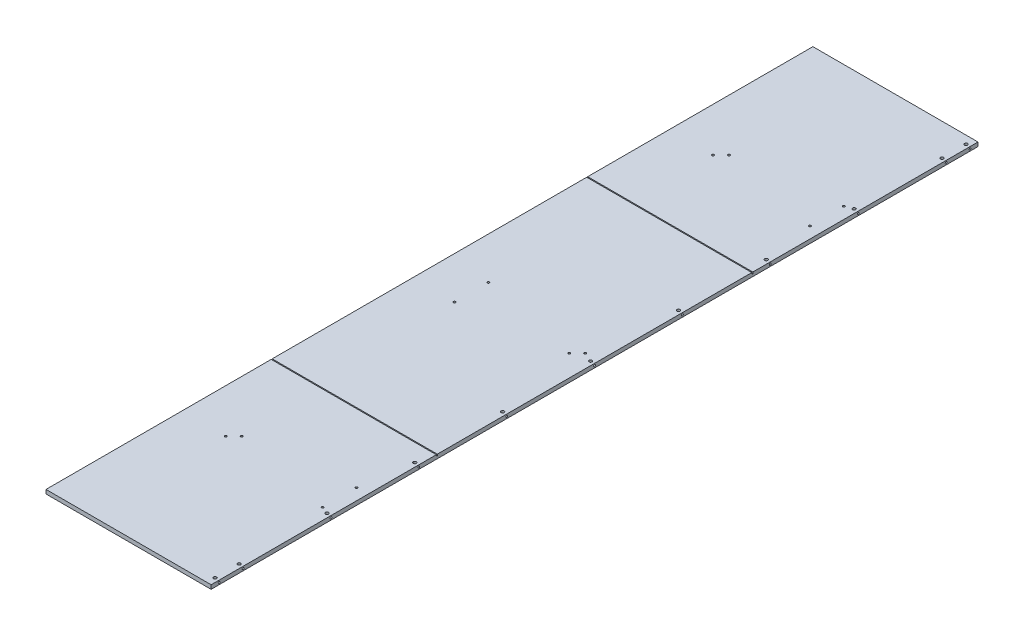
ISO-10303-21;
HEADER;
FILE_DESCRIPTION(('STEP AP214'),'2;1');
FILE_NAME('part.step','',(''),(''),'','','');
FILE_SCHEMA(('AUTOMOTIVE_DESIGN { 1 0 10303 214 1 1 1 1 }'));
ENDSEC;
DATA;
#1=APPLICATION_CONTEXT('core data for automotive mechanical design processes');
#2=APPLICATION_PROTOCOL_DEFINITION('international standard','automotive_design',2000,#1);
#3=PRODUCT_CONTEXT('',#1,'mechanical');
#4=PRODUCT('Part','Part','',(#3));
#5=PRODUCT_RELATED_PRODUCT_CATEGORY('part','',(#4));
#6=PRODUCT_DEFINITION_FORMATION('','',#4);
#7=PRODUCT_DEFINITION_CONTEXT('part definition',#1,'design');
#8=PRODUCT_DEFINITION('design','',#6,#7);
#9=PRODUCT_DEFINITION_SHAPE('','',#8);
#10=(LENGTH_UNIT() NAMED_UNIT(*) SI_UNIT(.MILLI.,.METRE.));
#11=(NAMED_UNIT(*) PLANE_ANGLE_UNIT() SI_UNIT($,.RADIAN.));
#12=(NAMED_UNIT(*) SI_UNIT($,.STERADIAN.) SOLID_ANGLE_UNIT());
#13=UNCERTAINTY_MEASURE_WITH_UNIT(LENGTH_MEASURE(1.E-05),#10,'distance_accuracy_value','');
#14=(GEOMETRIC_REPRESENTATION_CONTEXT(3) GLOBAL_UNCERTAINTY_ASSIGNED_CONTEXT((#13)) GLOBAL_UNIT_ASSIGNED_CONTEXT((#10,
#11,#12)) REPRESENTATION_CONTEXT('',''));
#15=CARTESIAN_POINT('',(0.,0.,0.));
#16=DIRECTION('',(0.,0.,1.));
#17=DIRECTION('',(1.,0.,0.));
#18=AXIS2_PLACEMENT_3D('',#15,#16,#17);
#19=CARTESIAN_POINT('',(-2.22044604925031E-13,12.7,-1731.899));
#20=DIRECTION('',(0.,1.,0.));
#21=DIRECTION('',(0.,0.,1.));
#22=AXIS2_PLACEMENT_3D('',#19,#20,#21);
#23=PLANE('',#22);
#24=CARTESIAN_POINT('',(512.29895,12.7000000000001,-233.299));
#25=DIRECTION('',(0.,1.,0.));
#26=DIRECTION('',(0.,0.,1.));
#27=AXIS2_PLACEMENT_3D('',#24,#25,#26);
#28=CIRCLE('',#27,4.90219999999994);
#29=CARTESIAN_POINT('',(512.29895,12.7000000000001,-228.3968));
#30=VERTEX_POINT('',#29);
#31=EDGE_CURVE('E426',#30,#30,#28,.T.);
#32=ORIENTED_EDGE('',*,*,#31,.F.);
#33=EDGE_LOOP('',(#32));
#34=FACE_BOUND('',#33,.T.);
#35=CARTESIAN_POINT('',(512.29895,12.7000000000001,-512.699));
#36=DIRECTION('',(0.,1.,0.));
#37=DIRECTION('',(0.,0.,1.));
#38=AXIS2_PLACEMENT_3D('',#35,#36,#37);
#39=CIRCLE('',#38,4.90219999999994);
#40=CARTESIAN_POINT('',(512.29895,12.7000000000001,-507.7968));
#41=VERTEX_POINT('',#40);
#42=EDGE_CURVE('E420',#41,#41,#39,.T.);
#43=ORIENTED_EDGE('',*,*,#42,.F.);
#44=EDGE_LOOP('',(#43));
#45=FACE_BOUND('',#44,.T.);
#46=CARTESIAN_POINT('',(512.29895,12.6999999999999,-792.099));
#47=DIRECTION('',(0.,1.,0.));
#48=DIRECTION('',(0.,0.,1.));
#49=AXIS2_PLACEMENT_3D('',#46,#47,#48);
#50=CIRCLE('',#49,4.90219999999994);
#51=CARTESIAN_POINT('',(512.29895,12.6999999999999,-787.1968));
#52=VERTEX_POINT('',#51);
#53=EDGE_CURVE('E414',#52,#52,#50,.T.);
#54=ORIENTED_EDGE('',*,*,#53,.F.);
#55=EDGE_LOOP('',(#54));
#56=FACE_BOUND('',#55,.T.);
#57=CARTESIAN_POINT('',(133.349999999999,12.7000000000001,-458.777436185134));
#58=DIRECTION('',(0.,-1.,0.));
#59=DIRECTION('',(0.,0.,-1.));
#60=AXIS2_PLACEMENT_3D('',#57,#58,#59);
#61=CIRCLE('',#60,3.37312000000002);
#62=CARTESIAN_POINT('',(133.349999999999,12.7000000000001,-462.150556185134));
#63=VERTEX_POINT('',#62);
#64=EDGE_CURVE('E387',#63,#63,#61,.T.);
#65=ORIENTED_EDGE('',*,*,#64,.T.);
#66=EDGE_LOOP('',(#65));
#67=FACE_BOUND('',#66,.T.);
#68=CARTESIAN_POINT('',(133.349999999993,12.6999999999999,-566.620563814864));
#69=DIRECTION('',(0.,-1.,0.));
#70=DIRECTION('',(0.,0.,-1.));
#71=AXIS2_PLACEMENT_3D('',#68,#69,#70);
#72=CIRCLE('',#71,3.37312000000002);
#73=CARTESIAN_POINT('',(133.349999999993,12.6999999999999,-569.993683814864));
#74=VERTEX_POINT('',#73);
#75=EDGE_CURVE('E382',#74,#74,#72,.T.);
#76=ORIENTED_EDGE('',*,*,#75,.T.);
#77=EDGE_LOOP('',(#76));
#78=FACE_BOUND('',#77,.T.);
#79=CARTESIAN_POINT('',(457.199999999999,12.7000000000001,-499.998999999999));
#80=DIRECTION('',(0.,-1.,0.));
#81=DIRECTION('',(0.,0.,-1.));
#82=AXIS2_PLACEMENT_3D('',#79,#80,#81);
#83=CIRCLE('',#82,3.37312);
#84=CARTESIAN_POINT('',(457.199999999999,12.7000000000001,-503.372119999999));
#85=VERTEX_POINT('',#84);
#86=EDGE_CURVE('E371',#85,#85,#83,.T.);
#87=ORIENTED_EDGE('',*,*,#86,.T.);
#88=EDGE_LOOP('',(#87));
#89=FACE_BOUND('',#88,.T.);
#90=CARTESIAN_POINT('',(482.599999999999,12.7000000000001,-525.398999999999));
#91=DIRECTION('',(0.,-1.,0.));
#92=DIRECTION('',(0.,0.,-1.));
#93=AXIS2_PLACEMENT_3D('',#90,#91,#92);
#94=CIRCLE('',#93,3.37312);
#95=CARTESIAN_POINT('',(482.599999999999,12.7000000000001,-528.772119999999));
#96=VERTEX_POINT('',#95);
#97=EDGE_CURVE('E341',#96,#96,#94,.T.);
#98=ORIENTED_EDGE('',*,*,#97,.T.);
#99=EDGE_LOOP('',(#98));
#100=FACE_BOUND('',#99,.T.);
#101=DIRECTION('',(1.,0.,0.));
#102=VECTOR('',#101,1.);
#103=CARTESIAN_POINT('',(-64.3156022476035,12.6999999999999,-1012.698));
#104=LINE('',#103,#102);
#105=CARTESIAN_POINT('',(0.,12.6999999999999,-1012.698));
#106=VERTEX_POINT('',#105);
#107=CARTESIAN_POINT('',(524.99895,12.6999999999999,-1012.698));
#108=VERTEX_POINT('',#107);
#109=EDGE_CURVE('E127',#106,#108,#104,.T.);
#110=ORIENTED_EDGE('',*,*,#109,.F.);
#111=DIRECTION('',(0.,0.,1.));
#112=VECTOR('',#111,1.);
#113=CARTESIAN_POINT('',(0.,12.6999999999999,0.));
#114=LINE('',#113,#112);
#115=CARTESIAN_POINT('',(0.,12.6999999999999,-12.7000000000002));
#116=VERTEX_POINT('',#115);
#117=EDGE_CURVE('E137',#106,#116,#114,.T.);
#118=ORIENTED_EDGE('',*,*,#117,.T.);
#119=DIRECTION('',(-1.,0.,0.));
#120=VECTOR('',#119,1.);
#121=CARTESIAN_POINT('',(-2.22044604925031E-13,12.6999999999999,-12.7000000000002));
#122=LINE('',#121,#120);
#123=CARTESIAN_POINT('',(524.99895,12.6999999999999,-12.6999999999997));
#124=VERTEX_POINT('',#123);
#125=EDGE_CURVE('E189',#124,#116,#122,.T.);
#126=ORIENTED_EDGE('',*,*,#125,.F.);
#127=DIRECTION('',(0.,0.,-1.));
#128=VECTOR('',#127,1.);
#129=CARTESIAN_POINT('',(524.99895,12.6999999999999,0.));
#130=LINE('',#129,#128);
#131=EDGE_CURVE('E140',#124,#108,#130,.T.);
#132=ORIENTED_EDGE('',*,*,#131,.T.);
#133=EDGE_LOOP('',(#110,#118,#126,#132));
#134=FACE_BOUND('',#133,.T.);
#135=ADVANCED_FACE('F30',(#34,#45,#56,#67,#78,#89,#100,#134),#23,.T.);
#136=CARTESIAN_POINT('',(512.29895,12.7000000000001,-1706.499));
#137=DIRECTION('',(0.,1.,0.));
#138=DIRECTION('',(0.,0.,1.));
#139=AXIS2_PLACEMENT_3D('',#136,#137,#138);
#140=CIRCLE('',#139,4.90219999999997);
#141=CARTESIAN_POINT('',(512.29895,12.7000000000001,-1701.5968));
#142=VERTEX_POINT('',#141);
#143=EDGE_CURVE('E204',#142,#142,#140,.T.);
#144=ORIENTED_EDGE('',*,*,#143,.F.);
#145=EDGE_LOOP('',(#144));
#146=FACE_BOUND('',#145,.T.);
#147=CARTESIAN_POINT('',(512.29895,12.7000000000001,-1071.499));
#148=DIRECTION('',(0.,1.,0.));
#149=DIRECTION('',(0.,0.,1.));
#150=AXIS2_PLACEMENT_3D('',#147,#148,#149);
#151=CIRCLE('',#150,4.90219999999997);
#152=CARTESIAN_POINT('',(512.29895,12.7000000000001,-1066.5968));
#153=VERTEX_POINT('',#152);
#154=EDGE_CURVE('E408',#153,#153,#151,.T.);
#155=ORIENTED_EDGE('',*,*,#154,.F.);
#156=EDGE_LOOP('',(#155));
#157=FACE_BOUND('',#156,.T.);
#158=CARTESIAN_POINT('',(512.29895,12.7000000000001,-1350.899));
#159=DIRECTION('',(0.,1.,0.));
#160=DIRECTION('',(0.,0.,1.));
#161=AXIS2_PLACEMENT_3D('',#158,#159,#160);
#162=CIRCLE('',#161,4.90219999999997);
#163=CARTESIAN_POINT('',(512.29895,12.7000000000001,-1345.9968));
#164=VERTEX_POINT('',#163);
#165=EDGE_CURVE('E402',#164,#164,#162,.T.);
#166=ORIENTED_EDGE('',*,*,#165,.F.);
#167=EDGE_LOOP('',(#166));
#168=FACE_BOUND('',#167,.T.);
#169=CARTESIAN_POINT('',(512.29895,12.6999999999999,-1630.299));
#170=DIRECTION('',(0.,1.,0.));
#171=DIRECTION('',(0.,0.,1.));
#172=AXIS2_PLACEMENT_3D('',#169,#170,#171);
#173=CIRCLE('',#172,4.90219999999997);
#174=CARTESIAN_POINT('',(512.29895,12.6999999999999,-1625.3968));
#175=VERTEX_POINT('',#174);
#176=EDGE_CURVE('E396',#175,#175,#173,.T.);
#177=ORIENTED_EDGE('',*,*,#176,.F.);
#178=EDGE_LOOP('',(#177));
#179=FACE_BOUND('',#178,.T.);
#180=CARTESIAN_POINT('',(139.699999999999,12.7000000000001,-1274.699));
#181=DIRECTION('',(0.,-1.,0.));
#182=DIRECTION('',(0.,0.,-1.));
#183=AXIS2_PLACEMENT_3D('',#180,#181,#182);
#184=CIRCLE('',#183,3.37311999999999);
#185=CARTESIAN_POINT('',(139.699999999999,12.7000000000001,-1278.07212));
#186=VERTEX_POINT('',#185);
#187=EDGE_CURVE('E365',#186,#186,#184,.T.);
#188=ORIENTED_EDGE('',*,*,#187,.T.);
#189=EDGE_LOOP('',(#188));
#190=FACE_BOUND('',#189,.T.);
#191=CARTESIAN_POINT('',(165.099999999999,12.7000000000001,-1300.099));
#192=DIRECTION('',(0.,-1.,0.));
#193=DIRECTION('',(0.,0.,-1.));
#194=AXIS2_PLACEMENT_3D('',#191,#192,#193);
#195=CIRCLE('',#194,3.37311999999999);
#196=CARTESIAN_POINT('',(165.099999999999,12.7000000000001,-1303.47212));
#197=VERTEX_POINT('',#196);
#198=EDGE_CURVE('E360',#197,#197,#195,.T.);
#199=ORIENTED_EDGE('',*,*,#198,.T.);
#200=EDGE_LOOP('',(#199));
#201=FACE_BOUND('',#200,.T.);
#202=CARTESIAN_POINT('',(488.950000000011,12.7000000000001,-1341.32056381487));
#203=DIRECTION('',(0.,-1.,0.));
#204=DIRECTION('',(0.,0.,-1.));
#205=AXIS2_PLACEMENT_3D('',#202,#203,#204);
#206=CIRCLE('',#205,3.37311999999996);
#207=CARTESIAN_POINT('',(488.950000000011,12.7000000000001,-1344.69368381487));
#208=VERTEX_POINT('',#207);
#209=EDGE_CURVE('E335',#208,#208,#206,.T.);
#210=ORIENTED_EDGE('',*,*,#209,.T.);
#211=EDGE_LOOP('',(#210));
#212=FACE_BOUND('',#211,.T.);
#213=CARTESIAN_POINT('',(488.950000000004,12.6999999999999,-1233.37056381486));
#214=DIRECTION('',(0.,-1.,0.));
#215=DIRECTION('',(0.,0.,-1.));
#216=AXIS2_PLACEMENT_3D('',#213,#214,#215);
#217=CIRCLE('',#216,3.37311999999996);
#218=CARTESIAN_POINT('',(488.950000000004,12.6999999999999,-1236.74368381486));
#219=VERTEX_POINT('',#218);
#220=EDGE_CURVE('E142',#219,#219,#217,.T.);
#221=ORIENTED_EDGE('',*,*,#220,.T.);
#222=EDGE_LOOP('',(#221));
#223=FACE_BOUND('',#222,.T.);
#224=DIRECTION('',(-1.,0.,0.));
#225=VECTOR('',#224,1.);
#226=CARTESIAN_POINT('',(-64.3156022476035,12.6999999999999,-1015.873));
#227=LINE('',#226,#225);
#228=CARTESIAN_POINT('',(524.99895,12.6999999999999,-1015.873));
#229=VERTEX_POINT('',#228);
#230=CARTESIAN_POINT('',(0.,12.6999999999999,-1015.873));
#231=VERTEX_POINT('',#230);
#232=EDGE_CURVE('E141',#229,#231,#227,.T.);
#233=ORIENTED_EDGE('',*,*,#232,.F.);
#234=CARTESIAN_POINT('',(524.99895,12.7000000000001,-1731.899));
#235=VERTEX_POINT('',#234);
#236=EDGE_CURVE('E159',#229,#235,#130,.T.);
#237=ORIENTED_EDGE('',*,*,#236,.T.);
#238=DIRECTION('',(-1.,0.,0.));
#239=VECTOR('',#238,1.);
#240=CARTESIAN_POINT('',(0.,12.7,-1731.899));
#241=LINE('',#240,#239);
#242=CARTESIAN_POINT('',(0.,12.7,-1731.899));
#243=VERTEX_POINT('',#242);
#244=EDGE_CURVE('E163',#235,#243,#241,.T.);
#245=ORIENTED_EDGE('',*,*,#244,.T.);
#246=EDGE_CURVE('E148',#243,#231,#114,.T.);
#247=ORIENTED_EDGE('',*,*,#246,.T.);
#248=EDGE_LOOP('',(#233,#237,#245,#247));
#249=FACE_BOUND('',#248,.T.);
#250=ADVANCED_FACE('F238',(#146,#157,#168,#179,#190,#201,#212,#223,#249),#23,.T.);
#251=CARTESIAN_POINT('',(1.11022302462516E-13,12.6999999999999,706.501));
#252=DIRECTION('',(0.,0.,-1.));
#253=DIRECTION('',(-1.,0.,0.));
#254=AXIS2_PLACEMENT_3D('',#251,#252,#253);
#255=PLANE('',#254);
#256=DIRECTION('',(1.,0.,0.));
#257=VECTOR('',#256,1.);
#258=CARTESIAN_POINT('',(1.11022302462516E-13,-1.11022302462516E-13,706.501));
#259=LINE('',#258,#257);
#260=CARTESIAN_POINT('',(1.11022302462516E-13,-1.11022302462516E-13,706.501));
#261=VERTEX_POINT('',#260);
#262=CARTESIAN_POINT('',(524.998950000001,0.,706.501));
#263=VERTEX_POINT('',#262);
#264=EDGE_CURVE('E167',#261,#263,#259,.T.);
#265=ORIENTED_EDGE('',*,*,#264,.T.);
#266=DIRECTION('',(0.,-1.,0.));
#267=VECTOR('',#266,1.);
#268=CARTESIAN_POINT('',(524.998950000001,12.7000000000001,706.501));
#269=LINE('',#268,#267);
#270=CARTESIAN_POINT('',(524.998950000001,12.7000000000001,706.501));
#271=VERTEX_POINT('',#270);
#272=EDGE_CURVE('E181',#271,#263,#269,.T.);
#273=ORIENTED_EDGE('',*,*,#272,.F.);
#274=DIRECTION('',(1.,0.,0.));
#275=VECTOR('',#274,1.);
#276=CARTESIAN_POINT('',(1.11022302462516E-13,12.6999999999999,706.501));
#277=LINE('',#276,#275);
#278=CARTESIAN_POINT('',(1.11022302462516E-13,12.6999999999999,706.501));
#279=VERTEX_POINT('',#278);
#280=EDGE_CURVE('E152',#279,#271,#277,.T.);
#281=ORIENTED_EDGE('',*,*,#280,.F.);
#282=DIRECTION('',(0.,-1.,0.));
#283=VECTOR('',#282,1.);
#284=CARTESIAN_POINT('',(1.11022302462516E-13,12.6999999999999,706.501));
#285=LINE('',#284,#283);
#286=EDGE_CURVE('E184',#279,#261,#285,.T.);
#287=ORIENTED_EDGE('',*,*,#286,.T.);
#288=EDGE_LOOP('',(#265,#273,#281,#287));
#289=FACE_BOUND('',#288,.T.);
#290=ADVANCED_FACE('F32',(#289),#255,.F.);
#291=CARTESIAN_POINT('',(524.998950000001,12.6999999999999,-1025.398));
#292=DIRECTION('',(-1.,0.,0.));
#293=DIRECTION('',(0.,0.,1.));
#294=AXIS2_PLACEMENT_3D('',#291,#292,#293);
#295=PLANE('',#294);
#296=CARTESIAN_POINT('',(524.99895,6.35000000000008,-1706.499));
#297=DIRECTION('',(1.,0.,0.));
#298=DIRECTION('',(0.,0.,-1.));
#299=AXIS2_PLACEMENT_3D('',#296,#297,#298);
#300=CIRCLE('',#299,2.80670000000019);
#301=CARTESIAN_POINT('',(524.99895,6.35000000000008,-1709.3057));
#302=VERTEX_POINT('',#301);
#303=EDGE_CURVE('E489',#302,#302,#300,.T.);
#304=ORIENTED_EDGE('',*,*,#303,.F.);
#305=EDGE_LOOP('',(#304));
#306=FACE_BOUND('',#305,.T.);
#307=CARTESIAN_POINT('',(524.99895,6.34999999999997,-1630.299));
#308=DIRECTION('',(1.,0.,0.));
#309=DIRECTION('',(0.,0.,-1.));
#310=AXIS2_PLACEMENT_3D('',#307,#308,#309);
#311=CIRCLE('',#310,2.80670000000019);
#312=CARTESIAN_POINT('',(524.99895,6.34999999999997,-1633.1057));
#313=VERTEX_POINT('',#312);
#314=EDGE_CURVE('E486',#313,#313,#311,.T.);
#315=ORIENTED_EDGE('',*,*,#314,.F.);
#316=EDGE_LOOP('',(#315));
#317=FACE_BOUND('',#316,.T.);
#318=CARTESIAN_POINT('',(524.99895,6.34999999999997,-1350.899));
#319=DIRECTION('',(1.,0.,0.));
#320=DIRECTION('',(0.,0.,-1.));
#321=AXIS2_PLACEMENT_3D('',#318,#319,#320);
#322=CIRCLE('',#321,2.80670000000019);
#323=CARTESIAN_POINT('',(524.99895,6.34999999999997,-1353.7057));
#324=VERTEX_POINT('',#323);
#325=EDGE_CURVE('E482',#324,#324,#322,.T.);
#326=ORIENTED_EDGE('',*,*,#325,.F.);
#327=EDGE_LOOP('',(#326));
#328=FACE_BOUND('',#327,.T.);
#329=CARTESIAN_POINT('',(524.998950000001,6.35000000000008,-1071.499));
#330=DIRECTION('',(1.,0.,0.));
#331=DIRECTION('',(0.,0.,-1.));
#332=AXIS2_PLACEMENT_3D('',#329,#330,#331);
#333=CIRCLE('',#332,2.80670000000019);
#334=CARTESIAN_POINT('',(524.998950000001,6.35000000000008,-1074.3057));
#335=VERTEX_POINT('',#334);
#336=EDGE_CURVE('E478',#335,#335,#333,.T.);
#337=ORIENTED_EDGE('',*,*,#336,.F.);
#338=EDGE_LOOP('',(#337));
#339=FACE_BOUND('',#338,.T.);
#340=CARTESIAN_POINT('',(524.99895,6.34999999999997,-792.099));
#341=DIRECTION('',(1.,0.,0.));
#342=DIRECTION('',(0.,0.,-1.));
#343=AXIS2_PLACEMENT_3D('',#340,#341,#342);
#344=CIRCLE('',#343,2.80670000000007);
#345=CARTESIAN_POINT('',(524.99895,6.34999999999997,-794.9057));
#346=VERTEX_POINT('',#345);
#347=EDGE_CURVE('E474',#346,#346,#344,.T.);
#348=ORIENTED_EDGE('',*,*,#347,.F.);
#349=EDGE_LOOP('',(#348));
#350=FACE_BOUND('',#349,.T.);
#351=CARTESIAN_POINT('',(524.99895,6.34999999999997,-512.699));
#352=DIRECTION('',(1.,0.,0.));
#353=DIRECTION('',(0.,0.,-1.));
#354=AXIS2_PLACEMENT_3D('',#351,#352,#353);
#355=CIRCLE('',#354,2.80670000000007);
#356=CARTESIAN_POINT('',(524.99895,6.34999999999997,-515.5057));
#357=VERTEX_POINT('',#356);
#358=EDGE_CURVE('E470',#357,#357,#355,.T.);
#359=ORIENTED_EDGE('',*,*,#358,.F.);
#360=EDGE_LOOP('',(#359));
#361=FACE_BOUND('',#360,.T.);
#362=CARTESIAN_POINT('',(524.998950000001,6.35000000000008,-233.299));
#363=DIRECTION('',(1.,0.,0.));
#364=DIRECTION('',(0.,0.,-1.));
#365=AXIS2_PLACEMENT_3D('',#362,#363,#364);
#366=CIRCLE('',#365,2.80670000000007);
#367=CARTESIAN_POINT('',(524.998950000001,6.35000000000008,-236.1057));
#368=VERTEX_POINT('',#367);
#369=EDGE_CURVE('E466',#368,#368,#366,.T.);
#370=ORIENTED_EDGE('',*,*,#369,.F.);
#371=EDGE_LOOP('',(#370));
#372=FACE_BOUND('',#371,.T.);
#373=CARTESIAN_POINT('',(524.99895,6.34999999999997,46.1010000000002));
#374=DIRECTION('',(1.,0.,0.));
#375=DIRECTION('',(0.,0.,-1.));
#376=AXIS2_PLACEMENT_3D('',#373,#374,#375);
#377=CIRCLE('',#376,2.80670000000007);
#378=CARTESIAN_POINT('',(524.99895,6.34999999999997,43.2943000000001));
#379=VERTEX_POINT('',#378);
#380=EDGE_CURVE('E462',#379,#379,#377,.T.);
#381=ORIENTED_EDGE('',*,*,#380,.F.);
#382=EDGE_LOOP('',(#381));
#383=FACE_BOUND('',#382,.T.);
#384=CARTESIAN_POINT('',(524.99895,6.34999999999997,325.501));
#385=DIRECTION('',(1.,0.,0.));
#386=DIRECTION('',(0.,0.,-1.));
#387=AXIS2_PLACEMENT_3D('',#384,#385,#386);
#388=CIRCLE('',#387,2.80670000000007);
#389=CARTESIAN_POINT('',(524.99895,6.34999999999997,322.6943));
#390=VERTEX_POINT('',#389);
#391=EDGE_CURVE('E458',#390,#390,#388,.T.);
#392=ORIENTED_EDGE('',*,*,#391,.F.);
#393=EDGE_LOOP('',(#392));
#394=FACE_BOUND('',#393,.T.);
#395=CARTESIAN_POINT('',(524.99895,6.34999999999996,604.901));
#396=DIRECTION('',(1.,0.,0.));
#397=DIRECTION('',(0.,0.,-1.));
#398=AXIS2_PLACEMENT_3D('',#395,#396,#397);
#399=CIRCLE('',#398,2.80670000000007);
#400=CARTESIAN_POINT('',(524.99895,6.34999999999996,602.0943));
#401=VERTEX_POINT('',#400);
#402=EDGE_CURVE('E454',#401,#401,#399,.T.);
#403=ORIENTED_EDGE('',*,*,#402,.F.);
#404=EDGE_LOOP('',(#403));
#405=FACE_BOUND('',#404,.T.);
#406=CARTESIAN_POINT('',(524.99895,6.34999999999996,681.101));
#407=DIRECTION('',(1.,0.,0.));
#408=DIRECTION('',(0.,0.,-1.));
#409=AXIS2_PLACEMENT_3D('',#406,#407,#408);
#410=CIRCLE('',#409,2.80670000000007);
#411=CARTESIAN_POINT('',(524.99895,6.34999999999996,678.2943));
#412=VERTEX_POINT('',#411);
#413=EDGE_CURVE('E205',#412,#412,#410,.T.);
#414=ORIENTED_EDGE('',*,*,#413,.F.);
#415=EDGE_LOOP('',(#414));
#416=FACE_BOUND('',#415,.T.);
#417=DIRECTION('',(0.,0.,-1.));
#418=VECTOR('',#417,1.);
#419=CARTESIAN_POINT('',(524.998950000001,7.93749999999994,-1025.398));
#420=LINE('',#419,#418);
#421=CARTESIAN_POINT('',(524.99895,7.93749999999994,-1012.698));
#422=VERTEX_POINT('',#421);
#423=CARTESIAN_POINT('',(524.99895,7.93749999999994,-1015.873));
#424=VERTEX_POINT('',#423);
#425=EDGE_CURVE('E327',#422,#424,#420,.T.);
#426=ORIENTED_EDGE('',*,*,#425,.F.);
#427=DIRECTION('',(0.,1.,0.));
#428=VECTOR('',#427,1.);
#429=CARTESIAN_POINT('',(524.998950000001,12.6999999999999,-1012.698));
#430=LINE('',#429,#428);
#431=EDGE_CURVE('E320',#422,#108,#430,.T.);
#432=ORIENTED_EDGE('',*,*,#431,.T.);
#433=ORIENTED_EDGE('',*,*,#131,.F.);
#434=DIRECTION('',(0.,-1.,0.));
#435=VECTOR('',#434,1.);
#436=CARTESIAN_POINT('',(524.99895,12.6999999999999,-12.6999999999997));
#437=LINE('',#436,#435);
#438=CARTESIAN_POINT('',(524.99895,7.93749999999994,-12.6999999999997));
#439=VERTEX_POINT('',#438);
#440=EDGE_CURVE('E309',#124,#439,#437,.T.);
#441=ORIENTED_EDGE('',*,*,#440,.T.);
#442=DIRECTION('',(0.,0.,-1.));
#443=VECTOR('',#442,1.);
#444=CARTESIAN_POINT('',(524.998950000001,7.93749999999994,-1025.398));
#445=LINE('',#444,#443);
#446=CARTESIAN_POINT('',(524.99895,7.93749999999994,-9.52500000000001));
#447=VERTEX_POINT('',#446);
#448=EDGE_CURVE('E156',#447,#439,#445,.T.);
#449=ORIENTED_EDGE('',*,*,#448,.F.);
#450=DIRECTION('',(0.,1.,0.));
#451=VECTOR('',#450,1.);
#452=CARTESIAN_POINT('',(524.99895,12.6999999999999,-9.52500000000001));
#453=LINE('',#452,#451);
#454=CARTESIAN_POINT('',(524.99895,12.6999999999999,-9.52500000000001));
#455=VERTEX_POINT('',#454);
#456=EDGE_CURVE('E305',#447,#455,#453,.T.);
#457=ORIENTED_EDGE('',*,*,#456,.T.);
#458=EDGE_CURVE('E160',#271,#455,#130,.T.);
#459=ORIENTED_EDGE('',*,*,#458,.F.);
#460=ORIENTED_EDGE('',*,*,#272,.T.);
#461=DIRECTION('',(0.,0.,-1.));
#462=VECTOR('',#461,1.);
#463=CARTESIAN_POINT('',(524.998950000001,0.,-1025.398));
#464=LINE('',#463,#462);
#465=CARTESIAN_POINT('',(524.99895,0.,-1731.899));
#466=VERTEX_POINT('',#465);
#467=EDGE_CURVE('E170',#263,#466,#464,.T.);
#468=ORIENTED_EDGE('',*,*,#467,.T.);
#469=DIRECTION('',(0.,-1.,0.));
#470=VECTOR('',#469,1.);
#471=CARTESIAN_POINT('',(524.99895,12.7000000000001,-1731.899));
#472=LINE('',#471,#470);
#473=EDGE_CURVE('E178',#235,#466,#472,.T.);
#474=ORIENTED_EDGE('',*,*,#473,.F.);
#475=ORIENTED_EDGE('',*,*,#236,.F.);
#476=DIRECTION('',(0.,-1.,0.));
#477=VECTOR('',#476,1.);
#478=CARTESIAN_POINT('',(524.998950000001,12.6999999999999,-1015.873));
#479=LINE('',#478,#477);
#480=EDGE_CURVE('E324',#229,#424,#479,.T.);
#481=ORIENTED_EDGE('',*,*,#480,.T.);
#482=EDGE_LOOP('',(#426,#432,#433,#441,#449,#457,#459,#460,#468,#474,#475,#481));
#483=FACE_BOUND('',#482,.T.);
#484=ADVANCED_FACE('F303',(#306,#317,#328,#339,#350,#361,#372,#383,#394,#405,#416,#483),#295,.F.);
#485=CARTESIAN_POINT('',(0.,12.7,-1731.899));
#486=DIRECTION('',(0.,0.,1.));
#487=DIRECTION('',(1.,0.,0.));
#488=AXIS2_PLACEMENT_3D('',#485,#486,#487);
#489=PLANE('',#488);
#490=DIRECTION('',(-1.,0.,0.));
#491=VECTOR('',#490,1.);
#492=CARTESIAN_POINT('',(0.,0.,-1731.899));
#493=LINE('',#492,#491);
#494=CARTESIAN_POINT('',(0.,0.,-1731.899));
#495=VERTEX_POINT('',#494);
#496=EDGE_CURVE('E172',#466,#495,#493,.T.);
#497=ORIENTED_EDGE('',*,*,#496,.T.);
#498=DIRECTION('',(0.,-1.,0.));
#499=VECTOR('',#498,1.);
#500=CARTESIAN_POINT('',(0.,12.7,-1731.899));
#501=LINE('',#500,#499);
#502=EDGE_CURVE('E166',#243,#495,#501,.T.);
#503=ORIENTED_EDGE('',*,*,#502,.F.);
#504=ORIENTED_EDGE('',*,*,#244,.F.);
#505=ORIENTED_EDGE('',*,*,#473,.T.);
#506=EDGE_LOOP('',(#497,#503,#504,#505));
#507=FACE_BOUND('',#506,.T.);
#508=ADVANCED_FACE('F259',(#507),#489,.F.);
#509=CARTESIAN_POINT('',(0.,12.6999999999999,0.));
#510=DIRECTION('',(1.,0.,0.));
#511=DIRECTION('',(0.,0.,-1.));
#512=AXIS2_PLACEMENT_3D('',#509,#510,#511);
#513=PLANE('',#512);
#514=ORIENTED_EDGE('',*,*,#117,.F.);
#515=DIRECTION('',(0.,-1.,0.));
#516=VECTOR('',#515,1.);
#517=CARTESIAN_POINT('',(0.,12.6999999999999,-1012.698));
#518=LINE('',#517,#516);
#519=CARTESIAN_POINT('',(0.,7.93749999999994,-1012.698));
#520=VERTEX_POINT('',#519);
#521=EDGE_CURVE('E11',#106,#520,#518,.T.);
#522=ORIENTED_EDGE('',*,*,#521,.T.);
#523=DIRECTION('',(0.,0.,1.));
#524=VECTOR('',#523,1.);
#525=CARTESIAN_POINT('',(0.,7.93749999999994,0.));
#526=LINE('',#525,#524);
#527=CARTESIAN_POINT('',(0.,7.93749999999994,-1015.873));
#528=VERTEX_POINT('',#527);
#529=EDGE_CURVE('E193',#528,#520,#526,.T.);
#530=ORIENTED_EDGE('',*,*,#529,.F.);
#531=DIRECTION('',(0.,1.,0.));
#532=VECTOR('',#531,1.);
#533=CARTESIAN_POINT('',(0.,12.6999999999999,-1015.873));
#534=LINE('',#533,#532);
#535=EDGE_CURVE('E43',#528,#231,#534,.T.);
#536=ORIENTED_EDGE('',*,*,#535,.T.);
#537=ORIENTED_EDGE('',*,*,#246,.F.);
#538=ORIENTED_EDGE('',*,*,#502,.T.);
#539=DIRECTION('',(0.,0.,1.));
#540=VECTOR('',#539,1.);
#541=CARTESIAN_POINT('',(0.,-1.11022302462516E-13,0.));
#542=LINE('',#541,#540);
#543=EDGE_CURVE('E153',#495,#261,#542,.T.);
#544=ORIENTED_EDGE('',*,*,#543,.T.);
#545=ORIENTED_EDGE('',*,*,#286,.F.);
#546=CARTESIAN_POINT('',(0.,12.6999999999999,-9.52500000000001));
#547=VERTEX_POINT('',#546);
#548=EDGE_CURVE('E149',#547,#279,#114,.T.);
#549=ORIENTED_EDGE('',*,*,#548,.F.);
#550=DIRECTION('',(0.,-1.,0.));
#551=VECTOR('',#550,1.);
#552=CARTESIAN_POINT('',(0.,12.6999999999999,-9.52500000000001));
#553=LINE('',#552,#551);
#554=CARTESIAN_POINT('',(0.,7.93749999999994,-9.52500000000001));
#555=VERTEX_POINT('',#554);
#556=EDGE_CURVE('E59',#547,#555,#553,.T.);
#557=ORIENTED_EDGE('',*,*,#556,.T.);
#558=DIRECTION('',(0.,0.,1.));
#559=VECTOR('',#558,1.);
#560=CARTESIAN_POINT('',(0.,7.93749999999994,0.));
#561=LINE('',#560,#559);
#562=CARTESIAN_POINT('',(0.,7.93749999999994,-12.7000000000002));
#563=VERTEX_POINT('',#562);
#564=EDGE_CURVE('E191',#563,#555,#561,.T.);
#565=ORIENTED_EDGE('',*,*,#564,.F.);
#566=DIRECTION('',(0.,1.,0.));
#567=VECTOR('',#566,1.);
#568=CARTESIAN_POINT('',(0.,12.6999999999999,-12.7000000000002));
#569=LINE('',#568,#567);
#570=EDGE_CURVE('E147',#563,#116,#569,.T.);
#571=ORIENTED_EDGE('',*,*,#570,.T.);
#572=EDGE_LOOP('',(#514,#522,#530,#536,#537,#538,#544,#545,#549,#557,#565,#571));
#573=FACE_BOUND('',#572,.T.);
#574=ADVANCED_FACE('F145',(#573),#513,.F.);
#575=CARTESIAN_POINT('',(512.29895,12.6999999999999,604.901));
#576=DIRECTION('',(0.,1.,0.));
#577=DIRECTION('',(0.,0.,1.));
#578=AXIS2_PLACEMENT_3D('',#575,#576,#577);
#579=CIRCLE('',#578,4.90219999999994);
#580=CARTESIAN_POINT('',(512.29895,12.6999999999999,609.8032));
#581=VERTEX_POINT('',#580);
#582=EDGE_CURVE('E264',#581,#581,#579,.T.);
#583=ORIENTED_EDGE('',*,*,#582,.F.);
#584=EDGE_LOOP('',(#583));
#585=FACE_BOUND('',#584,.T.);
#586=CARTESIAN_POINT('',(512.298950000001,12.7000000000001,681.101));
#587=DIRECTION('',(0.,1.,0.));
#588=DIRECTION('',(0.,0.,1.));
#589=AXIS2_PLACEMENT_3D('',#586,#587,#588);
#590=CIRCLE('',#589,4.90219999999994);
#591=CARTESIAN_POINT('',(512.298950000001,12.7000000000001,686.0032));
#592=VERTEX_POINT('',#591);
#593=EDGE_CURVE('E268',#592,#592,#590,.T.);
#594=ORIENTED_EDGE('',*,*,#593,.F.);
#595=EDGE_LOOP('',(#594));
#596=FACE_BOUND('',#595,.T.);
#597=CARTESIAN_POINT('',(512.29895,12.7000000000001,325.501));
#598=DIRECTION('',(0.,1.,0.));
#599=DIRECTION('',(0.,0.,1.));
#600=AXIS2_PLACEMENT_3D('',#597,#598,#599);
#601=CIRCLE('',#600,4.90219999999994);
#602=CARTESIAN_POINT('',(512.29895,12.7000000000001,330.4032));
#603=VERTEX_POINT('',#602);
#604=EDGE_CURVE('E272',#603,#603,#601,.T.);
#605=ORIENTED_EDGE('',*,*,#604,.F.);
#606=EDGE_LOOP('',(#605));
#607=FACE_BOUND('',#606,.T.);
#608=CARTESIAN_POINT('',(512.29895,12.6999999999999,46.1010000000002));
#609=DIRECTION('',(0.,1.,0.));
#610=DIRECTION('',(0.,0.,1.));
#611=AXIS2_PLACEMENT_3D('',#608,#609,#610);
#612=CIRCLE('',#611,4.90219999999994);
#613=CARTESIAN_POINT('',(512.29895,12.6999999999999,51.0032000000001));
#614=VERTEX_POINT('',#613);
#615=EDGE_CURVE('E276',#614,#614,#612,.T.);
#616=ORIENTED_EDGE('',*,*,#615,.F.);
#617=EDGE_LOOP('',(#616));
#618=FACE_BOUND('',#617,.T.);
#619=CARTESIAN_POINT('',(139.699999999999,12.6999999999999,274.700999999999));
#620=DIRECTION('',(0.,-1.,0.));
#621=DIRECTION('',(0.,0.,-1.));
#622=AXIS2_PLACEMENT_3D('',#619,#620,#621);
#623=CIRCLE('',#622,3.37312000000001);
#624=CARTESIAN_POINT('',(139.699999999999,12.6999999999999,271.327879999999));
#625=VERTEX_POINT('',#624);
#626=EDGE_CURVE('E280',#625,#625,#623,.T.);
#627=ORIENTED_EDGE('',*,*,#626,.T.);
#628=EDGE_LOOP('',(#627));
#629=FACE_BOUND('',#628,.T.);
#630=CARTESIAN_POINT('',(165.099999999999,12.6999999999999,249.300999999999));
#631=DIRECTION('',(0.,-1.,0.));
#632=DIRECTION('',(0.,0.,-1.));
#633=AXIS2_PLACEMENT_3D('',#630,#631,#632);
#634=CIRCLE('',#633,3.37312000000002);
#635=CARTESIAN_POINT('',(165.099999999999,12.6999999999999,245.927879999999));
#636=VERTEX_POINT('',#635);
#637=EDGE_CURVE('E284',#636,#636,#634,.T.);
#638=ORIENTED_EDGE('',*,*,#637,.T.);
#639=EDGE_LOOP('',(#638));
#640=FACE_BOUND('',#639,.T.);
#641=CARTESIAN_POINT('',(488.950000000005,12.6999999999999,208.079436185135));
#642=DIRECTION('',(0.,-1.,0.));
#643=DIRECTION('',(0.,0.,-1.));
#644=AXIS2_PLACEMENT_3D('',#641,#642,#643);
#645=CIRCLE('',#644,3.37311999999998);
#646=CARTESIAN_POINT('',(488.950000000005,12.6999999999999,204.706316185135));
#647=VERTEX_POINT('',#646);
#648=EDGE_CURVE('E288',#647,#647,#645,.T.);
#649=ORIENTED_EDGE('',*,*,#648,.T.);
#650=EDGE_LOOP('',(#649));
#651=FACE_BOUND('',#650,.T.);
#652=CARTESIAN_POINT('',(488.950000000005,12.7000000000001,316.029436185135));
#653=DIRECTION('',(0.,-1.,0.));
#654=DIRECTION('',(0.,0.,-1.));
#655=AXIS2_PLACEMENT_3D('',#652,#653,#654);
#656=CIRCLE('',#655,3.37311999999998);
#657=CARTESIAN_POINT('',(488.950000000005,12.7000000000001,312.656316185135));
#658=VERTEX_POINT('',#657);
#659=EDGE_CURVE('E292',#658,#658,#656,.T.);
#660=ORIENTED_EDGE('',*,*,#659,.T.);
#661=EDGE_LOOP('',(#660));
#662=FACE_BOUND('',#661,.T.);
#663=DIRECTION('',(1.,0.,0.));
#664=VECTOR('',#663,1.);
#665=CARTESIAN_POINT('',(-2.22044604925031E-13,12.6999999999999,-9.52500000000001));
#666=LINE('',#665,#664);
#667=EDGE_CURVE('E187',#547,#455,#666,.T.);
#668=ORIENTED_EDGE('',*,*,#667,.F.);
#669=ORIENTED_EDGE('',*,*,#548,.T.);
#670=ORIENTED_EDGE('',*,*,#280,.T.);
#671=ORIENTED_EDGE('',*,*,#458,.T.);
#672=EDGE_LOOP('',(#668,#669,#670,#671));
#673=FACE_BOUND('',#672,.T.);
#674=ADVANCED_FACE('F241',(#585,#596,#607,#618,#629,#640,#651,#662,#673),#23,.T.);
#675=CARTESIAN_POINT('',(-2.22044604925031E-13,0.,-1731.899));
#676=DIRECTION('',(0.,1.,0.));
#677=DIRECTION('',(0.,0.,1.));
#678=AXIS2_PLACEMENT_3D('',#675,#676,#677);
#679=PLANE('',#678);
#680=CARTESIAN_POINT('',(512.29895,0.,-1706.499));
#681=DIRECTION('',(0.,1.,0.));
#682=DIRECTION('',(0.,0.,1.));
#683=AXIS2_PLACEMENT_3D('',#680,#681,#682);
#684=CIRCLE('',#683,4.90219999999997);
#685=CARTESIAN_POINT('',(512.29895,0.,-1701.5968));
#686=VERTEX_POINT('',#685);
#687=EDGE_CURVE('E445',#686,#686,#684,.T.);
#688=ORIENTED_EDGE('',*,*,#687,.T.);
#689=EDGE_LOOP('',(#688));
#690=FACE_BOUND('',#689,.T.);
#691=CARTESIAN_POINT('',(512.29895,0.,604.901));
#692=DIRECTION('',(0.,1.,0.));
#693=DIRECTION('',(0.,0.,1.));
#694=AXIS2_PLACEMENT_3D('',#691,#692,#693);
#695=CIRCLE('',#694,4.90219999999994);
#696=CARTESIAN_POINT('',(512.29895,0.,609.8032));
#697=VERTEX_POINT('',#696);
#698=EDGE_CURVE('E441',#697,#697,#695,.T.);
#699=ORIENTED_EDGE('',*,*,#698,.T.);
#700=EDGE_LOOP('',(#699));
#701=FACE_BOUND('',#700,.T.);
#702=CARTESIAN_POINT('',(512.298950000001,0.,681.101));
#703=DIRECTION('',(0.,1.,0.));
#704=DIRECTION('',(0.,0.,1.));
#705=AXIS2_PLACEMENT_3D('',#702,#703,#704);
#706=CIRCLE('',#705,4.90219999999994);
#707=CARTESIAN_POINT('',(512.298950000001,0.,686.0032));
#708=VERTEX_POINT('',#707);
#709=EDGE_CURVE('E437',#708,#708,#706,.T.);
#710=ORIENTED_EDGE('',*,*,#709,.T.);
#711=EDGE_LOOP('',(#710));
#712=FACE_BOUND('',#711,.T.);
#713=CARTESIAN_POINT('',(512.29895,0.,325.501));
#714=DIRECTION('',(0.,1.,0.));
#715=DIRECTION('',(0.,0.,1.));
#716=AXIS2_PLACEMENT_3D('',#713,#714,#715);
#717=CIRCLE('',#716,4.90219999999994);
#718=CARTESIAN_POINT('',(512.29895,0.,330.4032));
#719=VERTEX_POINT('',#718);
#720=EDGE_CURVE('E433',#719,#719,#717,.T.);
#721=ORIENTED_EDGE('',*,*,#720,.T.);
#722=EDGE_LOOP('',(#721));
#723=FACE_BOUND('',#722,.T.);
#724=CARTESIAN_POINT('',(512.29895,0.,46.1010000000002));
#725=DIRECTION('',(0.,1.,0.));
#726=DIRECTION('',(0.,0.,1.));
#727=AXIS2_PLACEMENT_3D('',#724,#725,#726);
#728=CIRCLE('',#727,4.90219999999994);
#729=CARTESIAN_POINT('',(512.29895,0.,51.0032000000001));
#730=VERTEX_POINT('',#729);
#731=EDGE_CURVE('E429',#730,#730,#728,.T.);
#732=ORIENTED_EDGE('',*,*,#731,.T.);
#733=EDGE_LOOP('',(#732));
#734=FACE_BOUND('',#733,.T.);
#735=CARTESIAN_POINT('',(512.29895,0.,-233.299));
#736=DIRECTION('',(0.,1.,0.));
#737=DIRECTION('',(0.,0.,1.));
#738=AXIS2_PLACEMENT_3D('',#735,#736,#737);
#739=CIRCLE('',#738,4.90219999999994);
#740=CARTESIAN_POINT('',(512.29895,0.,-228.3968));
#741=VERTEX_POINT('',#740);
#742=EDGE_CURVE('E423',#741,#741,#739,.T.);
#743=ORIENTED_EDGE('',*,*,#742,.T.);
#744=EDGE_LOOP('',(#743));
#745=FACE_BOUND('',#744,.T.);
#746=CARTESIAN_POINT('',(512.29895,0.,-512.699));
#747=DIRECTION('',(0.,1.,0.));
#748=DIRECTION('',(0.,0.,1.));
#749=AXIS2_PLACEMENT_3D('',#746,#747,#748);
#750=CIRCLE('',#749,4.90219999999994);
#751=CARTESIAN_POINT('',(512.29895,0.,-507.7968));
#752=VERTEX_POINT('',#751);
#753=EDGE_CURVE('E417',#752,#752,#750,.T.);
#754=ORIENTED_EDGE('',*,*,#753,.T.);
#755=EDGE_LOOP('',(#754));
#756=FACE_BOUND('',#755,.T.);
#757=CARTESIAN_POINT('',(512.29895,0.,-792.099));
#758=DIRECTION('',(0.,1.,0.));
#759=DIRECTION('',(0.,0.,1.));
#760=AXIS2_PLACEMENT_3D('',#757,#758,#759);
#761=CIRCLE('',#760,4.90219999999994);
#762=CARTESIAN_POINT('',(512.29895,0.,-787.1968));
#763=VERTEX_POINT('',#762);
#764=EDGE_CURVE('E411',#763,#763,#761,.T.);
#765=ORIENTED_EDGE('',*,*,#764,.T.);
#766=EDGE_LOOP('',(#765));
#767=FACE_BOUND('',#766,.T.);
#768=CARTESIAN_POINT('',(512.29895,0.,-1071.499));
#769=DIRECTION('',(0.,1.,0.));
#770=DIRECTION('',(0.,0.,1.));
#771=AXIS2_PLACEMENT_3D('',#768,#769,#770);
#772=CIRCLE('',#771,4.90219999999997);
#773=CARTESIAN_POINT('',(512.29895,0.,-1066.5968));
#774=VERTEX_POINT('',#773);
#775=EDGE_CURVE('E405',#774,#774,#772,.T.);
#776=ORIENTED_EDGE('',*,*,#775,.T.);
#777=EDGE_LOOP('',(#776));
#778=FACE_BOUND('',#777,.T.);
#779=CARTESIAN_POINT('',(512.29895,0.,-1350.899));
#780=DIRECTION('',(0.,1.,0.));
#781=DIRECTION('',(0.,0.,1.));
#782=AXIS2_PLACEMENT_3D('',#779,#780,#781);
#783=CIRCLE('',#782,4.90219999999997);
#784=CARTESIAN_POINT('',(512.29895,0.,-1345.9968));
#785=VERTEX_POINT('',#784);
#786=EDGE_CURVE('E399',#785,#785,#783,.T.);
#787=ORIENTED_EDGE('',*,*,#786,.T.);
#788=EDGE_LOOP('',(#787));
#789=FACE_BOUND('',#788,.T.);
#790=CARTESIAN_POINT('',(512.29895,0.,-1630.299));
#791=DIRECTION('',(0.,1.,0.));
#792=DIRECTION('',(0.,0.,1.));
#793=AXIS2_PLACEMENT_3D('',#790,#791,#792);
#794=CIRCLE('',#793,4.90219999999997);
#795=CARTESIAN_POINT('',(512.29895,0.,-1625.3968));
#796=VERTEX_POINT('',#795);
#797=EDGE_CURVE('E393',#796,#796,#794,.T.);
#798=ORIENTED_EDGE('',*,*,#797,.T.);
#799=EDGE_LOOP('',(#798));
#800=FACE_BOUND('',#799,.T.);
#801=CARTESIAN_POINT('',(133.349999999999,0.,-458.777436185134));
#802=DIRECTION('',(0.,-1.,0.));
#803=DIRECTION('',(0.,0.,-1.));
#804=AXIS2_PLACEMENT_3D('',#801,#802,#803);
#805=CIRCLE('',#804,3.37312000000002);
#806=CARTESIAN_POINT('',(133.349999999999,0.,-462.150556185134));
#807=VERTEX_POINT('',#806);
#808=EDGE_CURVE('E390',#807,#807,#805,.T.);
#809=ORIENTED_EDGE('',*,*,#808,.F.);
#810=EDGE_LOOP('',(#809));
#811=FACE_BOUND('',#810,.T.);
#812=CARTESIAN_POINT('',(133.349999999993,0.,-566.620563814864));
#813=DIRECTION('',(0.,-1.,0.));
#814=DIRECTION('',(0.,0.,-1.));
#815=AXIS2_PLACEMENT_3D('',#812,#813,#814);
#816=CIRCLE('',#815,3.37312000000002);
#817=CARTESIAN_POINT('',(133.349999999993,0.,-569.993683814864));
#818=VERTEX_POINT('',#817);
#819=EDGE_CURVE('E384',#818,#818,#816,.T.);
#820=ORIENTED_EDGE('',*,*,#819,.F.);
#821=EDGE_LOOP('',(#820));
#822=FACE_BOUND('',#821,.T.);
#823=CARTESIAN_POINT('',(139.699999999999,0.,274.700999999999));
#824=DIRECTION('',(0.,-1.,0.));
#825=DIRECTION('',(0.,0.,-1.));
#826=AXIS2_PLACEMENT_3D('',#823,#824,#825);
#827=CIRCLE('',#826,3.37312000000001);
#828=CARTESIAN_POINT('',(139.699999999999,0.,271.327879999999));
#829=VERTEX_POINT('',#828);
#830=EDGE_CURVE('E379',#829,#829,#827,.T.);
#831=ORIENTED_EDGE('',*,*,#830,.F.);
#832=EDGE_LOOP('',(#831));
#833=FACE_BOUND('',#832,.T.);
#834=CARTESIAN_POINT('',(457.199999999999,0.,-499.998999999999));
#835=DIRECTION('',(0.,-1.,0.));
#836=DIRECTION('',(0.,0.,-1.));
#837=AXIS2_PLACEMENT_3D('',#834,#835,#836);
#838=CIRCLE('',#837,3.37312);
#839=CARTESIAN_POINT('',(457.199999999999,0.,-503.372119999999));
#840=VERTEX_POINT('',#839);
#841=EDGE_CURVE('E374',#840,#840,#838,.T.);
#842=ORIENTED_EDGE('',*,*,#841,.F.);
#843=EDGE_LOOP('',(#842));
#844=FACE_BOUND('',#843,.T.);
#845=CARTESIAN_POINT('',(139.699999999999,0.,-1274.699));
#846=DIRECTION('',(0.,-1.,0.));
#847=DIRECTION('',(0.,0.,-1.));
#848=AXIS2_PLACEMENT_3D('',#845,#846,#847);
#849=CIRCLE('',#848,3.37311999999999);
#850=CARTESIAN_POINT('',(139.699999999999,0.,-1278.07212));
#851=VERTEX_POINT('',#850);
#852=EDGE_CURVE('E368',#851,#851,#849,.T.);
#853=ORIENTED_EDGE('',*,*,#852,.F.);
#854=EDGE_LOOP('',(#853));
#855=FACE_BOUND('',#854,.T.);
#856=CARTESIAN_POINT('',(165.099999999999,0.,-1300.099));
#857=DIRECTION('',(0.,-1.,0.));
#858=DIRECTION('',(0.,0.,-1.));
#859=AXIS2_PLACEMENT_3D('',#856,#857,#858);
#860=CIRCLE('',#859,3.37311999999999);
#861=CARTESIAN_POINT('',(165.099999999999,0.,-1303.47212));
#862=VERTEX_POINT('',#861);
#863=EDGE_CURVE('E362',#862,#862,#860,.T.);
#864=ORIENTED_EDGE('',*,*,#863,.F.);
#865=EDGE_LOOP('',(#864));
#866=FACE_BOUND('',#865,.T.);
#867=CARTESIAN_POINT('',(165.099999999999,0.,249.300999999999));
#868=DIRECTION('',(0.,-1.,0.));
#869=DIRECTION('',(0.,0.,-1.));
#870=AXIS2_PLACEMENT_3D('',#867,#868,#869);
#871=CIRCLE('',#870,3.37312000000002);
#872=CARTESIAN_POINT('',(165.099999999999,0.,245.927879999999));
#873=VERTEX_POINT('',#872);
#874=EDGE_CURVE('E357',#873,#873,#871,.T.);
#875=ORIENTED_EDGE('',*,*,#874,.F.);
#876=EDGE_LOOP('',(#875));
#877=FACE_BOUND('',#876,.T.);
#878=CARTESIAN_POINT('',(488.950000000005,0.,208.079436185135));
#879=DIRECTION('',(0.,-1.,0.));
#880=DIRECTION('',(0.,0.,-1.));
#881=AXIS2_PLACEMENT_3D('',#878,#879,#880);
#882=CIRCLE('',#881,3.37311999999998);
#883=CARTESIAN_POINT('',(488.950000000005,0.,204.706316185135));
#884=VERTEX_POINT('',#883);
#885=EDGE_CURVE('E353',#884,#884,#882,.T.);
#886=ORIENTED_EDGE('',*,*,#885,.F.);
#887=EDGE_LOOP('',(#886));
#888=FACE_BOUND('',#887,.T.);
#889=CARTESIAN_POINT('',(488.950000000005,0.,316.029436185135));
#890=DIRECTION('',(0.,-1.,0.));
#891=DIRECTION('',(0.,0.,-1.));
#892=AXIS2_PLACEMENT_3D('',#889,#890,#891);
#893=CIRCLE('',#892,3.37311999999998);
#894=CARTESIAN_POINT('',(488.950000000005,0.,312.656316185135));
#895=VERTEX_POINT('',#894);
#896=EDGE_CURVE('E349',#895,#895,#893,.T.);
#897=ORIENTED_EDGE('',*,*,#896,.F.);
#898=EDGE_LOOP('',(#897));
#899=FACE_BOUND('',#898,.T.);
#900=CARTESIAN_POINT('',(482.599999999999,0.,-525.398999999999));
#901=DIRECTION('',(0.,-1.,0.));
#902=DIRECTION('',(0.,0.,-1.));
#903=AXIS2_PLACEMENT_3D('',#900,#901,#902);
#904=CIRCLE('',#903,3.37312);
#905=CARTESIAN_POINT('',(482.599999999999,0.,-528.772119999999));
#906=VERTEX_POINT('',#905);
#907=EDGE_CURVE('E344',#906,#906,#904,.T.);
#908=ORIENTED_EDGE('',*,*,#907,.F.);
#909=EDGE_LOOP('',(#908));
#910=FACE_BOUND('',#909,.T.);
#911=CARTESIAN_POINT('',(488.950000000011,0.,-1341.32056381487));
#912=DIRECTION('',(0.,-1.,0.));
#913=DIRECTION('',(0.,0.,-1.));
#914=AXIS2_PLACEMENT_3D('',#911,#912,#913);
#915=CIRCLE('',#914,3.37311999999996);
#916=CARTESIAN_POINT('',(488.950000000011,0.,-1344.69368381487));
#917=VERTEX_POINT('',#916);
#918=EDGE_CURVE('E338',#917,#917,#915,.T.);
#919=ORIENTED_EDGE('',*,*,#918,.F.);
#920=EDGE_LOOP('',(#919));
#921=FACE_BOUND('',#920,.T.);
#922=CARTESIAN_POINT('',(488.950000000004,-1.11022302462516E-13,-1233.37056381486));
#923=DIRECTION('',(0.,-1.,0.));
#924=DIRECTION('',(0.,0.,-1.));
#925=AXIS2_PLACEMENT_3D('',#922,#923,#924);
#926=CIRCLE('',#925,3.37311999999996);
#927=CARTESIAN_POINT('',(488.950000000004,-1.11002294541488E-13,-1236.74368381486));
#928=VERTEX_POINT('',#927);
#929=EDGE_CURVE('E332',#928,#928,#926,.T.);
#930=ORIENTED_EDGE('',*,*,#929,.F.);
#931=EDGE_LOOP('',(#930));
#932=FACE_BOUND('',#931,.T.);
#933=ORIENTED_EDGE('',*,*,#264,.F.);
#934=ORIENTED_EDGE('',*,*,#543,.F.);
#935=ORIENTED_EDGE('',*,*,#496,.F.);
#936=ORIENTED_EDGE('',*,*,#467,.F.);
#937=EDGE_LOOP('',(#933,#934,#935,#936));
#938=FACE_BOUND('',#937,.T.);
#939=ADVANCED_FACE('F251',(#690,#701,#712,#723,#734,#745,#756,#767,#778,#789,#800,#811,#822,
#833,#844,#855,#866,#877,#888,#899,#910,#921,#932,#938),#679,.F.);
#940=CARTESIAN_POINT('',(-64.3156022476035,7.93749999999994,-9.52500000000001));
#941=DIRECTION('',(0.,1.,0.));
#942=DIRECTION('',(0.,0.,1.));
#943=AXIS2_PLACEMENT_3D('',#940,#941,#942);
#944=PLANE('',#943);
#945=ORIENTED_EDGE('',*,*,#448,.T.);
#946=DIRECTION('',(-1.,0.,0.));
#947=VECTOR('',#946,1.);
#948=CARTESIAN_POINT('',(-64.3156022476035,7.93749999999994,-12.7000000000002));
#949=LINE('',#948,#947);
#950=EDGE_CURVE('E311',#439,#563,#949,.T.);
#951=ORIENTED_EDGE('',*,*,#950,.T.);
#952=ORIENTED_EDGE('',*,*,#564,.T.);
#953=DIRECTION('',(1.,0.,0.));
#954=VECTOR('',#953,1.);
#955=CARTESIAN_POINT('',(-64.3156022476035,7.93749999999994,-9.52500000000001));
#956=LINE('',#955,#954);
#957=EDGE_CURVE('E317',#555,#447,#956,.T.);
#958=ORIENTED_EDGE('',*,*,#957,.T.);
#959=EDGE_LOOP('',(#945,#951,#952,#958));
#960=FACE_BOUND('',#959,.T.);
#961=ADVANCED_FACE('F257',(#960),#944,.T.);
#962=CARTESIAN_POINT('',(-64.3156022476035,7.93749999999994,-12.7000000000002));
#963=DIRECTION('',(0.,0.,-1.));
#964=DIRECTION('',(-1.,0.,0.));
#965=AXIS2_PLACEMENT_3D('',#962,#963,#964);
#966=PLANE('',#965);
#967=ORIENTED_EDGE('',*,*,#125,.T.);
#968=ORIENTED_EDGE('',*,*,#570,.F.);
#969=ORIENTED_EDGE('',*,*,#950,.F.);
#970=ORIENTED_EDGE('',*,*,#440,.F.);
#971=EDGE_LOOP('',(#967,#968,#969,#970));
#972=FACE_BOUND('',#971,.T.);
#973=ADVANCED_FACE('F319',(#972),#966,.F.);
#974=CARTESIAN_POINT('',(-64.3156022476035,7.93749999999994,-9.52500000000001));
#975=DIRECTION('',(0.,0.,1.));
#976=DIRECTION('',(1.,0.,0.));
#977=AXIS2_PLACEMENT_3D('',#974,#975,#976);
#978=PLANE('',#977);
#979=ORIENTED_EDGE('',*,*,#957,.F.);
#980=ORIENTED_EDGE('',*,*,#556,.F.);
#981=ORIENTED_EDGE('',*,*,#667,.T.);
#982=ORIENTED_EDGE('',*,*,#456,.F.);
#983=EDGE_LOOP('',(#979,#980,#981,#982));
#984=FACE_BOUND('',#983,.T.);
#985=ADVANCED_FACE('F585',(#984),#978,.F.);
#986=CARTESIAN_POINT('',(-64.3156022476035,7.93750000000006,-1012.698));
#987=DIRECTION('',(0.,0.,1.));
#988=DIRECTION('',(1.,0.,0.));
#989=AXIS2_PLACEMENT_3D('',#986,#987,#988);
#990=PLANE('',#989);
#991=DIRECTION('',(1.,0.,0.));
#992=VECTOR('',#991,1.);
#993=CARTESIAN_POINT('',(-64.3156022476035,7.93750000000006,-1012.698));
#994=LINE('',#993,#992);
#995=EDGE_CURVE('E130',#520,#422,#994,.T.);
#996=ORIENTED_EDGE('',*,*,#995,.F.);
#997=ORIENTED_EDGE('',*,*,#521,.F.);
#998=ORIENTED_EDGE('',*,*,#109,.T.);
#999=ORIENTED_EDGE('',*,*,#431,.F.);
#1000=EDGE_LOOP('',(#996,#997,#998,#999));
#1001=FACE_BOUND('',#1000,.T.);
#1002=ADVANCED_FACE('F126',(#1001),#990,.F.);
#1003=CARTESIAN_POINT('',(-64.3156022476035,7.93749999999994,-1015.873));
#1004=DIRECTION('',(0.,0.,-1.));
#1005=DIRECTION('',(-1.,0.,0.));
#1006=AXIS2_PLACEMENT_3D('',#1003,#1004,#1005);
#1007=PLANE('',#1006);
#1008=ORIENTED_EDGE('',*,*,#232,.T.);
#1009=ORIENTED_EDGE('',*,*,#535,.F.);
#1010=DIRECTION('',(-1.,0.,0.));
#1011=VECTOR('',#1010,1.);
#1012=CARTESIAN_POINT('',(-64.3156022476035,7.93749999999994,-1015.873));
#1013=LINE('',#1012,#1011);
#1014=EDGE_CURVE('E51',#424,#528,#1013,.T.);
#1015=ORIENTED_EDGE('',*,*,#1014,.F.);
#1016=ORIENTED_EDGE('',*,*,#480,.F.);
#1017=EDGE_LOOP('',(#1008,#1009,#1015,#1016));
#1018=FACE_BOUND('',#1017,.T.);
#1019=ADVANCED_FACE('F579',(#1018),#1007,.F.);
#1020=CARTESIAN_POINT('',(592.860386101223,7.93749999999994,-1012.698));
#1021=DIRECTION('',(0.,1.,0.));
#1022=DIRECTION('',(0.,0.,1.));
#1023=AXIS2_PLACEMENT_3D('',#1020,#1021,#1022);
#1024=PLANE('',#1023);
#1025=ORIENTED_EDGE('',*,*,#425,.T.);
#1026=ORIENTED_EDGE('',*,*,#1014,.T.);
#1027=ORIENTED_EDGE('',*,*,#529,.T.);
#1028=ORIENTED_EDGE('',*,*,#995,.T.);
#1029=EDGE_LOOP('',(#1025,#1026,#1027,#1028));
#1030=FACE_BOUND('',#1029,.T.);
#1031=ADVANCED_FACE('F575',(#1030),#1024,.T.);
#1032=CARTESIAN_POINT('',(488.950000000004,12.6999999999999,-1233.37056381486));
#1033=DIRECTION('',(0.,-1.,0.));
#1034=DIRECTION('',(0.,0.,-1.));
#1035=AXIS2_PLACEMENT_3D('',#1032,#1033,#1034);
#1036=CYLINDRICAL_SURFACE('',#1035,3.37311999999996);
#1037=ORIENTED_EDGE('',*,*,#220,.F.);
#1038=EDGE_LOOP('',(#1037));
#1039=FACE_BOUND('',#1038,.T.);
#1040=ORIENTED_EDGE('',*,*,#929,.T.);
#1041=EDGE_LOOP('',(#1040));
#1042=FACE_BOUND('',#1041,.T.);
#1043=ADVANCED_FACE('F571',(#1039,#1042),#1036,.F.);
#1044=CARTESIAN_POINT('',(488.950000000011,12.7000000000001,-1341.32056381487));
#1045=DIRECTION('',(0.,-1.,0.));
#1046=DIRECTION('',(0.,0.,-1.));
#1047=AXIS2_PLACEMENT_3D('',#1044,#1045,#1046);
#1048=CYLINDRICAL_SURFACE('',#1047,3.37311999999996);
#1049=ORIENTED_EDGE('',*,*,#209,.F.);
#1050=EDGE_LOOP('',(#1049));
#1051=FACE_BOUND('',#1050,.T.);
#1052=ORIENTED_EDGE('',*,*,#918,.T.);
#1053=EDGE_LOOP('',(#1052));
#1054=FACE_BOUND('',#1053,.T.);
#1055=ADVANCED_FACE('F567',(#1051,#1054),#1048,.F.);
#1056=CARTESIAN_POINT('',(482.599999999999,12.7000000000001,-525.398999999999));
#1057=DIRECTION('',(0.,-1.,0.));
#1058=DIRECTION('',(0.,0.,-1.));
#1059=AXIS2_PLACEMENT_3D('',#1056,#1057,#1058);
#1060=CYLINDRICAL_SURFACE('',#1059,3.37312);
#1061=ORIENTED_EDGE('',*,*,#97,.F.);
#1062=EDGE_LOOP('',(#1061));
#1063=FACE_BOUND('',#1062,.T.);
#1064=ORIENTED_EDGE('',*,*,#907,.T.);
#1065=EDGE_LOOP('',(#1064));
#1066=FACE_BOUND('',#1065,.T.);
#1067=ADVANCED_FACE('F563',(#1063,#1066),#1060,.F.);
#1068=CARTESIAN_POINT('',(488.950000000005,12.7000000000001,316.029436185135));
#1069=DIRECTION('',(0.,-1.,0.));
#1070=DIRECTION('',(0.,0.,-1.));
#1071=AXIS2_PLACEMENT_3D('',#1068,#1069,#1070);
#1072=CYLINDRICAL_SURFACE('',#1071,3.37311999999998);
#1073=ORIENTED_EDGE('',*,*,#659,.F.);
#1074=EDGE_LOOP('',(#1073));
#1075=FACE_BOUND('',#1074,.T.);
#1076=ORIENTED_EDGE('',*,*,#896,.T.);
#1077=EDGE_LOOP('',(#1076));
#1078=FACE_BOUND('',#1077,.T.);
#1079=ADVANCED_FACE('F559',(#1075,#1078),#1072,.F.);
#1080=CARTESIAN_POINT('',(488.950000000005,12.6999999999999,208.079436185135));
#1081=DIRECTION('',(0.,-1.,0.));
#1082=DIRECTION('',(0.,0.,-1.));
#1083=AXIS2_PLACEMENT_3D('',#1080,#1081,#1082);
#1084=CYLINDRICAL_SURFACE('',#1083,3.37311999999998);
#1085=ORIENTED_EDGE('',*,*,#648,.F.);
#1086=EDGE_LOOP('',(#1085));
#1087=FACE_BOUND('',#1086,.T.);
#1088=ORIENTED_EDGE('',*,*,#885,.T.);
#1089=EDGE_LOOP('',(#1088));
#1090=FACE_BOUND('',#1089,.T.);
#1091=ADVANCED_FACE('F555',(#1087,#1090),#1084,.F.);
#1092=CARTESIAN_POINT('',(165.099999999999,12.6999999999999,249.300999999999));
#1093=DIRECTION('',(0.,-1.,0.));
#1094=DIRECTION('',(0.,0.,-1.));
#1095=AXIS2_PLACEMENT_3D('',#1092,#1093,#1094);
#1096=CYLINDRICAL_SURFACE('',#1095,3.37312000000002);
#1097=ORIENTED_EDGE('',*,*,#637,.F.);
#1098=EDGE_LOOP('',(#1097));
#1099=FACE_BOUND('',#1098,.T.);
#1100=ORIENTED_EDGE('',*,*,#874,.T.);
#1101=EDGE_LOOP('',(#1100));
#1102=FACE_BOUND('',#1101,.T.);
#1103=ADVANCED_FACE('F551',(#1099,#1102),#1096,.F.);
#1104=CARTESIAN_POINT('',(165.099999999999,12.7000000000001,-1300.099));
#1105=DIRECTION('',(0.,-1.,0.));
#1106=DIRECTION('',(0.,0.,-1.));
#1107=AXIS2_PLACEMENT_3D('',#1104,#1105,#1106);
#1108=CYLINDRICAL_SURFACE('',#1107,3.37311999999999);
#1109=ORIENTED_EDGE('',*,*,#198,.F.);
#1110=EDGE_LOOP('',(#1109));
#1111=FACE_BOUND('',#1110,.T.);
#1112=ORIENTED_EDGE('',*,*,#863,.T.);
#1113=EDGE_LOOP('',(#1112));
#1114=FACE_BOUND('',#1113,.T.);
#1115=ADVANCED_FACE('F547',(#1111,#1114),#1108,.F.);
#1116=CARTESIAN_POINT('',(139.699999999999,12.7000000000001,-1274.699));
#1117=DIRECTION('',(0.,-1.,0.));
#1118=DIRECTION('',(0.,0.,-1.));
#1119=AXIS2_PLACEMENT_3D('',#1116,#1117,#1118);
#1120=CYLINDRICAL_SURFACE('',#1119,3.37311999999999);
#1121=ORIENTED_EDGE('',*,*,#187,.F.);
#1122=EDGE_LOOP('',(#1121));
#1123=FACE_BOUND('',#1122,.T.);
#1124=ORIENTED_EDGE('',*,*,#852,.T.);
#1125=EDGE_LOOP('',(#1124));
#1126=FACE_BOUND('',#1125,.T.);
#1127=ADVANCED_FACE('F543',(#1123,#1126),#1120,.F.);
#1128=CARTESIAN_POINT('',(457.199999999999,12.7000000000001,-499.998999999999));
#1129=DIRECTION('',(0.,-1.,0.));
#1130=DIRECTION('',(0.,0.,-1.));
#1131=AXIS2_PLACEMENT_3D('',#1128,#1129,#1130);
#1132=CYLINDRICAL_SURFACE('',#1131,3.37312);
#1133=ORIENTED_EDGE('',*,*,#86,.F.);
#1134=EDGE_LOOP('',(#1133));
#1135=FACE_BOUND('',#1134,.T.);
#1136=ORIENTED_EDGE('',*,*,#841,.T.);
#1137=EDGE_LOOP('',(#1136));
#1138=FACE_BOUND('',#1137,.T.);
#1139=ADVANCED_FACE('F539',(#1135,#1138),#1132,.F.);
#1140=CARTESIAN_POINT('',(139.699999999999,12.6999999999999,274.700999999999));
#1141=DIRECTION('',(0.,-1.,0.));
#1142=DIRECTION('',(0.,0.,-1.));
#1143=AXIS2_PLACEMENT_3D('',#1140,#1141,#1142);
#1144=CYLINDRICAL_SURFACE('',#1143,3.37312000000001);
#1145=ORIENTED_EDGE('',*,*,#626,.F.);
#1146=EDGE_LOOP('',(#1145));
#1147=FACE_BOUND('',#1146,.T.);
#1148=ORIENTED_EDGE('',*,*,#830,.T.);
#1149=EDGE_LOOP('',(#1148));
#1150=FACE_BOUND('',#1149,.T.);
#1151=ADVANCED_FACE('F535',(#1147,#1150),#1144,.F.);
#1152=CARTESIAN_POINT('',(133.349999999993,12.6999999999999,-566.620563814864));
#1153=DIRECTION('',(0.,-1.,0.));
#1154=DIRECTION('',(0.,0.,-1.));
#1155=AXIS2_PLACEMENT_3D('',#1152,#1153,#1154);
#1156=CYLINDRICAL_SURFACE('',#1155,3.37312000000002);
#1157=ORIENTED_EDGE('',*,*,#75,.F.);
#1158=EDGE_LOOP('',(#1157));
#1159=FACE_BOUND('',#1158,.T.);
#1160=ORIENTED_EDGE('',*,*,#819,.T.);
#1161=EDGE_LOOP('',(#1160));
#1162=FACE_BOUND('',#1161,.T.);
#1163=ADVANCED_FACE('F531',(#1159,#1162),#1156,.F.);
#1164=CARTESIAN_POINT('',(133.349999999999,12.7000000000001,-458.777436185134));
#1165=DIRECTION('',(0.,-1.,0.));
#1166=DIRECTION('',(0.,0.,-1.));
#1167=AXIS2_PLACEMENT_3D('',#1164,#1165,#1166);
#1168=CYLINDRICAL_SURFACE('',#1167,3.37312000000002);
#1169=ORIENTED_EDGE('',*,*,#64,.F.);
#1170=EDGE_LOOP('',(#1169));
#1171=FACE_BOUND('',#1170,.T.);
#1172=ORIENTED_EDGE('',*,*,#808,.T.);
#1173=EDGE_LOOP('',(#1172));
#1174=FACE_BOUND('',#1173,.T.);
#1175=ADVANCED_FACE('F525',(#1171,#1174),#1168,.F.);
#1176=CARTESIAN_POINT('',(512.29895,0.,-1630.299));
#1177=DIRECTION('',(0.,1.,0.));
#1178=DIRECTION('',(0.,0.,1.));
#1179=AXIS2_PLACEMENT_3D('',#1176,#1177,#1178);
#1180=CYLINDRICAL_SURFACE('',#1179,4.90219999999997);
#1181=CARTESIAN_POINT('',(516.318153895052,6.34999999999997,-1633.1057));
#1182=CARTESIAN_POINT('',(516.318158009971,6.49274474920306,-1633.10569741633));
#1183=CARTESIAN_POINT('',(516.325873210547,6.63550800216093,-1633.09474219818));
#1184=CARTESIAN_POINT('',(516.355444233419,6.91633585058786,-1633.05164691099));
#1185=CARTESIAN_POINT('',(516.377315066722,7.05439529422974,-1633.01948435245));
#1186=CARTESIAN_POINT('',(516.431776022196,7.32121184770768,-1632.93599647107));
#1187=CARTESIAN_POINT('',(516.464296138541,7.45002318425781,-1632.88479600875));
#1188=CARTESIAN_POINT('',(516.53626852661,7.69717392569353,-1632.76508343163));
#1189=CARTESIAN_POINT('',(516.575723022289,7.81550995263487,-1632.69656575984));
#1190=CARTESIAN_POINT('',(516.662391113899,8.0526813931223,-1632.53533606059));
#1191=CARTESIAN_POINT('',(516.709980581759,8.17013356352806,-1632.44078947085));
#1192=CARTESIAN_POINT('',(516.804536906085,8.38863147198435,-1632.23399750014));
#1193=CARTESIAN_POINT('',(516.851503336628,8.4896664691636,-1632.12174062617));
#1194=CARTESIAN_POINT('',(516.944871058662,8.68202136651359,-1631.86955582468));
#1195=CARTESIAN_POINT('',(516.990791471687,8.77149638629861,-1631.72801006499));
#1196=CARTESIAN_POINT('',(517.051433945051,8.88636390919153,-1631.50378439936));
#1197=CARTESIAN_POINT('',(517.070279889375,8.92143721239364,-1631.42703097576));
#1198=CARTESIAN_POINT('',(517.104681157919,8.98472245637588,-1631.27005479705));
#1199=CARTESIAN_POINT('',(517.120238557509,9.01293872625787,-1631.18983426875));
#1200=CARTESIAN_POINT('',(517.146358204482,9.05992837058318,-1631.0337777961));
#1201=CARTESIAN_POINT('',(517.157240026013,9.07931515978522,-1630.95817930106));
#1202=CARTESIAN_POINT('',(517.175545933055,9.11176896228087,-1630.80526255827));
#1203=CARTESIAN_POINT('',(517.182971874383,9.12483936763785,-1630.72794525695));
#1204=CARTESIAN_POINT('',(517.194149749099,9.14446720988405,-1630.57225401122));
#1205=CARTESIAN_POINT('',(517.19790335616,9.15102761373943,-1630.49388056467));
#1206=CARTESIAN_POINT('',(517.201635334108,9.15754807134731,-1630.33679591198));
#1207=CARTESIAN_POINT('',(517.201614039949,9.15750871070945,-1630.25808473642));
#1208=CARTESIAN_POINT('',(517.196292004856,9.14821600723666,-1630.04034380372));
#1209=CARTESIAN_POINT('',(517.186930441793,9.13187680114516,-1629.90163281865));
#1210=CARTESIAN_POINT('',(517.157140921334,9.07918992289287,-1629.62940742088));
#1211=CARTESIAN_POINT('',(517.136712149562,9.04284077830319,-1629.49589339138));
#1212=CARTESIAN_POINT('',(517.086371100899,8.9513213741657,-1629.23606585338));
#1213=CARTESIAN_POINT('',(517.056377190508,8.89598878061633,-1629.10982579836));
#1214=CARTESIAN_POINT('',(516.989385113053,8.76849531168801,-1628.86822052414));
#1215=CARTESIAN_POINT('',(516.952384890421,8.69632949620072,-1628.75285851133));
#1216=CARTESIAN_POINT('',(516.869669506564,8.52794821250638,-1628.52228043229));
#1217=CARTESIAN_POINT('',(516.823441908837,8.42993426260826,-1628.40856193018));
#1218=CARTESIAN_POINT('',(516.729720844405,8.21730922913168,-1628.19825673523));
#1219=CARTESIAN_POINT('',(516.682225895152,8.10267794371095,-1628.10169121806));
#1220=CARTESIAN_POINT('',(516.585854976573,7.84634785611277,-1627.91872014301));
#1221=CARTESIAN_POINT('',(516.53731791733,7.70308757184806,-1627.8343037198));
#1222=CARTESIAN_POINT('',(516.450885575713,7.4013236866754,-1627.69131356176));
#1223=CARTESIAN_POINT('',(516.412971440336,7.24284776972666,-1627.63269393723));
#1224=CARTESIAN_POINT('',(516.361180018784,6.95263014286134,-1627.55463908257));
#1225=CARTESIAN_POINT('',(516.343782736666,6.82310327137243,-1627.52929764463));
#1226=CARTESIAN_POINT('',(516.321561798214,6.56075464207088,-1627.49711389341));
#1227=CARTESIAN_POINT('',(516.316725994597,6.42793619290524,-1627.49025370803));
#1228=CARTESIAN_POINT('',(516.320324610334,6.16278127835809,-1627.49541015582));
#1229=CARTESIAN_POINT('',(516.328767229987,6.03044516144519,-1627.50743845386));
#1230=CARTESIAN_POINT('',(516.357711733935,5.77004946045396,-1627.54969972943));
#1231=CARTESIAN_POINT('',(516.378222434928,5.64199307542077,-1627.57994601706));
#1232=CARTESIAN_POINT('',(516.428994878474,5.39160539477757,-1627.65770246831));
#1233=CARTESIAN_POINT('',(516.459371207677,5.26936174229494,-1627.70541638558));
#1234=CARTESIAN_POINT('',(516.526570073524,5.03413314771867,-1627.81646079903));
#1235=CARTESIAN_POINT('',(516.563395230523,4.92115199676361,-1627.87979764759));
#1236=CARTESIAN_POINT('',(516.646753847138,4.68771219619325,-1628.03252227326));
#1237=CARTESIAN_POINT('',(516.693882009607,4.5691506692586,-1628.12449333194));
#1238=CARTESIAN_POINT('',(516.78802881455,4.34803972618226,-1628.32614472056));
#1239=CARTESIAN_POINT('',(516.835047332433,4.24550378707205,-1628.43583979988));
#1240=CARTESIAN_POINT('',(516.92933571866,4.04899030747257,-1628.68336836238));
#1241=CARTESIAN_POINT('',(516.976151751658,3.95692182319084,-1628.82292455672));
#1242=CARTESIAN_POINT('',(517.038534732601,3.83787199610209,-1629.0444741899));
#1243=CARTESIAN_POINT('',(517.058027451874,3.80135512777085,-1629.12038755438));
#1244=CARTESIAN_POINT('',(517.09384202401,3.73508670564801,-1629.27581167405));
#1245=CARTESIAN_POINT('',(517.110165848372,3.7053309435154,-1629.35532015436));
#1246=CARTESIAN_POINT('',(517.137957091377,3.65511791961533,-1629.51077342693));
#1247=CARTESIAN_POINT('',(517.149710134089,3.63410401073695,-1629.58648792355));
#1248=CARTESIAN_POINT('',(517.169765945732,3.59844304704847,-1629.73981325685));
#1249=CARTESIAN_POINT('',(517.178070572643,3.583792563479,-1629.81742304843));
#1250=CARTESIAN_POINT('',(517.190985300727,3.56107581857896,-1629.97387237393));
#1251=CARTESIAN_POINT('',(517.195597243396,3.55300627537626,-1630.0527112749));
#1252=CARTESIAN_POINT('',(517.200998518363,3.54356273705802,-1630.21089266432));
#1253=CARTESIAN_POINT('',(517.201788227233,3.54218808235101,-1630.2902351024));
#1254=CARTESIAN_POINT('',(517.198622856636,3.54770922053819,-1630.5093270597));
#1255=CARTESIAN_POINT('',(517.190582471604,3.56172486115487,-1630.64892249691));
#1256=CARTESIAN_POINT('',(517.163195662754,3.61006038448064,-1630.92329575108));
#1257=CARTESIAN_POINT('',(517.143848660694,3.6443813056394,-1631.05807332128));
#1258=CARTESIAN_POINT('',(517.095563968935,3.73182625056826,-1631.31967205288));
#1259=CARTESIAN_POINT('',(517.066616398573,3.78496964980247,-1631.44648485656));
#1260=CARTESIAN_POINT('',(517.001482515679,3.90816829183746,-1631.68954428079));
#1261=CARTESIAN_POINT('',(516.965294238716,3.97822812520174,-1631.80578802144));
#1262=CARTESIAN_POINT('',(516.884116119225,4.14197917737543,-1632.03812913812));
#1263=CARTESIAN_POINT('',(516.838596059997,4.2374213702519,-1632.15280622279));
#1264=CARTESIAN_POINT('',(516.745845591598,4.44487641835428,-1632.36543976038));
#1265=CARTESIAN_POINT('',(516.698613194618,4.55690903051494,-1632.46337597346));
#1266=CARTESIAN_POINT('',(516.601932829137,4.80839647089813,-1632.65018818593));
#1267=CARTESIAN_POINT('',(516.552776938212,4.94949744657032,-1632.73701784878));
#1268=CARTESIAN_POINT('',(516.464293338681,5.24721894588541,-1632.88530609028));
#1269=CARTESIAN_POINT('',(516.424949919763,5.40381409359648,-1632.94680532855));
#1270=CARTESIAN_POINT('',(516.369786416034,5.69200051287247,-1633.03062676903));
#1271=CARTESIAN_POINT('',(516.350666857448,5.82130183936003,-1633.0586474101));
#1272=CARTESIAN_POINT('',(516.324854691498,6.08373263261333,-1633.09617627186));
#1273=CARTESIAN_POINT('',(516.31815005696,6.21685826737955,-1633.10570240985));
#1274=CARTESIAN_POINT('',(516.318153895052,6.34999999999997,-1633.1057));
#1275=B_SPLINE_CURVE_WITH_KNOTS('',3,(#1181,#1182,#1183,#1184,#1185,#1186,#1187,#1188,#1189,
#1190,#1191,#1192,#1193,#1194,#1195,#1196,#1197,#1198,#1199,#1200,#1201,#1202,#1203,#1204,#1205,
#1206,#1207,#1208,#1209,#1210,#1211,#1212,#1213,#1214,#1215,#1216,#1217,#1218,#1219,#1220,#1221,
#1222,#1223,#1224,#1225,#1226,#1227,#1228,#1229,#1230,#1231,#1232,#1233,#1234,#1235,#1236,#1237,
#1238,#1239,#1240,#1241,#1242,#1243,#1244,#1245,#1246,#1247,#1248,#1249,#1250,#1251,#1252,#1253,
#1254,#1255,#1256,#1257,#1258,#1259,#1260,#1261,#1262,#1263,#1264,#1265,#1266,#1267,#1268,#1269,
#1270,#1271,#1272,#1273,#1274),.UNSPECIFIED.,.T.,.F.,(4,2,2,2,2,2,2,2,2,2,2,2,2,2,2,2,2,2,2,2,2,
2,2,2,2,2,2,2,2,2,2,2,2,2,2,2,2,2,2,2,2,2,2,2,2,2,4),(0.,0.427677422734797,0.855809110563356,
1.28118104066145,1.70668964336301,2.17910921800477,2.65183663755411,3.16963818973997,
3.42870834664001,3.68761451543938,3.92368211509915,4.15962279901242,4.39545590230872,
4.63126807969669,5.0490274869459,5.46681763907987,5.88827338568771,6.30985297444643,
6.7791997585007,7.2491219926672,7.76615567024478,8.28226584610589,8.67989090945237,
9.07713131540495,9.4746171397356,9.87239372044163,10.2749662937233,10.6777028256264,
11.1476288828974,11.6179480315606,12.135748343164,12.3948228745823,12.6537357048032,
12.8917518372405,13.1296395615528,13.367408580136,13.6051541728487,14.0245109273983,
14.4438891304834,14.8637002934,15.283625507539,15.7497039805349,16.2163420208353,
16.7322171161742,17.2472608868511,17.6465537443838,18.0454595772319),.UNSPECIFIED.);
#1276=CARTESIAN_POINT('',(516.318153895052,6.34999999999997,-1633.1057));
#1277=VERTEX_POINT('',#1276);
#1278=EDGE_CURVE('E485',#1277,#1277,#1275,.T.);
#1279=ORIENTED_EDGE('',*,*,#1278,.T.);
#1280=EDGE_LOOP('',(#1279));
#1281=FACE_BOUND('',#1280,.T.);
#1282=ORIENTED_EDGE('',*,*,#797,.F.);
#1283=EDGE_LOOP('',(#1282));
#1284=FACE_BOUND('',#1283,.T.);
#1285=ORIENTED_EDGE('',*,*,#176,.T.);
#1286=EDGE_LOOP('',(#1285));
#1287=FACE_BOUND('',#1286,.T.);
#1288=ADVANCED_FACE('F520',(#1281,#1284,#1287),#1180,.F.);
#1289=CARTESIAN_POINT('',(512.29895,0.,-1350.899));
#1290=DIRECTION('',(0.,1.,0.));
#1291=DIRECTION('',(0.,0.,1.));
#1292=AXIS2_PLACEMENT_3D('',#1289,#1290,#1291);
#1293=CYLINDRICAL_SURFACE('',#1292,4.90219999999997);
#1294=CARTESIAN_POINT('',(516.318153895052,6.34999999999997,-1353.7057));
#1295=CARTESIAN_POINT('',(516.318158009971,6.49274474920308,-1353.70569741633));
#1296=CARTESIAN_POINT('',(516.325873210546,6.63550800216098,-1353.69474219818));
#1297=CARTESIAN_POINT('',(516.355444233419,6.91633585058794,-1353.65164691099));
#1298=CARTESIAN_POINT('',(516.377315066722,7.05439529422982,-1353.61948435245));
#1299=CARTESIAN_POINT('',(516.431776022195,7.32121184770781,-1353.53599647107));
#1300=CARTESIAN_POINT('',(516.46429613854,7.45002318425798,-1353.48479600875));
#1301=CARTESIAN_POINT('',(516.53626852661,7.6971739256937,-1353.36508343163));
#1302=CARTESIAN_POINT('',(516.575723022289,7.81550995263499,-1353.29656575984));
#1303=CARTESIAN_POINT('',(516.662391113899,8.05268139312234,-1353.13533606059));
#1304=CARTESIAN_POINT('',(516.709980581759,8.17013356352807,-1353.04078947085));
#1305=CARTESIAN_POINT('',(516.804536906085,8.38863147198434,-1352.83399750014));
#1306=CARTESIAN_POINT('',(516.851503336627,8.48966646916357,-1352.72174062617));
#1307=CARTESIAN_POINT('',(516.944871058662,8.68202136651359,-1352.46955582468));
#1308=CARTESIAN_POINT('',(516.990791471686,8.77149638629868,-1352.32801006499));
#1309=CARTESIAN_POINT('',(517.051433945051,8.88636390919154,-1352.10378439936));
#1310=CARTESIAN_POINT('',(517.070279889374,8.92143721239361,-1352.02703097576));
#1311=CARTESIAN_POINT('',(517.104681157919,8.9847224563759,-1351.87005479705));
#1312=CARTESIAN_POINT('',(517.120238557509,9.012938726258,-1351.78983426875));
#1313=CARTESIAN_POINT('',(517.146358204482,9.05992837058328,-1351.6337777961));
#1314=CARTESIAN_POINT('',(517.157240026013,9.0793151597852,-1351.55817930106));
#1315=CARTESIAN_POINT('',(517.175545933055,9.11176896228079,-1351.40526255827));
#1316=CARTESIAN_POINT('',(517.182971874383,9.12483936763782,-1351.32794525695));
#1317=CARTESIAN_POINT('',(517.194149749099,9.14446720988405,-1351.17225401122));
#1318=CARTESIAN_POINT('',(517.19790335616,9.15102761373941,-1351.09388056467));
#1319=CARTESIAN_POINT('',(517.201635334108,9.15754807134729,-1350.93679591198));
#1320=CARTESIAN_POINT('',(517.201614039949,9.15750871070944,-1350.85808473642));
#1321=CARTESIAN_POINT('',(517.196292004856,9.14821600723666,-1350.64034380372));
#1322=CARTESIAN_POINT('',(517.186930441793,9.13187680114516,-1350.50163281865));
#1323=CARTESIAN_POINT('',(517.157140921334,9.07918992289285,-1350.22940742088));
#1324=CARTESIAN_POINT('',(517.136712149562,9.04284077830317,-1350.09589339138));
#1325=CARTESIAN_POINT('',(517.086371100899,8.95132137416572,-1349.83606585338));
#1326=CARTESIAN_POINT('',(517.056377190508,8.89598878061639,-1349.70982579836));
#1327=CARTESIAN_POINT('',(516.989385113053,8.76849531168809,-1349.46822052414));
#1328=CARTESIAN_POINT('',(516.952384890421,8.69632949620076,-1349.35285851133));
#1329=CARTESIAN_POINT('',(516.869669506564,8.52794821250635,-1349.12228043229));
#1330=CARTESIAN_POINT('',(516.823441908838,8.42993426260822,-1349.00856193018));
#1331=CARTESIAN_POINT('',(516.729720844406,8.21730922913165,-1348.79825673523));
#1332=CARTESIAN_POINT('',(516.682225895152,8.10267794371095,-1348.70169121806));
#1333=CARTESIAN_POINT('',(516.585854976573,7.84634785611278,-1348.51872014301));
#1334=CARTESIAN_POINT('',(516.53731791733,7.70308757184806,-1348.4343037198));
#1335=CARTESIAN_POINT('',(516.450885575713,7.40132368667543,-1348.29131356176));
#1336=CARTESIAN_POINT('',(516.412971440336,7.24284776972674,-1348.23269393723));
#1337=CARTESIAN_POINT('',(516.361180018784,6.95263014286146,-1348.15463908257));
#1338=CARTESIAN_POINT('',(516.343782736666,6.82310327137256,-1348.12929764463));
#1339=CARTESIAN_POINT('',(516.321561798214,6.56075464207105,-1348.09711389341));
#1340=CARTESIAN_POINT('',(516.316725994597,6.42793619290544,-1348.09025370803));
#1341=CARTESIAN_POINT('',(516.320324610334,6.16278127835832,-1348.09541015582));
#1342=CARTESIAN_POINT('',(516.328767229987,6.03044516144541,-1348.10743845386));
#1343=CARTESIAN_POINT('',(516.357711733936,5.77004946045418,-1348.14969972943));
#1344=CARTESIAN_POINT('',(516.378222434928,5.64199307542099,-1348.17994601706));
#1345=CARTESIAN_POINT('',(516.428994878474,5.39160539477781,-1348.25770246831));
#1346=CARTESIAN_POINT('',(516.459371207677,5.26936174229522,-1348.30541638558));
#1347=CARTESIAN_POINT('',(516.526570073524,5.03413314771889,-1348.41646079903));
#1348=CARTESIAN_POINT('',(516.563395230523,4.92115199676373,-1348.47979764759));
#1349=CARTESIAN_POINT('',(516.646753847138,4.68771219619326,-1348.63252227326));
#1350=CARTESIAN_POINT('',(516.693882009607,4.56915066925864,-1348.72449333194));
#1351=CARTESIAN_POINT('',(516.78802881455,4.34803972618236,-1348.92614472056));
#1352=CARTESIAN_POINT('',(516.835047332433,4.24550378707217,-1349.03583979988));
#1353=CARTESIAN_POINT('',(516.92933571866,4.0489903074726,-1349.28336836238));
#1354=CARTESIAN_POINT('',(516.976151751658,3.95692182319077,-1349.42292455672));
#1355=CARTESIAN_POINT('',(517.038534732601,3.837871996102,-1349.6444741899));
#1356=CARTESIAN_POINT('',(517.058027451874,3.80135512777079,-1349.72038755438));
#1357=CARTESIAN_POINT('',(517.09384202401,3.73508670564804,-1349.87581167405));
#1358=CARTESIAN_POINT('',(517.110165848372,3.70533094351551,-1349.95532015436));
#1359=CARTESIAN_POINT('',(517.137957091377,3.65511791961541,-1350.11077342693));
#1360=CARTESIAN_POINT('',(517.149710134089,3.63410401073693,-1350.18648792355));
#1361=CARTESIAN_POINT('',(517.169765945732,3.59844304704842,-1350.33981325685));
#1362=CARTESIAN_POINT('',(517.178070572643,3.58379256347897,-1350.41742304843));
#1363=CARTESIAN_POINT('',(517.190985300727,3.56107581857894,-1350.57387237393));
#1364=CARTESIAN_POINT('',(517.195597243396,3.55300627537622,-1350.6527112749));
#1365=CARTESIAN_POINT('',(517.200998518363,3.54356273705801,-1350.81089266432));
#1366=CARTESIAN_POINT('',(517.201788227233,3.54218808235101,-1350.8902351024));
#1367=CARTESIAN_POINT('',(517.198622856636,3.54770922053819,-1351.1093270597));
#1368=CARTESIAN_POINT('',(517.190582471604,3.56172486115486,-1351.24892249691));
#1369=CARTESIAN_POINT('',(517.163195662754,3.61006038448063,-1351.52329575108));
#1370=CARTESIAN_POINT('',(517.143848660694,3.64438130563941,-1351.65807332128));
#1371=CARTESIAN_POINT('',(517.095563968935,3.73182625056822,-1351.91967205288));
#1372=CARTESIAN_POINT('',(517.066616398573,3.78496964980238,-1352.04648485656));
#1373=CARTESIAN_POINT('',(517.001482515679,3.90816829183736,-1352.28954428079));
#1374=CARTESIAN_POINT('',(516.965294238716,3.97822812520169,-1352.40578802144));
#1375=CARTESIAN_POINT('',(516.884116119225,4.14197917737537,-1352.63812913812));
#1376=CARTESIAN_POINT('',(516.838596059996,4.23742137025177,-1352.75280622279));
#1377=CARTESIAN_POINT('',(516.745845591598,4.44487641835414,-1352.96543976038));
#1378=CARTESIAN_POINT('',(516.698613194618,4.55690903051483,-1353.06337597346));
#1379=CARTESIAN_POINT('',(516.601932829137,4.80839647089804,-1353.25018818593));
#1380=CARTESIAN_POINT('',(516.552776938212,4.9494974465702,-1353.33701784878));
#1381=CARTESIAN_POINT('',(516.46429333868,5.24721894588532,-1353.48530609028));
#1382=CARTESIAN_POINT('',(516.424949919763,5.40381409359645,-1353.54680532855));
#1383=CARTESIAN_POINT('',(516.369786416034,5.69200051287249,-1353.63062676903));
#1384=CARTESIAN_POINT('',(516.350666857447,5.82130183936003,-1353.6586474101));
#1385=CARTESIAN_POINT('',(516.324854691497,6.08373263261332,-1353.69617627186));
#1386=CARTESIAN_POINT('',(516.31815005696,6.21685826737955,-1353.70570240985));
#1387=CARTESIAN_POINT('',(516.318153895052,6.34999999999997,-1353.7057));
#1388=B_SPLINE_CURVE_WITH_KNOTS('',3,(#1294,#1295,#1296,#1297,#1298,#1299,#1300,#1301,#1302,
#1303,#1304,#1305,#1306,#1307,#1308,#1309,#1310,#1311,#1312,#1313,#1314,#1315,#1316,#1317,#1318,
#1319,#1320,#1321,#1322,#1323,#1324,#1325,#1326,#1327,#1328,#1329,#1330,#1331,#1332,#1333,#1334,
#1335,#1336,#1337,#1338,#1339,#1340,#1341,#1342,#1343,#1344,#1345,#1346,#1347,#1348,#1349,#1350,
#1351,#1352,#1353,#1354,#1355,#1356,#1357,#1358,#1359,#1360,#1361,#1362,#1363,#1364,#1365,#1366,
#1367,#1368,#1369,#1370,#1371,#1372,#1373,#1374,#1375,#1376,#1377,#1378,#1379,#1380,#1381,#1382,
#1383,#1384,#1385,#1386,#1387),.UNSPECIFIED.,.T.,.F.,(4,2,2,2,2,2,2,2,2,2,2,2,2,2,2,2,2,2,2,2,2,
2,2,2,2,2,2,2,2,2,2,2,2,2,2,2,2,2,2,2,2,2,2,2,2,2,4),(0.,0.427677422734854,0.855809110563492,
1.28118104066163,1.70668964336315,2.17910921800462,2.6518366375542,3.16963818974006,
3.4287083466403,3.68761451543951,3.92368211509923,4.15962279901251,4.3954559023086,
4.63126807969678,5.049027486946,5.46681763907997,5.88827338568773,6.30985297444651,
6.77919975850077,7.24912199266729,7.76615567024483,8.28226584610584,8.67989090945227,
9.07713131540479,9.47461713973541,9.87239372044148,10.2749662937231,10.6777028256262,
11.1476288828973,11.6179480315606,12.1357483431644,12.3948228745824,12.6537357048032,
12.8917518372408,13.1296395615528,13.3674085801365,13.6051541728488,14.0245109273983,
14.4438891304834,14.8637002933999,15.2836255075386,15.7497039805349,16.2163420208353,
16.7322171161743,17.2472608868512,17.646553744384,18.0454595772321),.UNSPECIFIED.);
#1389=CARTESIAN_POINT('',(516.318153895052,6.34999999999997,-1353.7057));
#1390=VERTEX_POINT('',#1389);
#1391=EDGE_CURVE('E481',#1390,#1390,#1388,.T.);
#1392=ORIENTED_EDGE('',*,*,#1391,.T.);
#1393=EDGE_LOOP('',(#1392));
#1394=FACE_BOUND('',#1393,.T.);
#1395=ORIENTED_EDGE('',*,*,#786,.F.);
#1396=EDGE_LOOP('',(#1395));
#1397=FACE_BOUND('',#1396,.T.);
#1398=ORIENTED_EDGE('',*,*,#165,.T.);
#1399=EDGE_LOOP('',(#1398));
#1400=FACE_BOUND('',#1399,.T.);
#1401=ADVANCED_FACE('F524',(#1394,#1397,#1400),#1293,.F.);
#1402=CARTESIAN_POINT('',(512.29895,0.,-1071.499));
#1403=DIRECTION('',(0.,1.,0.));
#1404=DIRECTION('',(0.,0.,1.));
#1405=AXIS2_PLACEMENT_3D('',#1402,#1403,#1404);
#1406=CYLINDRICAL_SURFACE('',#1405,4.90219999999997);
#1407=CARTESIAN_POINT('',(516.318153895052,6.35000000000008,-1074.3057));
#1408=CARTESIAN_POINT('',(516.318158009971,6.49274474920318,-1074.30569741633));
#1409=CARTESIAN_POINT('',(516.325873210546,6.63550800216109,-1074.29474219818));
#1410=CARTESIAN_POINT('',(516.355444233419,6.91633585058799,-1074.25164691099));
#1411=CARTESIAN_POINT('',(516.377315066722,7.05439529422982,-1074.21948435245));
#1412=CARTESIAN_POINT('',(516.431776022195,7.32121184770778,-1074.13599647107));
#1413=CARTESIAN_POINT('',(516.46429613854,7.45002318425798,-1074.08479600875));
#1414=CARTESIAN_POINT('',(516.53626852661,7.6971739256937,-1073.96508343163));
#1415=CARTESIAN_POINT('',(516.575723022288,7.81550995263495,-1073.89656575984));
#1416=CARTESIAN_POINT('',(516.662391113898,8.0526813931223,-1073.73533606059));
#1417=CARTESIAN_POINT('',(516.709980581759,8.17013356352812,-1073.64078947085));
#1418=CARTESIAN_POINT('',(516.804536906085,8.38863147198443,-1073.43399750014));
#1419=CARTESIAN_POINT('',(516.851503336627,8.48966646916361,-1073.32174062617));
#1420=CARTESIAN_POINT('',(516.944871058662,8.68202136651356,-1073.06955582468));
#1421=CARTESIAN_POINT('',(516.990791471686,8.77149638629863,-1072.92801006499));
#1422=CARTESIAN_POINT('',(517.051433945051,8.88636390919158,-1072.70378439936));
#1423=CARTESIAN_POINT('',(517.070279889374,8.9214372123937,-1072.62703097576));
#1424=CARTESIAN_POINT('',(517.104681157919,8.98472245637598,-1072.47005479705));
#1425=CARTESIAN_POINT('',(517.120238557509,9.01293872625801,-1072.38983426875));
#1426=CARTESIAN_POINT('',(517.146358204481,9.05992837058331,-1072.2337777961));
#1427=CARTESIAN_POINT('',(517.157240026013,9.07931515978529,-1072.15817930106));
#1428=CARTESIAN_POINT('',(517.175545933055,9.11176896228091,-1072.00526255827));
#1429=CARTESIAN_POINT('',(517.182971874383,9.12483936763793,-1071.92794525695));
#1430=CARTESIAN_POINT('',(517.194149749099,9.14446720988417,-1071.77225401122));
#1431=CARTESIAN_POINT('',(517.19790335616,9.15102761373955,-1071.69388056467));
#1432=CARTESIAN_POINT('',(517.201635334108,9.15754807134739,-1071.53679591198));
#1433=CARTESIAN_POINT('',(517.201614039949,9.15750871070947,-1071.45808473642));
#1434=CARTESIAN_POINT('',(517.196292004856,9.14821600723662,-1071.24034380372));
#1435=CARTESIAN_POINT('',(517.186930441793,9.13187680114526,-1071.10163281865));
#1436=CARTESIAN_POINT('',(517.157140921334,9.07918992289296,-1070.82940742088));
#1437=CARTESIAN_POINT('',(517.136712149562,9.04284077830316,-1070.69589339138));
#1438=CARTESIAN_POINT('',(517.086371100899,8.95132137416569,-1070.43606585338));
#1439=CARTESIAN_POINT('',(517.056377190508,8.89598878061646,-1070.30982579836));
#1440=CARTESIAN_POINT('',(516.989385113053,8.76849531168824,-1070.06822052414));
#1441=CARTESIAN_POINT('',(516.952384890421,8.69632949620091,-1069.95285851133));
#1442=CARTESIAN_POINT('',(516.869669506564,8.52794821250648,-1069.72228043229));
#1443=CARTESIAN_POINT('',(516.823441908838,8.42993426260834,-1069.60856193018));
#1444=CARTESIAN_POINT('',(516.729720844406,8.21730922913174,-1069.39825673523));
#1445=CARTESIAN_POINT('',(516.682225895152,8.10267794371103,-1069.30169121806));
#1446=CARTESIAN_POINT('',(516.585854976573,7.84634785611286,-1069.11872014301));
#1447=CARTESIAN_POINT('',(516.537317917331,7.70308757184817,-1069.0343037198));
#1448=CARTESIAN_POINT('',(516.450885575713,7.40132368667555,-1068.89131356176));
#1449=CARTESIAN_POINT('',(516.412971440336,7.24284776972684,-1068.83269393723));
#1450=CARTESIAN_POINT('',(516.361180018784,6.95263014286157,-1068.75463908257));
#1451=CARTESIAN_POINT('',(516.343782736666,6.82310327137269,-1068.72929764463));
#1452=CARTESIAN_POINT('',(516.321561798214,6.56075464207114,-1068.69711389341));
#1453=CARTESIAN_POINT('',(516.316725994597,6.42793619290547,-1068.69025370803));
#1454=CARTESIAN_POINT('',(516.320324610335,6.16278127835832,-1068.69541015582));
#1455=CARTESIAN_POINT('',(516.328767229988,6.03044516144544,-1068.70743845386));
#1456=CARTESIAN_POINT('',(516.357711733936,5.77004946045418,-1068.74969972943));
#1457=CARTESIAN_POINT('',(516.378222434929,5.64199307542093,-1068.77994601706));
#1458=CARTESIAN_POINT('',(516.428994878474,5.39160539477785,-1068.85770246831));
#1459=CARTESIAN_POINT('',(516.459371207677,5.2693617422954,-1068.90541638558));
#1460=CARTESIAN_POINT('',(516.526570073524,5.03413314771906,-1069.01646079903));
#1461=CARTESIAN_POINT('',(516.563395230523,4.92115199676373,-1069.07979764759));
#1462=CARTESIAN_POINT('',(516.646753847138,4.68771219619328,-1069.23252227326));
#1463=CARTESIAN_POINT('',(516.693882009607,4.56915066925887,-1069.32449333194));
#1464=CARTESIAN_POINT('',(516.78802881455,4.34803972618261,-1069.52614472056));
#1465=CARTESIAN_POINT('',(516.835047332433,4.24550378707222,-1069.63583979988));
#1466=CARTESIAN_POINT('',(516.92933571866,4.04899030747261,-1069.88336836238));
#1467=CARTESIAN_POINT('',(516.976151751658,3.95692182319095,-1070.02292455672));
#1468=CARTESIAN_POINT('',(517.038534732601,3.83787199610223,-1070.2444741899));
#1469=CARTESIAN_POINT('',(517.058027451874,3.80135512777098,-1070.32038755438));
#1470=CARTESIAN_POINT('',(517.09384202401,3.73508670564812,-1070.47581167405));
#1471=CARTESIAN_POINT('',(517.110165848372,3.70533094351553,-1070.55532015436));
#1472=CARTESIAN_POINT('',(517.137957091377,3.65511791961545,-1070.71077342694));
#1473=CARTESIAN_POINT('',(517.149710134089,3.63410401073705,-1070.78648792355));
#1474=CARTESIAN_POINT('',(517.169765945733,3.59844304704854,-1070.93981325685));
#1475=CARTESIAN_POINT('',(517.178070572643,3.58379256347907,-1071.01742304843));
#1476=CARTESIAN_POINT('',(517.190985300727,3.56107581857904,-1071.17387237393));
#1477=CARTESIAN_POINT('',(517.195597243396,3.55300627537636,-1071.2527112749));
#1478=CARTESIAN_POINT('',(517.200998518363,3.54356273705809,-1071.41089266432));
#1479=CARTESIAN_POINT('',(517.201788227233,3.54218808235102,-1071.4902351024));
#1480=CARTESIAN_POINT('',(517.198622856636,3.54770922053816,-1071.7093270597));
#1481=CARTESIAN_POINT('',(517.190582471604,3.56172486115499,-1071.84892249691));
#1482=CARTESIAN_POINT('',(517.163195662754,3.61006038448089,-1072.12329575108));
#1483=CARTESIAN_POINT('',(517.143848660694,3.64438130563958,-1072.25807332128));
#1484=CARTESIAN_POINT('',(517.095563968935,3.73182625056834,-1072.51967205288));
#1485=CARTESIAN_POINT('',(517.066616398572,3.78496964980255,-1072.64648485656));
#1486=CARTESIAN_POINT('',(517.001482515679,3.9081682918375,-1072.88954428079));
#1487=CARTESIAN_POINT('',(516.965294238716,3.97822812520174,-1073.00578802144));
#1488=CARTESIAN_POINT('',(516.884116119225,4.14197917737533,-1073.23812913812));
#1489=CARTESIAN_POINT('',(516.838596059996,4.23742137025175,-1073.35280622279));
#1490=CARTESIAN_POINT('',(516.745845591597,4.44487641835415,-1073.56543976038));
#1491=CARTESIAN_POINT('',(516.698613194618,4.55690903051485,-1073.66337597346));
#1492=CARTESIAN_POINT('',(516.601932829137,4.80839647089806,-1073.85018818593));
#1493=CARTESIAN_POINT('',(516.552776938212,4.9494974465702,-1073.93701784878));
#1494=CARTESIAN_POINT('',(516.46429333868,5.24721894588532,-1074.08530609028));
#1495=CARTESIAN_POINT('',(516.424949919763,5.40381409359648,-1074.14680532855));
#1496=CARTESIAN_POINT('',(516.369786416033,5.69200051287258,-1074.23062676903));
#1497=CARTESIAN_POINT('',(516.350666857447,5.82130183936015,-1074.2586474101));
#1498=CARTESIAN_POINT('',(516.324854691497,6.08373263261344,-1074.29617627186));
#1499=CARTESIAN_POINT('',(516.31815005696,6.21685826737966,-1074.30570240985));
#1500=CARTESIAN_POINT('',(516.318153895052,6.35000000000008,-1074.3057));
#1501=B_SPLINE_CURVE_WITH_KNOTS('',3,(#1407,#1408,#1409,#1410,#1411,#1412,#1413,#1414,#1415,
#1416,#1417,#1418,#1419,#1420,#1421,#1422,#1423,#1424,#1425,#1426,#1427,#1428,#1429,#1430,#1431,
#1432,#1433,#1434,#1435,#1436,#1437,#1438,#1439,#1440,#1441,#1442,#1443,#1444,#1445,#1446,#1447,
#1448,#1449,#1450,#1451,#1452,#1453,#1454,#1455,#1456,#1457,#1458,#1459,#1460,#1461,#1462,#1463,
#1464,#1465,#1466,#1467,#1468,#1469,#1470,#1471,#1472,#1473,#1474,#1475,#1476,#1477,#1478,#1479,
#1480,#1481,#1482,#1483,#1484,#1485,#1486,#1487,#1488,#1489,#1490,#1491,#1492,#1493,#1494,#1495,
#1496,#1497,#1498,#1499,#1500),.UNSPECIFIED.,.T.,.F.,(4,2,2,2,2,2,2,2,2,2,2,2,2,2,2,2,2,2,2,2,2,
2,2,2,2,2,2,2,2,2,2,2,2,2,2,2,2,2,2,2,2,2,2,2,2,2,4),(0.,0.427677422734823,0.855809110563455,
1.28118104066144,1.70668964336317,2.17910921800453,2.65183663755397,3.16963818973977,
3.42870834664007,3.68761451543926,3.92368211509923,4.15962279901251,4.3954559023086,
4.631268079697,5.04902748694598,5.46681763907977,5.88827338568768,6.30985297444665,
6.77919975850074,7.24912199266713,7.76615567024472,8.2822658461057,8.67989090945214,
9.07713131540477,9.47461713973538,9.87239372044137,10.274966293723,10.677702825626,
11.1476288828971,11.6179480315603,12.1357483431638,12.3948228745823,12.6537357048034,
12.8917518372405,13.129639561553,13.3674085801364,13.6051541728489,14.0245109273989,
14.4438891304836,14.8637002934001,15.2836255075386,15.7497039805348,16.2163420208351,
16.732217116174,17.2472608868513,17.646553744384,18.0454595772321),.UNSPECIFIED.);
#1502=CARTESIAN_POINT('',(516.318153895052,6.35000000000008,-1074.3057));
#1503=VERTEX_POINT('',#1502);
#1504=EDGE_CURVE('E477',#1503,#1503,#1501,.T.);
#1505=ORIENTED_EDGE('',*,*,#1504,.T.);
#1506=EDGE_LOOP('',(#1505));
#1507=FACE_BOUND('',#1506,.T.);
#1508=ORIENTED_EDGE('',*,*,#775,.F.);
#1509=EDGE_LOOP('',(#1508));
#1510=FACE_BOUND('',#1509,.T.);
#1511=ORIENTED_EDGE('',*,*,#154,.T.);
#1512=EDGE_LOOP('',(#1511));
#1513=FACE_BOUND('',#1512,.T.);
#1514=ADVANCED_FACE('F664',(#1507,#1510,#1513),#1406,.F.);
#1515=CARTESIAN_POINT('',(512.29895,0.,-792.099));
#1516=DIRECTION('',(0.,1.,0.));
#1517=DIRECTION('',(0.,0.,1.));
#1518=AXIS2_PLACEMENT_3D('',#1515,#1516,#1517);
#1519=CYLINDRICAL_SURFACE('',#1518,4.90219999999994);
#1520=CARTESIAN_POINT('',(516.318153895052,6.34999999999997,-794.9057));
#1521=CARTESIAN_POINT('',(516.318158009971,6.4927447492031,-794.905697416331));
#1522=CARTESIAN_POINT('',(516.325873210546,6.63550800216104,-794.894742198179));
#1523=CARTESIAN_POINT('',(516.355444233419,6.91633585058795,-794.85164691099));
#1524=CARTESIAN_POINT('',(516.377315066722,7.05439529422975,-794.819484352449));
#1525=CARTESIAN_POINT('',(516.431776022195,7.32121184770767,-794.735996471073));
#1526=CARTESIAN_POINT('',(516.46429613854,7.45002318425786,-794.684796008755));
#1527=CARTESIAN_POINT('',(516.53626852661,7.69717392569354,-794.565083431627));
#1528=CARTESIAN_POINT('',(516.575723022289,7.81550995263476,-794.496565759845));
#1529=CARTESIAN_POINT('',(516.662391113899,8.05268139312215,-794.335336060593));
#1530=CARTESIAN_POINT('',(516.709980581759,8.17013356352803,-794.240789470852));
#1531=CARTESIAN_POINT('',(516.804536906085,8.38863147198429,-794.033997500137));
#1532=CARTESIAN_POINT('',(516.851503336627,8.48966646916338,-793.921740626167));
#1533=CARTESIAN_POINT('',(516.944871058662,8.68202136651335,-793.669555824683));
#1534=CARTESIAN_POINT('',(516.990791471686,8.77149638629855,-793.52801006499));
#1535=CARTESIAN_POINT('',(517.051433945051,8.88636390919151,-793.303784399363));
#1536=CARTESIAN_POINT('',(517.070279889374,8.9214372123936,-793.227030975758));
#1537=CARTESIAN_POINT('',(517.104681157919,8.9847224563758,-793.070054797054));
#1538=CARTESIAN_POINT('',(517.120238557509,9.01293872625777,-792.989834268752));
#1539=CARTESIAN_POINT('',(517.146358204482,9.05992837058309,-792.8337777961));
#1540=CARTESIAN_POINT('',(517.157240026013,9.07931515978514,-792.758179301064));
#1541=CARTESIAN_POINT('',(517.175545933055,9.11176896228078,-792.605262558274));
#1542=CARTESIAN_POINT('',(517.182971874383,9.12483936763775,-792.527945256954));
#1543=CARTESIAN_POINT('',(517.194149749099,9.14446720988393,-792.372254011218));
#1544=CARTESIAN_POINT('',(517.19790335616,9.15102761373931,-792.293880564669));
#1545=CARTESIAN_POINT('',(517.201635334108,9.15754807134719,-792.136795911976));
#1546=CARTESIAN_POINT('',(517.201614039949,9.15750871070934,-792.058084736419));
#1547=CARTESIAN_POINT('',(517.196292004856,9.14821600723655,-791.840343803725));
#1548=CARTESIAN_POINT('',(517.186930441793,9.13187680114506,-791.701632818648));
#1549=CARTESIAN_POINT('',(517.157140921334,9.07918992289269,-791.429407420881));
#1550=CARTESIAN_POINT('',(517.136712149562,9.04284077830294,-791.295893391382));
#1551=CARTESIAN_POINT('',(517.086371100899,8.95132137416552,-791.036065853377));
#1552=CARTESIAN_POINT('',(517.056377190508,8.8959887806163,-790.909825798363));
#1553=CARTESIAN_POINT('',(516.989385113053,8.76849531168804,-790.668220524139));
#1554=CARTESIAN_POINT('',(516.952384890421,8.69632949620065,-790.552858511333));
#1555=CARTESIAN_POINT('',(516.869669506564,8.52794821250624,-790.322280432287));
#1556=CARTESIAN_POINT('',(516.823441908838,8.42993426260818,-790.208561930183));
#1557=CARTESIAN_POINT('',(516.729720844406,8.21730922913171,-789.998256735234));
#1558=CARTESIAN_POINT('',(516.682225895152,8.10267794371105,-789.901691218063));
#1559=CARTESIAN_POINT('',(516.585854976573,7.84634785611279,-789.71872014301));
#1560=CARTESIAN_POINT('',(516.537317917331,7.70308757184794,-789.634303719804));
#1561=CARTESIAN_POINT('',(516.450885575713,7.40132368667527,-789.491313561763));
#1562=CARTESIAN_POINT('',(516.412971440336,7.24284776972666,-789.432693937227));
#1563=CARTESIAN_POINT('',(516.361180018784,6.95263014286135,-789.354639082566));
#1564=CARTESIAN_POINT('',(516.343782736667,6.82310327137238,-789.32929764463));
#1565=CARTESIAN_POINT('',(516.321561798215,6.56075464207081,-789.297113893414));
#1566=CARTESIAN_POINT('',(516.316725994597,6.4279361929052,-789.290253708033));
#1567=CARTESIAN_POINT('',(516.320324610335,6.16278127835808,-789.295410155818));
#1568=CARTESIAN_POINT('',(516.328767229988,6.03044516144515,-789.307438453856));
#1569=CARTESIAN_POINT('',(516.357711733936,5.77004946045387,-789.349699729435));
#1570=CARTESIAN_POINT('',(516.378222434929,5.64199307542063,-789.379946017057));
#1571=CARTESIAN_POINT('',(516.428994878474,5.39160539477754,-789.457702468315));
#1572=CARTESIAN_POINT('',(516.459371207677,5.26936174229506,-789.505416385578));
#1573=CARTESIAN_POINT('',(516.526570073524,5.03413314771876,-789.616460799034));
#1574=CARTESIAN_POINT('',(516.563395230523,4.9211519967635,-789.679797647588));
#1575=CARTESIAN_POINT('',(516.646753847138,4.68771219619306,-789.83252227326));
#1576=CARTESIAN_POINT('',(516.693882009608,4.56915066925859,-789.924493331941));
#1577=CARTESIAN_POINT('',(516.78802881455,4.34803972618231,-790.126144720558));
#1578=CARTESIAN_POINT('',(516.835047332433,4.24550378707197,-790.235839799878));
#1579=CARTESIAN_POINT('',(516.92933571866,4.04899030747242,-790.483368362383));
#1580=CARTESIAN_POINT('',(516.976151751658,3.95692182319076,-790.62292455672));
#1581=CARTESIAN_POINT('',(517.038534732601,3.83787199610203,-790.844474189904));
#1582=CARTESIAN_POINT('',(517.058027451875,3.80135512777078,-790.920387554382));
#1583=CARTESIAN_POINT('',(517.09384202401,3.73508670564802,-791.075811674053));
#1584=CARTESIAN_POINT('',(517.110165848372,3.70533094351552,-791.155320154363));
#1585=CARTESIAN_POINT('',(517.137957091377,3.6551179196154,-791.310773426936));
#1586=CARTESIAN_POINT('',(517.149710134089,3.63410401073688,-791.386487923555));
#1587=CARTESIAN_POINT('',(517.169765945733,3.59844304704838,-791.539813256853));
#1588=CARTESIAN_POINT('',(517.178070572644,3.58379256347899,-791.617423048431));
#1589=CARTESIAN_POINT('',(517.190985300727,3.56107581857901,-791.773872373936));
#1590=CARTESIAN_POINT('',(517.195597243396,3.5530062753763,-791.852711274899));
#1591=CARTESIAN_POINT('',(517.200998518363,3.5435627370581,-792.010892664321));
#1592=CARTESIAN_POINT('',(517.201788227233,3.54218808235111,-792.0902351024));
#1593=CARTESIAN_POINT('',(517.198622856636,3.54770922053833,-792.309327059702));
#1594=CARTESIAN_POINT('',(517.190582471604,3.56172486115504,-792.448922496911));
#1595=CARTESIAN_POINT('',(517.163195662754,3.61006038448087,-792.723295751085));
#1596=CARTESIAN_POINT('',(517.143848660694,3.64438130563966,-792.858073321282));
#1597=CARTESIAN_POINT('',(517.095563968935,3.73182625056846,-793.119672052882));
#1598=CARTESIAN_POINT('',(517.066616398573,3.78496964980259,-793.246484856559));
#1599=CARTESIAN_POINT('',(517.001482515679,3.90816829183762,-793.489544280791));
#1600=CARTESIAN_POINT('',(516.965294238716,3.97822812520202,-793.605788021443));
#1601=CARTESIAN_POINT('',(516.884116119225,4.14197917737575,-793.838129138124));
#1602=CARTESIAN_POINT('',(516.838596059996,4.23742137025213,-793.95280622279));
#1603=CARTESIAN_POINT('',(516.745845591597,4.44487641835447,-794.165439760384));
#1604=CARTESIAN_POINT('',(516.698613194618,4.55690903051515,-794.263375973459));
#1605=CARTESIAN_POINT('',(516.601932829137,4.80839647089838,-794.450188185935));
#1606=CARTESIAN_POINT('',(516.552776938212,4.94949744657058,-794.537017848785));
#1607=CARTESIAN_POINT('',(516.46429333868,5.24721894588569,-794.685306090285));
#1608=CARTESIAN_POINT('',(516.424949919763,5.40381409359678,-794.746805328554));
#1609=CARTESIAN_POINT('',(516.369786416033,5.69200051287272,-794.830626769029));
#1610=CARTESIAN_POINT('',(516.350666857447,5.8213018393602,-794.858647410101));
#1611=CARTESIAN_POINT('',(516.324854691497,6.08373263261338,-794.896176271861));
#1612=CARTESIAN_POINT('',(516.31815005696,6.21685826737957,-794.905702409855));
#1613=CARTESIAN_POINT('',(516.318153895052,6.34999999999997,-794.9057));
#1614=B_SPLINE_CURVE_WITH_KNOTS('',3,(#1520,#1521,#1522,#1523,#1524,#1525,#1526,#1527,#1528,
#1529,#1530,#1531,#1532,#1533,#1534,#1535,#1536,#1537,#1538,#1539,#1540,#1541,#1542,#1543,#1544,
#1545,#1546,#1547,#1548,#1549,#1550,#1551,#1552,#1553,#1554,#1555,#1556,#1557,#1558,#1559,#1560,
#1561,#1562,#1563,#1564,#1565,#1566,#1567,#1568,#1569,#1570,#1571,#1572,#1573,#1574,#1575,#1576,
#1577,#1578,#1579,#1580,#1581,#1582,#1583,#1584,#1585,#1586,#1587,#1588,#1589,#1590,#1591,#1592,
#1593,#1594,#1595,#1596,#1597,#1598,#1599,#1600,#1601,#1602,#1603,#1604,#1605,#1606,#1607,#1608,
#1609,#1610,#1611,#1612,#1613),.UNSPECIFIED.,.T.,.F.,(4,2,2,2,2,2,2,2,2,2,2,2,2,2,2,2,2,2,2,2,2,
2,2,2,2,2,2,2,2,2,2,2,2,2,2,2,2,2,2,2,2,2,2,2,2,2,4),(0.,0.42767742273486,0.855809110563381,
1.28118104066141,1.70668964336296,2.17910921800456,2.65183663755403,3.16963818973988,
3.42870834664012,3.68761451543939,3.92368211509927,4.15962279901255,4.39545590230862,
4.6312680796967,5.04902748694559,5.46681763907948,5.88827338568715,6.30985297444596,
6.7791997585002,7.24912199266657,7.76615567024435,8.28226584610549,8.67989090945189,
9.07713131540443,9.47461713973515,9.87239372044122,10.2749662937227,10.6777028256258,
11.1476288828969,11.6179480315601,12.1357483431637,12.3948228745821,12.6537357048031,
12.8917518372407,13.1296395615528,13.3674085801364,13.6051541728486,14.0245109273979,
14.4438891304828,14.8637002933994,15.283625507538,15.7497039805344,16.2163420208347,
16.7322171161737,17.2472608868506,17.6465537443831,18.0454595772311),.UNSPECIFIED.);
#1615=CARTESIAN_POINT('',(516.318153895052,6.34999999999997,-794.9057));
#1616=VERTEX_POINT('',#1615);
#1617=EDGE_CURVE('E473',#1616,#1616,#1614,.T.);
#1618=ORIENTED_EDGE('',*,*,#1617,.T.);
#1619=EDGE_LOOP('',(#1618));
#1620=FACE_BOUND('',#1619,.T.);
#1621=ORIENTED_EDGE('',*,*,#764,.F.);
#1622=EDGE_LOOP('',(#1621));
#1623=FACE_BOUND('',#1622,.T.);
#1624=ORIENTED_EDGE('',*,*,#53,.T.);
#1625=EDGE_LOOP('',(#1624));
#1626=FACE_BOUND('',#1625,.T.);
#1627=ADVANCED_FACE('F671',(#1620,#1623,#1626),#1519,.F.);
#1628=CARTESIAN_POINT('',(512.29895,0.,-512.699));
#1629=DIRECTION('',(0.,1.,0.));
#1630=DIRECTION('',(0.,0.,1.));
#1631=AXIS2_PLACEMENT_3D('',#1628,#1629,#1630);
#1632=CYLINDRICAL_SURFACE('',#1631,4.90219999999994);
#1633=CARTESIAN_POINT('',(516.318153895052,6.34999999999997,-515.5057));
#1634=CARTESIAN_POINT('',(516.318158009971,6.49274474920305,-515.505697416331));
#1635=CARTESIAN_POINT('',(516.325873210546,6.63550800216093,-515.494742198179));
#1636=CARTESIAN_POINT('',(516.355444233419,6.91633585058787,-515.451646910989));
#1637=CARTESIAN_POINT('',(516.377315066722,7.05439529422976,-515.419484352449));
#1638=CARTESIAN_POINT('',(516.431776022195,7.32121184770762,-515.335996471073));
#1639=CARTESIAN_POINT('',(516.46429613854,7.45002318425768,-515.284796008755));
#1640=CARTESIAN_POINT('',(516.53626852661,7.69717392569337,-515.165083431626));
#1641=CARTESIAN_POINT('',(516.575723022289,7.81550995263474,-515.096565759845));
#1642=CARTESIAN_POINT('',(516.662391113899,8.05268139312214,-514.935336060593));
#1643=CARTESIAN_POINT('',(516.709980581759,8.17013356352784,-514.840789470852));
#1644=CARTESIAN_POINT('',(516.804536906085,8.38863147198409,-514.633997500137));
#1645=CARTESIAN_POINT('',(516.851503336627,8.48966646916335,-514.521740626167));
#1646=CARTESIAN_POINT('',(516.944871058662,8.68202136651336,-514.269555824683));
#1647=CARTESIAN_POINT('',(516.990791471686,8.77149638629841,-514.12801006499));
#1648=CARTESIAN_POINT('',(517.051433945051,8.88636390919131,-513.903784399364));
#1649=CARTESIAN_POINT('',(517.070279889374,8.92143721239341,-513.827030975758));
#1650=CARTESIAN_POINT('',(517.104681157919,8.9847224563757,-513.670054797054));
#1651=CARTESIAN_POINT('',(517.120238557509,9.01293872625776,-513.589834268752));
#1652=CARTESIAN_POINT('',(517.146358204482,9.05992837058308,-513.4337777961));
#1653=CARTESIAN_POINT('',(517.157240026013,9.07931515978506,-513.358179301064));
#1654=CARTESIAN_POINT('',(517.175545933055,9.11176896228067,-513.205262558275));
#1655=CARTESIAN_POINT('',(517.182971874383,9.12483936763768,-513.127945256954));
#1656=CARTESIAN_POINT('',(517.194149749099,9.1444672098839,-512.972254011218));
#1657=CARTESIAN_POINT('',(517.19790335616,9.15102761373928,-512.893880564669));
#1658=CARTESIAN_POINT('',(517.201635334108,9.15754807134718,-512.736795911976));
#1659=CARTESIAN_POINT('',(517.201614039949,9.15750871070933,-512.658084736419));
#1660=CARTESIAN_POINT('',(517.196292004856,9.14821600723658,-512.440343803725));
#1661=CARTESIAN_POINT('',(517.186930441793,9.13187680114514,-512.301632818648));
#1662=CARTESIAN_POINT('',(517.157140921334,9.07918992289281,-512.029407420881));
#1663=CARTESIAN_POINT('',(517.136712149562,9.04284077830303,-511.895893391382));
#1664=CARTESIAN_POINT('',(517.086371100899,8.95132137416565,-511.636065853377));
#1665=CARTESIAN_POINT('',(517.056377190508,8.89598878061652,-511.509825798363));
#1666=CARTESIAN_POINT('',(516.989385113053,8.76849531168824,-511.268220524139));
#1667=CARTESIAN_POINT('',(516.952384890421,8.69632949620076,-511.152858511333));
#1668=CARTESIAN_POINT('',(516.869669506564,8.52794821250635,-510.922280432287));
#1669=CARTESIAN_POINT('',(516.823441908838,8.42993426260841,-510.808561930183));
#1670=CARTESIAN_POINT('',(516.729720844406,8.2173092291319,-510.598256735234));
#1671=CARTESIAN_POINT('',(516.682225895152,8.10267794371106,-510.501691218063));
#1672=CARTESIAN_POINT('',(516.585854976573,7.84634785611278,-510.31872014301));
#1673=CARTESIAN_POINT('',(516.537317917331,7.70308757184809,-510.234303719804));
#1674=CARTESIAN_POINT('',(516.450885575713,7.40132368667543,-510.091313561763));
#1675=CARTESIAN_POINT('',(516.412971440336,7.24284776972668,-510.032693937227));
#1676=CARTESIAN_POINT('',(516.361180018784,6.95263014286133,-509.954639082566));
#1677=CARTESIAN_POINT('',(516.343782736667,6.82310327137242,-509.92929764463));
#1678=CARTESIAN_POINT('',(516.321561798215,6.56075464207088,-509.897113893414));
#1679=CARTESIAN_POINT('',(516.316725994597,6.42793619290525,-509.890253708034));
#1680=CARTESIAN_POINT('',(516.320324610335,6.16278127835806,-509.895410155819));
#1681=CARTESIAN_POINT('',(516.328767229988,6.0304451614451,-509.907438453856));
#1682=CARTESIAN_POINT('',(516.357711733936,5.77004946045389,-509.949699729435));
#1683=CARTESIAN_POINT('',(516.378222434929,5.64199307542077,-509.979946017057));
#1684=CARTESIAN_POINT('',(516.428994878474,5.3916053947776,-510.057702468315));
#1685=CARTESIAN_POINT('',(516.459371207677,5.26936174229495,-510.105416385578));
#1686=CARTESIAN_POINT('',(516.526570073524,5.03413314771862,-510.216460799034));
#1687=CARTESIAN_POINT('',(516.563395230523,4.92115199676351,-510.279797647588));
#1688=CARTESIAN_POINT('',(516.646753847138,4.68771219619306,-510.43252227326));
#1689=CARTESIAN_POINT('',(516.693882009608,4.56915066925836,-510.524493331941));
#1690=CARTESIAN_POINT('',(516.78802881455,4.34803972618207,-510.726144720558));
#1691=CARTESIAN_POINT('',(516.835047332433,4.24550378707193,-510.835839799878));
#1692=CARTESIAN_POINT('',(516.92933571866,4.04899030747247,-511.083368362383));
#1693=CARTESIAN_POINT('',(516.976151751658,3.95692182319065,-511.22292455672));
#1694=CARTESIAN_POINT('',(517.038534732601,3.83787199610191,-511.444474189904));
#1695=CARTESIAN_POINT('',(517.058027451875,3.8013551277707,-511.520387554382));
#1696=CARTESIAN_POINT('',(517.09384202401,3.735086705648,-511.675811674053));
#1697=CARTESIAN_POINT('',(517.110165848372,3.70533094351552,-511.755320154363));
#1698=CARTESIAN_POINT('',(517.137957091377,3.6551179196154,-511.910773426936));
#1699=CARTESIAN_POINT('',(517.149710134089,3.63410401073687,-511.986487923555));
#1700=CARTESIAN_POINT('',(517.169765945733,3.59844304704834,-512.139813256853));
#1701=CARTESIAN_POINT('',(517.178070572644,3.58379256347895,-512.217423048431));
#1702=CARTESIAN_POINT('',(517.190985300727,3.56107581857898,-512.373872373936));
#1703=CARTESIAN_POINT('',(517.195597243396,3.55300627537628,-512.452711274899));
#1704=CARTESIAN_POINT('',(517.200998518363,3.54356273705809,-512.610892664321));
#1705=CARTESIAN_POINT('',(517.201788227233,3.5421880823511,-512.6902351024));
#1706=CARTESIAN_POINT('',(517.198622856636,3.54770922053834,-512.909327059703));
#1707=CARTESIAN_POINT('',(517.190582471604,3.56172486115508,-513.048922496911));
#1708=CARTESIAN_POINT('',(517.163195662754,3.61006038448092,-513.323295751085));
#1709=CARTESIAN_POINT('',(517.143848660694,3.64438130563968,-513.458073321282));
#1710=CARTESIAN_POINT('',(517.095563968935,3.73182625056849,-513.719672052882));
#1711=CARTESIAN_POINT('',(517.066616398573,3.7849696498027,-513.846484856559));
#1712=CARTESIAN_POINT('',(517.001482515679,3.90816829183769,-514.089544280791));
#1713=CARTESIAN_POINT('',(516.965294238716,3.97822812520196,-514.205788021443));
#1714=CARTESIAN_POINT('',(516.884116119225,4.14197917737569,-514.438129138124));
#1715=CARTESIAN_POINT('',(516.838596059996,4.23742137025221,-514.552806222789));
#1716=CARTESIAN_POINT('',(516.745845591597,4.44487641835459,-514.765439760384));
#1717=CARTESIAN_POINT('',(516.698613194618,4.55690903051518,-514.863375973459));
#1718=CARTESIAN_POINT('',(516.601932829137,4.80839647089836,-515.050188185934));
#1719=CARTESIAN_POINT('',(516.552776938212,4.94949744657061,-515.137017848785));
#1720=CARTESIAN_POINT('',(516.46429333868,5.24721894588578,-515.285306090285));
#1721=CARTESIAN_POINT('',(516.424949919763,5.40381409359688,-515.346805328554));
#1722=CARTESIAN_POINT('',(516.369786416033,5.69200051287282,-515.430626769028));
#1723=CARTESIAN_POINT('',(516.350666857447,5.82130183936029,-515.4586474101));
#1724=CARTESIAN_POINT('',(516.324854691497,6.08373263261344,-515.49617627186));
#1725=CARTESIAN_POINT('',(516.31815005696,6.21685826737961,-515.505702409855));
#1726=CARTESIAN_POINT('',(516.318153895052,6.34999999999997,-515.5057));
#1727=B_SPLINE_CURVE_WITH_KNOTS('',3,(#1633,#1634,#1635,#1636,#1637,#1638,#1639,#1640,#1641,
#1642,#1643,#1644,#1645,#1646,#1647,#1648,#1649,#1650,#1651,#1652,#1653,#1654,#1655,#1656,#1657,
#1658,#1659,#1660,#1661,#1662,#1663,#1664,#1665,#1666,#1667,#1668,#1669,#1670,#1671,#1672,#1673,
#1674,#1675,#1676,#1677,#1678,#1679,#1680,#1681,#1682,#1683,#1684,#1685,#1686,#1687,#1688,#1689,
#1690,#1691,#1692,#1693,#1694,#1695,#1696,#1697,#1698,#1699,#1700,#1701,#1702,#1703,#1704,#1705,
#1706,#1707,#1708,#1709,#1710,#1711,#1712,#1713,#1714,#1715,#1716,#1717,#1718,#1719,#1720,#1721,
#1722,#1723,#1724,#1725,#1726),.UNSPECIFIED.,.T.,.F.,(4,2,2,2,2,2,2,2,2,2,2,2,2,2,2,2,2,2,2,2,2,
2,2,2,2,2,2,2,2,2,2,2,2,2,2,2,2,2,2,2,2,2,2,2,2,2,4),(0.,0.427677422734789,0.855809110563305,
1.28118104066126,1.70668964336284,2.17910921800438,2.65183663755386,3.16963818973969,
3.42870834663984,3.68761451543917,3.92368211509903,4.1596227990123,4.39545590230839,
4.63126807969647,5.04902748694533,5.46681763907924,5.88827338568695,6.30985297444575,
6.77919975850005,7.24912199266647,7.76615567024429,8.28226584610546,8.67989090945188,
9.07713131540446,9.47461713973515,9.8723937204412,10.2749662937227,10.6777028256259,
11.1476288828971,11.6179480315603,12.1357483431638,12.394822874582,12.6537357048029,
12.8917518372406,13.1296395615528,13.3674085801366,13.6051541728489,14.0245109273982,
14.4438891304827,14.8637002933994,15.2836255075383,15.7497039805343,16.2163420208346,
16.7322171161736,17.2472608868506,17.6465537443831,18.045459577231),.UNSPECIFIED.);
#1728=CARTESIAN_POINT('',(516.318153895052,6.34999999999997,-515.5057));
#1729=VERTEX_POINT('',#1728);
#1730=EDGE_CURVE('E469',#1729,#1729,#1727,.T.);
#1731=ORIENTED_EDGE('',*,*,#1730,.T.);
#1732=EDGE_LOOP('',(#1731));
#1733=FACE_BOUND('',#1732,.T.);
#1734=ORIENTED_EDGE('',*,*,#753,.F.);
#1735=EDGE_LOOP('',(#1734));
#1736=FACE_BOUND('',#1735,.T.);
#1737=ORIENTED_EDGE('',*,*,#42,.T.);
#1738=EDGE_LOOP('',(#1737));
#1739=FACE_BOUND('',#1738,.T.);
#1740=ADVANCED_FACE('F678',(#1733,#1736,#1739),#1632,.F.);
#1741=CARTESIAN_POINT('',(512.29895,0.,-233.299));
#1742=DIRECTION('',(0.,1.,0.));
#1743=DIRECTION('',(0.,0.,1.));
#1744=AXIS2_PLACEMENT_3D('',#1741,#1742,#1743);
#1745=CYLINDRICAL_SURFACE('',#1744,4.90219999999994);
#1746=CARTESIAN_POINT('',(516.318153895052,6.35000000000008,-236.1057));
#1747=CARTESIAN_POINT('',(516.318158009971,6.49274474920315,-236.105697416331));
#1748=CARTESIAN_POINT('',(516.325873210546,6.63550800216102,-236.094742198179));
#1749=CARTESIAN_POINT('',(516.355444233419,6.91633585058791,-236.051646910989));
#1750=CARTESIAN_POINT('',(516.377315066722,7.05439529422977,-236.019484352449));
#1751=CARTESIAN_POINT('',(516.431776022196,7.32121184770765,-235.935996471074));
#1752=CARTESIAN_POINT('',(516.46429613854,7.45002318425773,-235.884796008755));
#1753=CARTESIAN_POINT('',(516.53626852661,7.69717392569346,-235.765083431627));
#1754=CARTESIAN_POINT('',(516.575723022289,7.81550995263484,-235.696565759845));
#1755=CARTESIAN_POINT('',(516.662391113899,8.05268139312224,-235.535336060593));
#1756=CARTESIAN_POINT('',(516.709980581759,8.17013356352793,-235.440789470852));
#1757=CARTESIAN_POINT('',(516.804536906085,8.38863147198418,-235.233997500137));
#1758=CARTESIAN_POINT('',(516.851503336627,8.48966646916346,-235.121740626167));
#1759=CARTESIAN_POINT('',(516.944871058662,8.6820213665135,-234.869555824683));
#1760=CARTESIAN_POINT('',(516.990791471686,8.77149638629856,-234.72801006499));
#1761=CARTESIAN_POINT('',(517.051433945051,8.88636390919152,-234.503784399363));
#1762=CARTESIAN_POINT('',(517.070279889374,8.92143721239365,-234.427030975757));
#1763=CARTESIAN_POINT('',(517.104681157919,8.98472245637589,-234.270054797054));
#1764=CARTESIAN_POINT('',(517.120238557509,9.01293872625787,-234.189834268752));
#1765=CARTESIAN_POINT('',(517.146358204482,9.05992837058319,-234.0337777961));
#1766=CARTESIAN_POINT('',(517.157240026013,9.07931515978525,-233.958179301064));
#1767=CARTESIAN_POINT('',(517.175545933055,9.11176896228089,-233.805262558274));
#1768=CARTESIAN_POINT('',(517.182971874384,9.12483936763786,-233.727945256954));
#1769=CARTESIAN_POINT('',(517.194149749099,9.14446720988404,-233.572254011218));
#1770=CARTESIAN_POINT('',(517.19790335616,9.15102761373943,-233.493880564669));
#1771=CARTESIAN_POINT('',(517.201635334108,9.15754807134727,-233.336795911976));
#1772=CARTESIAN_POINT('',(517.201614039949,9.15750871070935,-233.258084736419));
#1773=CARTESIAN_POINT('',(517.196292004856,9.14821600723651,-233.040343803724));
#1774=CARTESIAN_POINT('',(517.186930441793,9.13187680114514,-232.901632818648));
#1775=CARTESIAN_POINT('',(517.157140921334,9.07918992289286,-232.62940742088));
#1776=CARTESIAN_POINT('',(517.136712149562,9.04284077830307,-232.495893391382));
#1777=CARTESIAN_POINT('',(517.086371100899,8.95132137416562,-232.236065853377));
#1778=CARTESIAN_POINT('',(517.056377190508,8.89598878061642,-232.109825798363));
#1779=CARTESIAN_POINT('',(516.989385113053,8.76849531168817,-231.868220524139));
#1780=CARTESIAN_POINT('',(516.952384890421,8.69632949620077,-231.752858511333));
#1781=CARTESIAN_POINT('',(516.869669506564,8.52794821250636,-231.522280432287));
#1782=CARTESIAN_POINT('',(516.823441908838,8.4299342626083,-231.408561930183));
#1783=CARTESIAN_POINT('',(516.729720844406,8.21730922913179,-231.198256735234));
#1784=CARTESIAN_POINT('',(516.682225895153,8.10267794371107,-231.101691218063));
#1785=CARTESIAN_POINT('',(516.585854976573,7.84634785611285,-230.91872014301));
#1786=CARTESIAN_POINT('',(516.537317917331,7.7030875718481,-230.834303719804));
#1787=CARTESIAN_POINT('',(516.450885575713,7.40132368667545,-230.691313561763));
#1788=CARTESIAN_POINT('',(516.412971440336,7.24284776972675,-230.632693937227));
#1789=CARTESIAN_POINT('',(516.361180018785,6.95263014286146,-230.554639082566));
#1790=CARTESIAN_POINT('',(516.343782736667,6.82310327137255,-230.52929764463));
#1791=CARTESIAN_POINT('',(516.321561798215,6.560754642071,-230.497113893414));
#1792=CARTESIAN_POINT('',(516.316725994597,6.42793619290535,-230.490253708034));
#1793=CARTESIAN_POINT('',(516.320324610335,6.16278127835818,-230.495410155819));
#1794=CARTESIAN_POINT('',(516.328767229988,6.03044516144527,-230.507438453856));
#1795=CARTESIAN_POINT('',(516.357711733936,5.77004946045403,-230.549699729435));
#1796=CARTESIAN_POINT('',(516.378222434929,5.64199307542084,-230.579946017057));
#1797=CARTESIAN_POINT('',(516.428994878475,5.39160539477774,-230.657702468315));
#1798=CARTESIAN_POINT('',(516.459371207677,5.26936174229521,-230.705416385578));
#1799=CARTESIAN_POINT('',(516.526570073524,5.03413314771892,-230.816460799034));
#1800=CARTESIAN_POINT('',(516.563395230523,4.92115199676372,-230.879797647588));
#1801=CARTESIAN_POINT('',(516.646753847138,4.68771219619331,-231.03252227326));
#1802=CARTESIAN_POINT('',(516.693882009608,4.56915066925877,-231.124493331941));
#1803=CARTESIAN_POINT('',(516.78802881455,4.34803972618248,-231.326144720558));
#1804=CARTESIAN_POINT('',(516.835047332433,4.24550378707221,-231.435839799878));
#1805=CARTESIAN_POINT('',(516.92933571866,4.04899030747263,-231.683368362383));
#1806=CARTESIAN_POINT('',(516.976151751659,3.95692182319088,-231.82292455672));
#1807=CARTESIAN_POINT('',(517.038534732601,3.83787199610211,-232.044474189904));
#1808=CARTESIAN_POINT('',(517.058027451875,3.80135512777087,-232.120387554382));
#1809=CARTESIAN_POINT('',(517.09384202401,3.73508670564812,-232.275811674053));
#1810=CARTESIAN_POINT('',(517.110165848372,3.70533094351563,-232.355320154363));
#1811=CARTESIAN_POINT('',(517.137957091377,3.6551179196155,-232.510773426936));
#1812=CARTESIAN_POINT('',(517.149710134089,3.63410401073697,-232.586487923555));
#1813=CARTESIAN_POINT('',(517.169765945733,3.59844304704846,-232.739813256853));
#1814=CARTESIAN_POINT('',(517.178070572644,3.58379256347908,-232.817423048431));
#1815=CARTESIAN_POINT('',(517.190985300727,3.5610758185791,-232.973872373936));
#1816=CARTESIAN_POINT('',(517.195597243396,3.5530062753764,-233.052711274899));
#1817=CARTESIAN_POINT('',(517.200998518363,3.54356273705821,-233.21089266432));
#1818=CARTESIAN_POINT('',(517.201788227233,3.54218808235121,-233.290235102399));
#1819=CARTESIAN_POINT('',(517.198622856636,3.54770922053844,-233.509327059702));
#1820=CARTESIAN_POINT('',(517.190582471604,3.56172486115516,-233.648922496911));
#1821=CARTESIAN_POINT('',(517.163195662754,3.61006038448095,-233.923295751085));
#1822=CARTESIAN_POINT('',(517.143848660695,3.64438130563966,-234.058073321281));
#1823=CARTESIAN_POINT('',(517.095563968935,3.73182625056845,-234.319672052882));
#1824=CARTESIAN_POINT('',(517.066616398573,3.78496964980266,-234.446484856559));
#1825=CARTESIAN_POINT('',(517.001482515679,3.90816829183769,-234.689544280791));
#1826=CARTESIAN_POINT('',(516.965294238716,3.97822812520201,-234.805788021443));
#1827=CARTESIAN_POINT('',(516.884116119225,4.14197917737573,-235.038129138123));
#1828=CARTESIAN_POINT('',(516.838596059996,4.23742137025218,-235.152806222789));
#1829=CARTESIAN_POINT('',(516.745845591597,4.44487641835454,-235.365439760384));
#1830=CARTESIAN_POINT('',(516.698613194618,4.55690903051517,-235.463375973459));
#1831=CARTESIAN_POINT('',(516.601932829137,4.80839647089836,-235.650188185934));
#1832=CARTESIAN_POINT('',(516.552776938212,4.94949744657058,-235.737017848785));
#1833=CARTESIAN_POINT('',(516.46429333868,5.2472189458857,-235.885306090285));
#1834=CARTESIAN_POINT('',(516.424949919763,5.40381409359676,-235.946805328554));
#1835=CARTESIAN_POINT('',(516.369786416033,5.69200051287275,-236.030626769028));
#1836=CARTESIAN_POINT('',(516.350666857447,5.82130183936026,-236.0586474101));
#1837=CARTESIAN_POINT('',(516.324854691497,6.08373263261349,-236.096176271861));
#1838=CARTESIAN_POINT('',(516.31815005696,6.21685826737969,-236.105702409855));
#1839=CARTESIAN_POINT('',(516.318153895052,6.35000000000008,-236.1057));
#1840=B_SPLINE_CURVE_WITH_KNOTS('',3,(#1746,#1747,#1748,#1749,#1750,#1751,#1752,#1753,#1754,
#1755,#1756,#1757,#1758,#1759,#1760,#1761,#1762,#1763,#1764,#1765,#1766,#1767,#1768,#1769,#1770,
#1771,#1772,#1773,#1774,#1775,#1776,#1777,#1778,#1779,#1780,#1781,#1782,#1783,#1784,#1785,#1786,
#1787,#1788,#1789,#1790,#1791,#1792,#1793,#1794,#1795,#1796,#1797,#1798,#1799,#1800,#1801,#1802,
#1803,#1804,#1805,#1806,#1807,#1808,#1809,#1810,#1811,#1812,#1813,#1814,#1815,#1816,#1817,#1818,
#1819,#1820,#1821,#1822,#1823,#1824,#1825,#1826,#1827,#1828,#1829,#1830,#1831,#1832,#1833,#1834,
#1835,#1836,#1837,#1838,#1839),.UNSPECIFIED.,.T.,.F.,(4,2,2,2,2,2,2,2,2,2,2,2,2,2,2,2,2,2,2,2,2,
2,2,2,2,2,2,2,2,2,2,2,2,2,2,2,2,2,2,2,2,2,2,2,2,2,4),(0.,0.427677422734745,0.855809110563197,
1.28118104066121,1.70668964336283,2.17910921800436,2.65183663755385,3.16963818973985,
3.42870834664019,3.68761451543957,3.92368211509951,4.1596227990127,4.39545590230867,
4.63126807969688,5.04902748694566,5.46681763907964,5.8882733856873,6.30985297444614,
6.77919975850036,7.24912199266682,7.76615567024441,8.2822658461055,8.67989090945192,
9.07713131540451,9.47461713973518,9.87239372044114,10.2749662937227,10.6777028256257,
11.1476288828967,11.6179480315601,12.1357483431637,12.3948228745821,12.6537357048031,
12.8917518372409,13.1296395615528,13.3674085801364,13.6051541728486,14.024510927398,
14.4438891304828,14.8637002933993,15.283625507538,15.7497039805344,16.2163420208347,
16.7322171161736,17.2472608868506,17.6465537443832,18.0454595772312),.UNSPECIFIED.);
#1841=CARTESIAN_POINT('',(516.318153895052,6.35000000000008,-236.1057));
#1842=VERTEX_POINT('',#1841);
#1843=EDGE_CURVE('E465',#1842,#1842,#1840,.T.);
#1844=ORIENTED_EDGE('',*,*,#1843,.T.);
#1845=EDGE_LOOP('',(#1844));
#1846=FACE_BOUND('',#1845,.T.);
#1847=ORIENTED_EDGE('',*,*,#742,.F.);
#1848=EDGE_LOOP('',(#1847));
#1849=FACE_BOUND('',#1848,.T.);
#1850=ORIENTED_EDGE('',*,*,#31,.T.);
#1851=EDGE_LOOP('',(#1850));
#1852=FACE_BOUND('',#1851,.T.);
#1853=ADVANCED_FACE('F686',(#1846,#1849,#1852),#1745,.F.);
#1854=CARTESIAN_POINT('',(512.29895,0.,46.1010000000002));
#1855=DIRECTION('',(0.,1.,0.));
#1856=DIRECTION('',(0.,0.,1.));
#1857=AXIS2_PLACEMENT_3D('',#1854,#1855,#1856);
#1858=CYLINDRICAL_SURFACE('',#1857,4.90219999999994);
#1859=CARTESIAN_POINT('',(516.318153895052,6.34999999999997,43.2943000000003));
#1860=CARTESIAN_POINT('',(516.318158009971,6.4927447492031,43.294302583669));
#1861=CARTESIAN_POINT('',(516.325873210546,6.63550800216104,43.3052578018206));
#1862=CARTESIAN_POINT('',(516.355444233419,6.91633585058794,43.3483530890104));
#1863=CARTESIAN_POINT('',(516.377315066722,7.05439529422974,43.3805156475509));
#1864=CARTESIAN_POINT('',(516.431776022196,7.32121184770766,43.4640035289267));
#1865=CARTESIAN_POINT('',(516.46429613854,7.45002318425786,43.5152039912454));
#1866=CARTESIAN_POINT('',(516.53626852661,7.69717392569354,43.6349165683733));
#1867=CARTESIAN_POINT('',(516.575723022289,7.81550995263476,43.7034342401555));
#1868=CARTESIAN_POINT('',(516.662391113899,8.05268139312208,43.8646639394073));
#1869=CARTESIAN_POINT('',(516.709980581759,8.17013356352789,43.9592105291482));
#1870=CARTESIAN_POINT('',(516.804536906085,8.38863147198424,44.1660024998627));
#1871=CARTESIAN_POINT('',(516.851503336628,8.4896664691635,44.2782593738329));
#1872=CARTESIAN_POINT('',(516.944871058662,8.68202136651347,44.5304441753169));
#1873=CARTESIAN_POINT('',(516.990791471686,8.77149638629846,44.6719899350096));
#1874=CARTESIAN_POINT('',(517.051433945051,8.8863639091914,44.8962156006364));
#1875=CARTESIAN_POINT('',(517.070279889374,8.92143721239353,44.9729690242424));
#1876=CARTESIAN_POINT('',(517.104681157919,8.98472245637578,45.1299452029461));
#1877=CARTESIAN_POINT('',(517.120238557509,9.01293872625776,45.2101657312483));
#1878=CARTESIAN_POINT('',(517.146358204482,9.05992837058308,45.3662222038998));
#1879=CARTESIAN_POINT('',(517.157240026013,9.07931515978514,45.4418206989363));
#1880=CARTESIAN_POINT('',(517.175545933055,9.11176896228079,45.5947374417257));
#1881=CARTESIAN_POINT('',(517.182971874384,9.12483936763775,45.6720547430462));
#1882=CARTESIAN_POINT('',(517.194149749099,9.14446720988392,45.8277459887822));
#1883=CARTESIAN_POINT('',(517.19790335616,9.15102761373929,45.9061194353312));
#1884=CARTESIAN_POINT('',(517.201635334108,9.15754807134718,46.0632040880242));
#1885=CARTESIAN_POINT('',(517.201614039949,9.15750871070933,46.1419152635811));
#1886=CARTESIAN_POINT('',(517.196292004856,9.14821600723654,46.3596561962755));
#1887=CARTESIAN_POINT('',(517.186930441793,9.13187680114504,46.4983671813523));
#1888=CARTESIAN_POINT('',(517.157140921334,9.07918992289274,46.7705925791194));
#1889=CARTESIAN_POINT('',(517.136712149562,9.04284077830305,46.9041066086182));
#1890=CARTESIAN_POINT('',(517.086371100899,8.95132137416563,47.1639341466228));
#1891=CARTESIAN_POINT('',(517.056377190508,8.89598878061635,47.2901742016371));
#1892=CARTESIAN_POINT('',(516.989385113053,8.76849531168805,47.5317794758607));
#1893=CARTESIAN_POINT('',(516.952384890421,8.69632949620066,47.647141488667));
#1894=CARTESIAN_POINT('',(516.869669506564,8.52794821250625,47.8777195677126));
#1895=CARTESIAN_POINT('',(516.823441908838,8.42993426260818,47.9914380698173));
#1896=CARTESIAN_POINT('',(516.729720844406,8.21730922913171,48.2017432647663));
#1897=CARTESIAN_POINT('',(516.682225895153,8.10267794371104,48.2983087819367));
#1898=CARTESIAN_POINT('',(516.585854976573,7.84634785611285,48.4812798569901));
#1899=CARTESIAN_POINT('',(516.537317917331,7.70308757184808,48.5656962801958));
#1900=CARTESIAN_POINT('',(516.450885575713,7.40132368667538,48.7086864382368));
#1901=CARTESIAN_POINT('',(516.412971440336,7.24284776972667,48.7673060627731));
#1902=CARTESIAN_POINT('',(516.361180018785,6.95263014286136,48.8453609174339));
#1903=CARTESIAN_POINT('',(516.343782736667,6.82310327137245,48.8707023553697));
#1904=CARTESIAN_POINT('',(516.321561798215,6.56075464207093,48.9028861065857));
#1905=CARTESIAN_POINT('',(516.316725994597,6.42793619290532,48.9097462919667));
#1906=CARTESIAN_POINT('',(516.320324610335,6.16278127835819,48.9045898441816));
#1907=CARTESIAN_POINT('',(516.328767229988,6.03044516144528,48.8925615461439));
#1908=CARTESIAN_POINT('',(516.357711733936,5.77004946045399,48.8503002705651));
#1909=CARTESIAN_POINT('',(516.378222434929,5.64199307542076,48.8200539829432));
#1910=CARTESIAN_POINT('',(516.428994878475,5.39160539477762,48.7422975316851));
#1911=CARTESIAN_POINT('',(516.459371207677,5.26936174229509,48.6945836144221));
#1912=CARTESIAN_POINT('',(516.526570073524,5.0341331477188,48.5835392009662));
#1913=CARTESIAN_POINT('',(516.563395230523,4.9211519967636,48.5202023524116));
#1914=CARTESIAN_POINT('',(516.646753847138,4.68771219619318,48.36747772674));
#1915=CARTESIAN_POINT('',(516.693882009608,4.56915066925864,48.2755066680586));
#1916=CARTESIAN_POINT('',(516.78802881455,4.34803972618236,48.0738552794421));
#1917=CARTESIAN_POINT('',(516.835047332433,4.24550378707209,47.9641602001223));
#1918=CARTESIAN_POINT('',(516.92933571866,4.04899030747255,47.7166316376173));
#1919=CARTESIAN_POINT('',(516.976151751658,3.95692182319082,47.5770754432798));
#1920=CARTESIAN_POINT('',(517.038534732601,3.83787199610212,47.3555258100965));
#1921=CARTESIAN_POINT('',(517.058027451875,3.8013551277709,47.2796124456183));
#1922=CARTESIAN_POINT('',(517.09384202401,3.73508670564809,47.1241883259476));
#1923=CARTESIAN_POINT('',(517.110165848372,3.70533094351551,47.044679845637));
#1924=CARTESIAN_POINT('',(517.137957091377,3.65511791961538,46.8892265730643));
#1925=CARTESIAN_POINT('',(517.149710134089,3.63410401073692,46.8135120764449));
#1926=CARTESIAN_POINT('',(517.169765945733,3.59844304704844,46.6601867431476));
#1927=CARTESIAN_POINT('',(517.178070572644,3.58379256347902,46.5825769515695));
#1928=CARTESIAN_POINT('',(517.190985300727,3.561075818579,46.4261276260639));
#1929=CARTESIAN_POINT('',(517.195597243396,3.5530062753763,46.3472887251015));
#1930=CARTESIAN_POINT('',(517.200998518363,3.5435627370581,46.1891073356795));
#1931=CARTESIAN_POINT('',(517.201788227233,3.54218808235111,46.1097648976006));
#1932=CARTESIAN_POINT('',(517.198622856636,3.54770922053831,45.8906729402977));
#1933=CARTESIAN_POINT('',(517.190582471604,3.56172486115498,45.7510775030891));
#1934=CARTESIAN_POINT('',(517.163195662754,3.61006038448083,45.4767042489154));
#1935=CARTESIAN_POINT('',(517.143848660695,3.64438130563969,45.3419266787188));
#1936=CARTESIAN_POINT('',(517.095563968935,3.73182625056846,45.0803279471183));
#1937=CARTESIAN_POINT('',(517.066616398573,3.78496964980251,44.9535151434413));
#1938=CARTESIAN_POINT('',(517.001482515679,3.90816829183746,44.7104557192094));
#1939=CARTESIAN_POINT('',(516.965294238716,3.97822812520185,44.5942119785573));
#1940=CARTESIAN_POINT('',(516.884116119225,4.14197917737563,44.3618708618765));
#1941=CARTESIAN_POINT('',(516.838596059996,4.23742137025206,44.2471937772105));
#1942=CARTESIAN_POINT('',(516.745845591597,4.44487641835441,44.034560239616));
#1943=CARTESIAN_POINT('',(516.698613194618,4.55690903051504,43.9366240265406));
#1944=CARTESIAN_POINT('',(516.601932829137,4.80839647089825,43.7498118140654));
#1945=CARTESIAN_POINT('',(516.552776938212,4.94949744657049,43.6629821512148));
#1946=CARTESIAN_POINT('',(516.46429333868,5.24721894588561,43.5146939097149));
#1947=CARTESIAN_POINT('',(516.424949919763,5.40381409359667,43.453194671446));
#1948=CARTESIAN_POINT('',(516.369786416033,5.69200051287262,43.3693732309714));
#1949=CARTESIAN_POINT('',(516.350666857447,5.82130183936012,43.3413525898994));
#1950=CARTESIAN_POINT('',(516.324854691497,6.08373263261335,43.3038237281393));
#1951=CARTESIAN_POINT('',(516.31815005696,6.21685826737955,43.2942975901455));
#1952=CARTESIAN_POINT('',(516.318153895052,6.34999999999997,43.2943000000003));
#1953=B_SPLINE_CURVE_WITH_KNOTS('',3,(#1859,#1860,#1861,#1862,#1863,#1864,#1865,#1866,#1867,
#1868,#1869,#1870,#1871,#1872,#1873,#1874,#1875,#1876,#1877,#1878,#1879,#1880,#1881,#1882,#1883,
#1884,#1885,#1886,#1887,#1888,#1889,#1890,#1891,#1892,#1893,#1894,#1895,#1896,#1897,#1898,#1899,
#1900,#1901,#1902,#1903,#1904,#1905,#1906,#1907,#1908,#1909,#1910,#1911,#1912,#1913,#1914,#1915,
#1916,#1917,#1918,#1919,#1920,#1921,#1922,#1923,#1924,#1925,#1926,#1927,#1928,#1929,#1930,#1931,
#1932,#1933,#1934,#1935,#1936,#1937,#1938,#1939,#1940,#1941,#1942,#1943,#1944,#1945,#1946,#1947,
#1948,#1949,#1950,#1951,#1952),.UNSPECIFIED.,.T.,.F.,(4,2,2,2,2,2,2,2,2,2,2,2,2,2,2,2,2,2,2,2,2,
2,2,2,2,2,2,2,2,2,2,2,2,2,2,2,2,2,2,2,2,2,2,2,2,2,4),(0.,0.427677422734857,0.855809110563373,
1.28118104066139,1.70668964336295,2.17910921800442,2.65183663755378,3.16963818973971,
3.42870834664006,3.68761451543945,3.9236821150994,4.1596227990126,4.39545590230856,
4.63126807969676,5.04902748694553,5.4668176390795,5.88827338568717,6.30985297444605,
6.77919975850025,7.24912199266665,7.76615567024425,8.28226584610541,8.67989090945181,
9.07713131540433,9.47461713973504,9.87239372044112,10.2749662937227,10.6777028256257,
11.1476288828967,11.6179480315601,12.1357483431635,12.3948228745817,12.6537357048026,
12.8917518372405,13.1296395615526,13.3674085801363,13.6051541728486,14.0245109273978,
14.4438891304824,14.8637002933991,15.283625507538,15.7497039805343,16.2163420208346,
16.7322171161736,17.2472608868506,17.6465537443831,18.0454595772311),.UNSPECIFIED.);
#1954=CARTESIAN_POINT('',(516.318153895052,6.34999999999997,43.2943000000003));
#1955=VERTEX_POINT('',#1954);
#1956=EDGE_CURVE('E461',#1955,#1955,#1953,.T.);
#1957=ORIENTED_EDGE('',*,*,#1956,.T.);
#1958=EDGE_LOOP('',(#1957));
#1959=FACE_BOUND('',#1958,.T.);
#1960=ORIENTED_EDGE('',*,*,#731,.F.);
#1961=EDGE_LOOP('',(#1960));
#1962=FACE_BOUND('',#1961,.T.);
#1963=ORIENTED_EDGE('',*,*,#615,.T.);
#1964=EDGE_LOOP('',(#1963));
#1965=FACE_BOUND('',#1964,.T.);
#1966=ADVANCED_FACE('F694',(#1959,#1962,#1965),#1858,.F.);
#1967=CARTESIAN_POINT('',(512.29895,0.,325.501));
#1968=DIRECTION('',(0.,1.,0.));
#1969=DIRECTION('',(0.,0.,1.));
#1970=AXIS2_PLACEMENT_3D('',#1967,#1968,#1969);
#1971=CYLINDRICAL_SURFACE('',#1970,4.90219999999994);
#1972=CARTESIAN_POINT('',(516.318153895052,6.34999999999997,322.6943));
#1973=CARTESIAN_POINT('',(516.318158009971,6.4927447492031,322.694302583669));
#1974=CARTESIAN_POINT('',(516.325873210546,6.63550800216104,322.70525780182));
#1975=CARTESIAN_POINT('',(516.355444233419,6.91633585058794,322.74835308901));
#1976=CARTESIAN_POINT('',(516.377315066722,7.05439529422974,322.780515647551));
#1977=CARTESIAN_POINT('',(516.431776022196,7.32121184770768,322.864003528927));
#1978=CARTESIAN_POINT('',(516.46429613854,7.45002318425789,322.915203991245));
#1979=CARTESIAN_POINT('',(516.53626852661,7.69717392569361,323.034916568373));
#1980=CARTESIAN_POINT('',(516.575723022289,7.81550995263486,323.103434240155));
#1981=CARTESIAN_POINT('',(516.662391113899,8.05268139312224,323.264663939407));
#1982=CARTESIAN_POINT('',(516.709980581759,8.17013356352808,323.359210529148));
#1983=CARTESIAN_POINT('',(516.804536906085,8.38863147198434,323.566002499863));
#1984=CARTESIAN_POINT('',(516.851503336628,8.48966646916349,323.678259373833));
#1985=CARTESIAN_POINT('',(516.944871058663,8.68202136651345,323.930444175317));
#1986=CARTESIAN_POINT('',(516.990791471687,8.7714963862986,324.07198993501));
#1987=CARTESIAN_POINT('',(517.051433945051,8.88636390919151,324.296215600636));
#1988=CARTESIAN_POINT('',(517.070279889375,8.9214372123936,324.372969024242));
#1989=CARTESIAN_POINT('',(517.104681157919,8.98472245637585,324.529945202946));
#1990=CARTESIAN_POINT('',(517.12023855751,9.01293872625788,324.610165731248));
#1991=CARTESIAN_POINT('',(517.146358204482,9.05992837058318,324.7662222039));
#1992=CARTESIAN_POINT('',(517.157240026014,9.07931515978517,324.841820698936));
#1993=CARTESIAN_POINT('',(517.175545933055,9.11176896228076,324.994737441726));
#1994=CARTESIAN_POINT('',(517.182971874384,9.12483936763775,325.072054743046));
#1995=CARTESIAN_POINT('',(517.194149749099,9.14446720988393,325.227745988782));
#1996=CARTESIAN_POINT('',(517.19790335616,9.1510276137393,325.306119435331));
#1997=CARTESIAN_POINT('',(517.201635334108,9.15754807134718,325.463204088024));
#1998=CARTESIAN_POINT('',(517.201614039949,9.15750871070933,325.541915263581));
#1999=CARTESIAN_POINT('',(517.196292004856,9.14821600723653,325.759656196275));
#2000=CARTESIAN_POINT('',(517.186930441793,9.13187680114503,325.898367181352));
#2001=CARTESIAN_POINT('',(517.157140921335,9.07918992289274,326.170592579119));
#2002=CARTESIAN_POINT('',(517.136712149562,9.04284077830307,326.304106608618));
#2003=CARTESIAN_POINT('',(517.086371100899,8.95132137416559,326.563934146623));
#2004=CARTESIAN_POINT('',(517.056377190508,8.89598878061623,326.690174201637));
#2005=CARTESIAN_POINT('',(516.989385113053,8.768495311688,326.931779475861));
#2006=CARTESIAN_POINT('',(516.952384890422,8.69632949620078,327.047141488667));
#2007=CARTESIAN_POINT('',(516.869669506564,8.52794821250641,327.277719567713));
#2008=CARTESIAN_POINT('',(516.823441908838,8.42993426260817,327.391438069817));
#2009=CARTESIAN_POINT('',(516.729720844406,8.2173092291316,327.601743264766));
#2010=CARTESIAN_POINT('',(516.682225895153,8.10267794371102,327.698308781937));
#2011=CARTESIAN_POINT('',(516.585854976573,7.84634785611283,327.88127985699));
#2012=CARTESIAN_POINT('',(516.537317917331,7.70308757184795,327.965696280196));
#2013=CARTESIAN_POINT('',(516.450885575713,7.40132368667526,328.108686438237));
#2014=CARTESIAN_POINT('',(516.412971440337,7.24284776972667,328.167306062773));
#2015=CARTESIAN_POINT('',(516.361180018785,6.95263014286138,328.245360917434));
#2016=CARTESIAN_POINT('',(516.343782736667,6.82310327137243,328.27070235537));
#2017=CARTESIAN_POINT('',(516.321561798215,6.56075464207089,328.302886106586));
#2018=CARTESIAN_POINT('',(516.316725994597,6.4279361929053,328.309746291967));
#2019=CARTESIAN_POINT('',(516.320324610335,6.1627812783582,328.304589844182));
#2020=CARTESIAN_POINT('',(516.328767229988,6.03044516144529,328.292561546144));
#2021=CARTESIAN_POINT('',(516.357711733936,5.77004946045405,328.250300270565));
#2022=CARTESIAN_POINT('',(516.378222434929,5.64199307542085,328.220053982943));
#2023=CARTESIAN_POINT('',(516.428994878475,5.39160539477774,328.142297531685));
#2024=CARTESIAN_POINT('',(516.459371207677,5.2693617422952,328.094583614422));
#2025=CARTESIAN_POINT('',(516.526570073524,5.03413314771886,327.983539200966));
#2026=CARTESIAN_POINT('',(516.563395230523,4.92115199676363,327.920202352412));
#2027=CARTESIAN_POINT('',(516.646753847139,4.68771219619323,327.76747772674));
#2028=CARTESIAN_POINT('',(516.693882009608,4.56915066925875,327.675506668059));
#2029=CARTESIAN_POINT('',(516.78802881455,4.34803972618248,327.473855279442));
#2030=CARTESIAN_POINT('',(516.835047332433,4.24550378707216,327.364160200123));
#2031=CARTESIAN_POINT('',(516.92933571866,4.04899030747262,327.116631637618));
#2032=CARTESIAN_POINT('',(516.976151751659,3.95692182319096,326.97707544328));
#2033=CARTESIAN_POINT('',(517.038534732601,3.83787199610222,326.755525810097));
#2034=CARTESIAN_POINT('',(517.058027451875,3.80135512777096,326.679612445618));
#2035=CARTESIAN_POINT('',(517.09384202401,3.73508670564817,326.524188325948));
#2036=CARTESIAN_POINT('',(517.110165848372,3.70533094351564,326.444679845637));
#2037=CARTESIAN_POINT('',(517.137957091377,3.65511791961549,326.289226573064));
#2038=CARTESIAN_POINT('',(517.149710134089,3.63410401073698,326.213512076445));
#2039=CARTESIAN_POINT('',(517.169765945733,3.59844304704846,326.060186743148));
#2040=CARTESIAN_POINT('',(517.178070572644,3.58379256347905,325.98257695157));
#2041=CARTESIAN_POINT('',(517.190985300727,3.56107581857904,325.826127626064));
#2042=CARTESIAN_POINT('',(517.195597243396,3.55300627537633,325.747288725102));
#2043=CARTESIAN_POINT('',(517.200998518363,3.54356273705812,325.58910733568));
#2044=CARTESIAN_POINT('',(517.201788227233,3.54218808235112,325.509764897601));
#2045=CARTESIAN_POINT('',(517.198622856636,3.54770922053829,325.290672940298));
#2046=CARTESIAN_POINT('',(517.190582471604,3.56172486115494,325.151077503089));
#2047=CARTESIAN_POINT('',(517.163195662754,3.6100603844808,324.876704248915));
#2048=CARTESIAN_POINT('',(517.143848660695,3.64438130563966,324.741926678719));
#2049=CARTESIAN_POINT('',(517.095563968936,3.73182625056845,324.480327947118));
#2050=CARTESIAN_POINT('',(517.066616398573,3.7849696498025,324.353515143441));
#2051=CARTESIAN_POINT('',(517.001482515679,3.90816829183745,324.110455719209));
#2052=CARTESIAN_POINT('',(516.965294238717,3.97822812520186,323.994211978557));
#2053=CARTESIAN_POINT('',(516.884116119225,4.14197917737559,323.761870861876));
#2054=CARTESIAN_POINT('',(516.838596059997,4.23742137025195,323.64719377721));
#2055=CARTESIAN_POINT('',(516.745845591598,4.44487641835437,323.434560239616));
#2056=CARTESIAN_POINT('',(516.698613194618,4.55690903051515,323.336624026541));
#2057=CARTESIAN_POINT('',(516.601932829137,4.8083964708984,323.149811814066));
#2058=CARTESIAN_POINT('',(516.552776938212,4.94949744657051,323.062982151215));
#2059=CARTESIAN_POINT('',(516.46429333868,5.24721894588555,322.914693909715));
#2060=CARTESIAN_POINT('',(516.424949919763,5.40381409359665,322.853194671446));
#2061=CARTESIAN_POINT('',(516.369786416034,5.69200051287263,322.769373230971));
#2062=CARTESIAN_POINT('',(516.350666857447,5.82130183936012,322.741352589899));
#2063=CARTESIAN_POINT('',(516.324854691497,6.08373263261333,322.703823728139));
#2064=CARTESIAN_POINT('',(516.31815005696,6.21685826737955,322.694297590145));
#2065=CARTESIAN_POINT('',(516.318153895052,6.34999999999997,322.6943));
#2066=B_SPLINE_CURVE_WITH_KNOTS('',3,(#1972,#1973,#1974,#1975,#1976,#1977,#1978,#1979,#1980,
#1981,#1982,#1983,#1984,#1985,#1986,#1987,#1988,#1989,#1990,#1991,#1992,#1993,#1994,#1995,#1996,
#1997,#1998,#1999,#2000,#2001,#2002,#2003,#2004,#2005,#2006,#2007,#2008,#2009,#2010,#2011,#2012,
#2013,#2014,#2015,#2016,#2017,#2018,#2019,#2020,#2021,#2022,#2023,#2024,#2025,#2026,#2027,#2028,
#2029,#2030,#2031,#2032,#2033,#2034,#2035,#2036,#2037,#2038,#2039,#2040,#2041,#2042,#2043,#2044,
#2045,#2046,#2047,#2048,#2049,#2050,#2051,#2052,#2053,#2054,#2055,#2056,#2057,#2058,#2059,#2060,
#2061,#2062,#2063,#2064,#2065),.UNSPECIFIED.,.T.,.F.,(4,2,2,2,2,2,2,2,2,2,2,2,2,2,2,2,2,2,2,2,2,
2,2,2,2,2,2,2,2,2,2,2,2,2,2,2,2,2,2,2,2,2,2,2,2,2,4),(0.,0.427677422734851,0.855809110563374,
1.28118104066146,1.70668964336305,2.17910921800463,2.65183663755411,3.16963818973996,
3.4287083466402,3.68761451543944,3.92368211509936,4.15962279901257,4.39545590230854,
4.63126807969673,5.04902748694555,5.46681763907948,5.88827338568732,6.30985297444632,
6.77919975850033,7.24912199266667,7.76615567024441,8.28226584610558,8.67989090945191,
9.07713131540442,9.47461713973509,9.8723937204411,10.2749662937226,10.6777028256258,
11.1476288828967,11.6179480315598,12.1357483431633,12.3948228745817,12.6537357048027,
12.8917518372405,13.1296395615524,13.3674085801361,13.6051541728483,14.0245109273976,
14.4438891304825,14.8637002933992,15.2836255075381,15.7497039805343,16.2163420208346,
16.7322171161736,17.2472608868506,17.6465537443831,18.0454595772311),.UNSPECIFIED.);
#2067=CARTESIAN_POINT('',(516.318153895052,6.34999999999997,322.6943));
#2068=VERTEX_POINT('',#2067);
#2069=EDGE_CURVE('E457',#2068,#2068,#2066,.T.);
#2070=ORIENTED_EDGE('',*,*,#2069,.T.);
#2071=EDGE_LOOP('',(#2070));
#2072=FACE_BOUND('',#2071,.T.);
#2073=ORIENTED_EDGE('',*,*,#720,.F.);
#2074=EDGE_LOOP('',(#2073));
#2075=FACE_BOUND('',#2074,.T.);
#2076=ORIENTED_EDGE('',*,*,#604,.T.);
#2077=EDGE_LOOP('',(#2076));
#2078=FACE_BOUND('',#2077,.T.);
#2079=ADVANCED_FACE('F233',(#2072,#2075,#2078),#1971,.F.);
#2080=CARTESIAN_POINT('',(512.298950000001,0.,681.101));
#2081=DIRECTION('',(0.,1.,0.));
#2082=DIRECTION('',(0.,0.,1.));
#2083=AXIS2_PLACEMENT_3D('',#2080,#2081,#2082);
#2084=CYLINDRICAL_SURFACE('',#2083,4.90219999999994);
#2085=CARTESIAN_POINT('',(516.318153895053,6.34999999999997,678.2943));
#2086=CARTESIAN_POINT('',(516.318158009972,6.49274474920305,678.294302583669));
#2087=CARTESIAN_POINT('',(516.325873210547,6.63550800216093,678.305257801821));
#2088=CARTESIAN_POINT('',(516.355444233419,6.91633585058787,678.348353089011));
#2089=CARTESIAN_POINT('',(516.377315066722,7.05439529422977,678.380515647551));
#2090=CARTESIAN_POINT('',(516.431776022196,7.32121184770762,678.464003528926));
#2091=CARTESIAN_POINT('',(516.464296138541,7.45002318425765,678.515203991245));
#2092=CARTESIAN_POINT('',(516.53626852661,7.69717392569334,678.634916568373));
#2093=CARTESIAN_POINT('',(516.575723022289,7.81550995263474,678.703434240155));
#2094=CARTESIAN_POINT('',(516.662391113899,8.05268139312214,678.864663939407));
#2095=CARTESIAN_POINT('',(516.709980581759,8.17013356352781,678.959210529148));
#2096=CARTESIAN_POINT('',(516.804536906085,8.38863147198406,679.166002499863));
#2097=CARTESIAN_POINT('',(516.851503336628,8.48966646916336,679.278259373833));
#2098=CARTESIAN_POINT('',(516.944871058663,8.6820213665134,679.530444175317));
#2099=CARTESIAN_POINT('',(516.990791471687,8.77149638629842,679.67198993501));
#2100=CARTESIAN_POINT('',(517.051433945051,8.88636390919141,679.896215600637));
#2101=CARTESIAN_POINT('',(517.070279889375,8.92143721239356,679.972969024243));
#2102=CARTESIAN_POINT('',(517.10468115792,8.98472245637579,680.129945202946));
#2103=CARTESIAN_POINT('',(517.12023855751,9.01293872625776,680.210165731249));
#2104=CARTESIAN_POINT('',(517.146358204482,9.05992837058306,680.3662222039));
#2105=CARTESIAN_POINT('',(517.157240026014,9.07931515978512,680.441820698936));
#2106=CARTESIAN_POINT('',(517.175545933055,9.11176896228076,680.594737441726));
#2107=CARTESIAN_POINT('',(517.182971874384,9.12483936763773,680.672054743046));
#2108=CARTESIAN_POINT('',(517.194149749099,9.1444672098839,680.827745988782));
#2109=CARTESIAN_POINT('',(517.19790335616,9.15102761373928,680.906119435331));
#2110=CARTESIAN_POINT('',(517.201635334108,9.15754807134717,681.063204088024));
#2111=CARTESIAN_POINT('',(517.20161403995,9.15750871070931,681.141915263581));
#2112=CARTESIAN_POINT('',(517.196292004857,9.14821600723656,681.359656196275));
#2113=CARTESIAN_POINT('',(517.186930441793,9.13187680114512,681.498367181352));
#2114=CARTESIAN_POINT('',(517.157140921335,9.07918992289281,681.770592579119));
#2115=CARTESIAN_POINT('',(517.136712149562,9.04284077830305,681.904106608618));
#2116=CARTESIAN_POINT('',(517.086371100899,8.95132137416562,682.163934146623));
#2117=CARTESIAN_POINT('',(517.056377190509,8.89598878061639,682.290174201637));
#2118=CARTESIAN_POINT('',(516.989385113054,8.76849531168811,682.531779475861));
#2119=CARTESIAN_POINT('',(516.952384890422,8.69632949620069,682.647141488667));
#2120=CARTESIAN_POINT('',(516.869669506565,8.52794821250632,682.877719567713));
#2121=CARTESIAN_POINT('',(516.823441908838,8.42993426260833,682.991438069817));
#2122=CARTESIAN_POINT('',(516.729720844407,8.21730922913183,683.201743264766));
#2123=CARTESIAN_POINT('',(516.682225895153,8.10267794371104,683.298308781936));
#2124=CARTESIAN_POINT('',(516.585854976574,7.84634785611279,683.48127985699));
#2125=CARTESIAN_POINT('',(516.537317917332,7.70308757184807,683.565696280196));
#2126=CARTESIAN_POINT('',(516.450885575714,7.40132368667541,683.708686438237));
#2127=CARTESIAN_POINT('',(516.412971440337,7.24284776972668,683.767306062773));
#2128=CARTESIAN_POINT('',(516.361180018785,6.95263014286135,683.845360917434));
#2129=CARTESIAN_POINT('',(516.343782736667,6.82310327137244,683.87070235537));
#2130=CARTESIAN_POINT('',(516.321561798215,6.56075464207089,683.902886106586));
#2131=CARTESIAN_POINT('',(516.316725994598,6.42793619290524,683.909746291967));
#2132=CARTESIAN_POINT('',(516.320324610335,6.16278127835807,683.904589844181));
#2133=CARTESIAN_POINT('',(516.328767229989,6.03044516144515,683.892561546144));
#2134=CARTESIAN_POINT('',(516.357711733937,5.77004946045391,683.850300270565));
#2135=CARTESIAN_POINT('',(516.378222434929,5.64199307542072,683.820053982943));
#2136=CARTESIAN_POINT('',(516.428994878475,5.39160539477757,683.742297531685));
#2137=CARTESIAN_POINT('',(516.459371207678,5.269361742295,683.694583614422));
#2138=CARTESIAN_POINT('',(516.526570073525,5.0341331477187,683.583539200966));
#2139=CARTESIAN_POINT('',(516.563395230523,4.92115199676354,683.520202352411));
#2140=CARTESIAN_POINT('',(516.646753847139,4.68771219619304,683.36747772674));
#2141=CARTESIAN_POINT('',(516.693882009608,4.56915066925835,683.275506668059));
#2142=CARTESIAN_POINT('',(516.788028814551,4.34803972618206,683.073855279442));
#2143=CARTESIAN_POINT('',(516.835047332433,4.24550378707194,682.964160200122));
#2144=CARTESIAN_POINT('',(516.92933571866,4.04899030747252,682.716631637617));
#2145=CARTESIAN_POINT('',(516.976151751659,3.95692182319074,682.57707544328));
#2146=CARTESIAN_POINT('',(517.038534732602,3.837871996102,682.355525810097));
#2147=CARTESIAN_POINT('',(517.058027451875,3.80135512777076,682.279612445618));
#2148=CARTESIAN_POINT('',(517.09384202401,3.73508670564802,682.124188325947));
#2149=CARTESIAN_POINT('',(517.110165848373,3.70533094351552,682.044679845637));
#2150=CARTESIAN_POINT('',(517.137957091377,3.65511791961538,681.889226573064));
#2151=CARTESIAN_POINT('',(517.149710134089,3.63410401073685,681.813512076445));
#2152=CARTESIAN_POINT('',(517.169765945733,3.59844304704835,681.660186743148));
#2153=CARTESIAN_POINT('',(517.178070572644,3.58379256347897,681.582576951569));
#2154=CARTESIAN_POINT('',(517.190985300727,3.56107581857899,681.426127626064));
#2155=CARTESIAN_POINT('',(517.195597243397,3.55300627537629,681.347288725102));
#2156=CARTESIAN_POINT('',(517.200998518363,3.54356273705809,681.18910733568));
#2157=CARTESIAN_POINT('',(517.201788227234,3.5421880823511,681.109764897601));
#2158=CARTESIAN_POINT('',(517.198622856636,3.54770922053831,680.890672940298));
#2159=CARTESIAN_POINT('',(517.190582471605,3.56172486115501,680.751077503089));
#2160=CARTESIAN_POINT('',(517.163195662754,3.61006038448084,680.476704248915));
#2161=CARTESIAN_POINT('',(517.143848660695,3.64438130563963,680.341926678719));
#2162=CARTESIAN_POINT('',(517.095563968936,3.73182625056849,680.080327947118));
#2163=CARTESIAN_POINT('',(517.066616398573,3.78496964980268,679.953515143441));
#2164=CARTESIAN_POINT('',(517.001482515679,3.90816829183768,679.710455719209));
#2165=CARTESIAN_POINT('',(516.965294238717,3.97822812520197,679.594211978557));
#2166=CARTESIAN_POINT('',(516.884116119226,4.1419791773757,679.361870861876));
#2167=CARTESIAN_POINT('',(516.838596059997,4.23742137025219,679.24719377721));
#2168=CARTESIAN_POINT('',(516.745845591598,4.44487641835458,679.034560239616));
#2169=CARTESIAN_POINT('',(516.698613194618,4.55690903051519,678.936624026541));
#2170=CARTESIAN_POINT('',(516.601932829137,4.80839647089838,678.749811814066));
#2171=CARTESIAN_POINT('',(516.552776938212,4.94949744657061,678.662982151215));
#2172=CARTESIAN_POINT('',(516.46429333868,5.24721894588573,678.514693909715));
#2173=CARTESIAN_POINT('',(516.424949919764,5.40381409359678,678.453194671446));
#2174=CARTESIAN_POINT('',(516.369786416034,5.69200051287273,678.369373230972));
#2175=CARTESIAN_POINT('',(516.350666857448,5.82130183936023,678.3413525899));
#2176=CARTESIAN_POINT('',(516.324854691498,6.08373263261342,678.303823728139));
#2177=CARTESIAN_POINT('',(516.318150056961,6.2168582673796,678.294297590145));
#2178=CARTESIAN_POINT('',(516.318153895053,6.34999999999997,678.2943));
#2179=B_SPLINE_CURVE_WITH_KNOTS('',3,(#2085,#2086,#2087,#2088,#2089,#2090,#2091,#2092,#2093,
#2094,#2095,#2096,#2097,#2098,#2099,#2100,#2101,#2102,#2103,#2104,#2105,#2106,#2107,#2108,#2109,
#2110,#2111,#2112,#2113,#2114,#2115,#2116,#2117,#2118,#2119,#2120,#2121,#2122,#2123,#2124,#2125,
#2126,#2127,#2128,#2129,#2130,#2131,#2132,#2133,#2134,#2135,#2136,#2137,#2138,#2139,#2140,#2141,
#2142,#2143,#2144,#2145,#2146,#2147,#2148,#2149,#2150,#2151,#2152,#2153,#2154,#2155,#2156,#2157,
#2158,#2159,#2160,#2161,#2162,#2163,#2164,#2165,#2166,#2167,#2168,#2169,#2170,#2171,#2172,#2173,
#2174,#2175,#2176,#2177,#2178),.UNSPECIFIED.,.T.,.F.,(4,2,2,2,2,2,2,2,2,2,2,2,2,2,2,2,2,2,2,2,2,
2,2,2,2,2,2,2,2,2,2,2,2,2,2,2,2,2,2,2,2,2,2,2,2,2,4),(0.,0.427677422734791,0.855809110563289,
1.28118104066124,1.70668964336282,2.17910921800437,2.65183663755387,3.16963818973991,
3.42870834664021,3.68761451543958,3.92368211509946,4.15962279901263,4.39545590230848,
4.63126807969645,5.04902748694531,5.46681763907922,5.88827338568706,6.30985297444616,
6.77919975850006,7.24912199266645,7.76615567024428,8.28226584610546,8.67989090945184,
9.07713131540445,9.47461713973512,9.87239372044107,10.2749662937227,10.6777028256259,
11.1476288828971,11.6179480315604,12.1357483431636,12.394822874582,12.6537357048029,
12.8917518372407,13.1296395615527,13.3674085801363,13.6051541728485,14.0245109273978,
14.4438891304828,14.8637002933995,15.2836255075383,15.7497039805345,16.2163420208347,
16.7322171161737,17.2472608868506,17.6465537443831,18.045459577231),.UNSPECIFIED.);
#2180=CARTESIAN_POINT('',(516.318153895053,6.34999999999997,678.2943));
#2181=VERTEX_POINT('',#2180);
#2182=EDGE_CURVE('E197',#2181,#2181,#2179,.T.);
#2183=ORIENTED_EDGE('',*,*,#2182,.T.);
#2184=EDGE_LOOP('',(#2183));
#2185=FACE_BOUND('',#2184,.T.);
#2186=ORIENTED_EDGE('',*,*,#709,.F.);
#2187=EDGE_LOOP('',(#2186));
#2188=FACE_BOUND('',#2187,.T.);
#2189=ORIENTED_EDGE('',*,*,#593,.T.);
#2190=EDGE_LOOP('',(#2189));
#2191=FACE_BOUND('',#2190,.T.);
#2192=ADVANCED_FACE('F212',(#2185,#2188,#2191),#2084,.F.);
#2193=CARTESIAN_POINT('',(512.29895,0.,604.901));
#2194=DIRECTION('',(0.,1.,0.));
#2195=DIRECTION('',(0.,0.,1.));
#2196=AXIS2_PLACEMENT_3D('',#2193,#2194,#2195);
#2197=CYLINDRICAL_SURFACE('',#2196,4.90219999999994);
#2198=CARTESIAN_POINT('',(516.318153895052,6.34999999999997,602.0943));
#2199=CARTESIAN_POINT('',(516.318158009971,6.49274474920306,602.094302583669));
#2200=CARTESIAN_POINT('',(516.325873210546,6.63550800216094,602.105257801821));
#2201=CARTESIAN_POINT('',(516.355444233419,6.91633585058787,602.148353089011));
#2202=CARTESIAN_POINT('',(516.377315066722,7.05439529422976,602.180515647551));
#2203=CARTESIAN_POINT('',(516.431776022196,7.32121184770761,602.264003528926));
#2204=CARTESIAN_POINT('',(516.46429613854,7.45002318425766,602.315203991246));
#2205=CARTESIAN_POINT('',(516.53626852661,7.69717392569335,602.434916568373));
#2206=CARTESIAN_POINT('',(516.575723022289,7.81550995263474,602.503434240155));
#2207=CARTESIAN_POINT('',(516.662391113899,8.05268139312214,602.664663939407));
#2208=CARTESIAN_POINT('',(516.709980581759,8.17013356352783,602.759210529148));
#2209=CARTESIAN_POINT('',(516.804536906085,8.38863147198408,602.966002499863));
#2210=CARTESIAN_POINT('',(516.851503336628,8.48966646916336,603.078259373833));
#2211=CARTESIAN_POINT('',(516.944871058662,8.6820213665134,603.330444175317));
#2212=CARTESIAN_POINT('',(516.990791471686,8.77149638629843,603.47198993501));
#2213=CARTESIAN_POINT('',(517.051433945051,8.88636390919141,603.696215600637));
#2214=CARTESIAN_POINT('',(517.070279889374,8.92143721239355,603.772969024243));
#2215=CARTESIAN_POINT('',(517.104681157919,8.9847224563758,603.929945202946));
#2216=CARTESIAN_POINT('',(517.120238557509,9.01293872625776,604.010165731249));
#2217=CARTESIAN_POINT('',(517.146358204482,9.05992837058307,604.1662222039));
#2218=CARTESIAN_POINT('',(517.157240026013,9.07931515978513,604.241820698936));
#2219=CARTESIAN_POINT('',(517.175545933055,9.11176896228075,604.394737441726));
#2220=CARTESIAN_POINT('',(517.182971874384,9.12483936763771,604.472054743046));
#2221=CARTESIAN_POINT('',(517.194149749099,9.1444672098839,604.627745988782));
#2222=CARTESIAN_POINT('',(517.19790335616,9.15102761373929,604.706119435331));
#2223=CARTESIAN_POINT('',(517.201635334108,9.15754807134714,604.863204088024));
#2224=CARTESIAN_POINT('',(517.201614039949,9.15750871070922,604.941915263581));
#2225=CARTESIAN_POINT('',(517.196292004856,9.14821600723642,605.159656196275));
#2226=CARTESIAN_POINT('',(517.186930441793,9.13187680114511,605.298367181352));
#2227=CARTESIAN_POINT('',(517.157140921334,9.07918992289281,605.570592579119));
#2228=CARTESIAN_POINT('',(517.136712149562,9.04284077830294,605.704106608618));
#2229=CARTESIAN_POINT('',(517.086371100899,8.95132137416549,605.963934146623));
#2230=CARTESIAN_POINT('',(517.056377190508,8.89598878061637,606.090174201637));
#2231=CARTESIAN_POINT('',(516.989385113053,8.76849531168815,606.331779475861));
#2232=CARTESIAN_POINT('',(516.952384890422,8.69632949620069,606.447141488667));
#2233=CARTESIAN_POINT('',(516.869669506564,8.52794821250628,606.677719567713));
#2234=CARTESIAN_POINT('',(516.823441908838,8.42993426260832,606.791438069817));
#2235=CARTESIAN_POINT('',(516.729720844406,8.21730922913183,607.001743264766));
#2236=CARTESIAN_POINT('',(516.682225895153,8.10267794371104,607.098308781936));
#2237=CARTESIAN_POINT('',(516.585854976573,7.84634785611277,607.28127985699));
#2238=CARTESIAN_POINT('',(516.537317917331,7.70308757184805,607.365696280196));
#2239=CARTESIAN_POINT('',(516.450885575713,7.40132368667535,607.508686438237));
#2240=CARTESIAN_POINT('',(516.412971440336,7.24284776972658,607.567306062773));
#2241=CARTESIAN_POINT('',(516.361180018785,6.95263014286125,607.645360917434));
#2242=CARTESIAN_POINT('',(516.343782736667,6.82310327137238,607.67070235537));
#2243=CARTESIAN_POINT('',(516.321561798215,6.56075464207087,607.702886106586));
#2244=CARTESIAN_POINT('',(516.316725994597,6.42793619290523,607.709746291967));
#2245=CARTESIAN_POINT('',(516.320324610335,6.16278127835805,607.704589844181));
#2246=CARTESIAN_POINT('',(516.328767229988,6.03044516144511,607.692561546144));
#2247=CARTESIAN_POINT('',(516.357711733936,5.77004946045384,607.650300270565));
#2248=CARTESIAN_POINT('',(516.378222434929,5.64199307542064,607.620053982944));
#2249=CARTESIAN_POINT('',(516.428994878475,5.39160539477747,607.542297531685));
#2250=CARTESIAN_POINT('',(516.459371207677,5.26936174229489,607.494583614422));
#2251=CARTESIAN_POINT('',(516.526570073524,5.03413314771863,607.383539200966));
#2252=CARTESIAN_POINT('',(516.563395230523,4.92115199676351,607.320202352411));
#2253=CARTESIAN_POINT('',(516.646753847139,4.68771219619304,607.16747772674));
#2254=CARTESIAN_POINT('',(516.693882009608,4.56915066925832,607.075506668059));
#2255=CARTESIAN_POINT('',(516.78802881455,4.34803972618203,606.873855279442));
#2256=CARTESIAN_POINT('',(516.835047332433,4.24550378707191,606.764160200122));
#2257=CARTESIAN_POINT('',(516.92933571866,4.04899030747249,606.516631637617));
#2258=CARTESIAN_POINT('',(516.976151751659,3.9569218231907,606.37707544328));
#2259=CARTESIAN_POINT('',(517.038534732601,3.83787199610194,606.155525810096));
#2260=CARTESIAN_POINT('',(517.058027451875,3.8013551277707,606.079612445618));
#2261=CARTESIAN_POINT('',(517.09384202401,3.73508670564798,605.924188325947));
#2262=CARTESIAN_POINT('',(517.110165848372,3.7053309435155,605.844679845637));
#2263=CARTESIAN_POINT('',(517.137957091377,3.6551179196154,605.689226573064));
#2264=CARTESIAN_POINT('',(517.149710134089,3.63410401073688,605.613512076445));
#2265=CARTESIAN_POINT('',(517.169765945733,3.59844304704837,605.460186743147));
#2266=CARTESIAN_POINT('',(517.178070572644,3.58379256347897,605.382576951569));
#2267=CARTESIAN_POINT('',(517.190985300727,3.56107581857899,605.226127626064));
#2268=CARTESIAN_POINT('',(517.195597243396,3.55300627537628,605.147288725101));
#2269=CARTESIAN_POINT('',(517.200998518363,3.54356273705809,604.98910733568));
#2270=CARTESIAN_POINT('',(517.201788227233,3.5421880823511,604.909764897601));
#2271=CARTESIAN_POINT('',(517.198622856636,3.54770922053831,604.690672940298));
#2272=CARTESIAN_POINT('',(517.190582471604,3.56172486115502,604.551077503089));
#2273=CARTESIAN_POINT('',(517.163195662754,3.61006038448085,604.276704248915));
#2274=CARTESIAN_POINT('',(517.143848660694,3.64438130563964,604.141926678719));
#2275=CARTESIAN_POINT('',(517.095563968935,3.73182625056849,603.880327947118));
#2276=CARTESIAN_POINT('',(517.066616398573,3.7849696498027,603.753515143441));
#2277=CARTESIAN_POINT('',(517.001482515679,3.90816829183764,603.510455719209));
#2278=CARTESIAN_POINT('',(516.965294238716,3.97822812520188,603.394211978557));
#2279=CARTESIAN_POINT('',(516.884116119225,4.1419791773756,603.161870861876));
#2280=CARTESIAN_POINT('',(516.838596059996,4.23742137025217,603.04719377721));
#2281=CARTESIAN_POINT('',(516.745845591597,4.44487641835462,602.834560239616));
#2282=CARTESIAN_POINT('',(516.698613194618,4.55690903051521,602.736624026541));
#2283=CARTESIAN_POINT('',(516.601932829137,4.80839647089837,602.549811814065));
#2284=CARTESIAN_POINT('',(516.552776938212,4.94949744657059,602.462982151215));
#2285=CARTESIAN_POINT('',(516.46429333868,5.24721894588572,602.314693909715));
#2286=CARTESIAN_POINT('',(516.424949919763,5.40381409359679,602.253194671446));
#2287=CARTESIAN_POINT('',(516.369786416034,5.69200051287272,602.169373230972));
#2288=CARTESIAN_POINT('',(516.350666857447,5.8213018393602,602.1413525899));
#2289=CARTESIAN_POINT('',(516.324854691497,6.08373263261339,602.103823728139));
#2290=CARTESIAN_POINT('',(516.31815005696,6.21685826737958,602.094297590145));
#2291=CARTESIAN_POINT('',(516.318153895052,6.34999999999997,602.0943));
#2292=B_SPLINE_CURVE_WITH_KNOTS('',3,(#2198,#2199,#2200,#2201,#2202,#2203,#2204,#2205,#2206,
#2207,#2208,#2209,#2210,#2211,#2212,#2213,#2214,#2215,#2216,#2217,#2218,#2219,#2220,#2221,#2222,
#2223,#2224,#2225,#2226,#2227,#2228,#2229,#2230,#2231,#2232,#2233,#2234,#2235,#2236,#2237,#2238,
#2239,#2240,#2241,#2242,#2243,#2244,#2245,#2246,#2247,#2248,#2249,#2250,#2251,#2252,#2253,#2254,
#2255,#2256,#2257,#2258,#2259,#2260,#2261,#2262,#2263,#2264,#2265,#2266,#2267,#2268,#2269,#2270,
#2271,#2272,#2273,#2274,#2275,#2276,#2277,#2278,#2279,#2280,#2281,#2282,#2283,#2284,#2285,#2286,
#2287,#2288,#2289,#2290,#2291),.UNSPECIFIED.,.T.,.F.,(4,2,2,2,2,2,2,2,2,2,2,2,2,2,2,2,2,2,2,2,2,
2,2,2,2,2,2,2,2,2,2,2,2,2,2,2,2,2,2,2,2,2,2,2,2,2,4),(0.,0.427677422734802,0.855809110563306,
1.28118104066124,1.70668964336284,2.17910921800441,2.65183663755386,3.1696381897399,
3.4287083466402,3.68761451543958,3.92368211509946,4.15962279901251,4.39545590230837,
4.63126807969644,5.0490274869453,5.46681763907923,5.88827338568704,6.30985297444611,
6.77919975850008,7.24912199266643,7.7661556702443,8.28226584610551,8.67989090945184,
9.07713131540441,9.47461713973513,9.87239372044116,10.2749662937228,10.6777028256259,
11.1476288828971,11.6179480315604,12.1357483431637,12.394822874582,12.6537357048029,
12.8917518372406,13.1296395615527,13.3674085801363,13.6051541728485,14.0245109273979,
14.4438891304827,14.8637002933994,15.2836255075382,15.7497039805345,16.2163420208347,
16.7322171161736,17.2472608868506,17.6465537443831,18.045459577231),.UNSPECIFIED.);
#2293=CARTESIAN_POINT('',(516.318153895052,6.34999999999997,602.0943));
#2294=VERTEX_POINT('',#2293);
#2295=EDGE_CURVE('E206',#2294,#2294,#2292,.T.);
#2296=ORIENTED_EDGE('',*,*,#2295,.T.);
#2297=EDGE_LOOP('',(#2296));
#2298=FACE_BOUND('',#2297,.T.);
#2299=ORIENTED_EDGE('',*,*,#698,.F.);
#2300=EDGE_LOOP('',(#2299));
#2301=FACE_BOUND('',#2300,.T.);
#2302=ORIENTED_EDGE('',*,*,#582,.T.);
#2303=EDGE_LOOP('',(#2302));
#2304=FACE_BOUND('',#2303,.T.);
#2305=ADVANCED_FACE('F225',(#2298,#2301,#2304),#2197,.F.);
#2306=CARTESIAN_POINT('',(512.29895,0.,-1706.499));
#2307=DIRECTION('',(0.,1.,0.));
#2308=DIRECTION('',(0.,0.,1.));
#2309=AXIS2_PLACEMENT_3D('',#2306,#2307,#2308);
#2310=CYLINDRICAL_SURFACE('',#2309,4.90219999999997);
#2311=CARTESIAN_POINT('',(516.318153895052,6.35000000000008,-1709.3057));
#2312=CARTESIAN_POINT('',(516.318158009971,6.49274474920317,-1709.30569741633));
#2313=CARTESIAN_POINT('',(516.325873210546,6.63550800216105,-1709.29474219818));
#2314=CARTESIAN_POINT('',(516.355444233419,6.91633585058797,-1709.25164691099));
#2315=CARTESIAN_POINT('',(516.377315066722,7.05439529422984,-1709.21948435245));
#2316=CARTESIAN_POINT('',(516.431776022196,7.3212118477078,-1709.13599647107));
#2317=CARTESIAN_POINT('',(516.46429613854,7.45002318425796,-1709.08479600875));
#2318=CARTESIAN_POINT('',(516.53626852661,7.69717392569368,-1708.96508343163));
#2319=CARTESIAN_POINT('',(516.575723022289,7.81550995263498,-1708.89656575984));
#2320=CARTESIAN_POINT('',(516.662391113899,8.05268139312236,-1708.73533606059));
#2321=CARTESIAN_POINT('',(516.709980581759,8.17013356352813,-1708.64078947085));
#2322=CARTESIAN_POINT('',(516.804536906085,8.38863147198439,-1708.43399750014));
#2323=CARTESIAN_POINT('',(516.851503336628,8.4896664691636,-1708.32174062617));
#2324=CARTESIAN_POINT('',(516.944871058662,8.68202136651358,-1708.06955582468));
#2325=CARTESIAN_POINT('',(516.990791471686,8.77149638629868,-1707.92801006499));
#2326=CARTESIAN_POINT('',(517.051433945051,8.88636390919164,-1707.70378439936));
#2327=CARTESIAN_POINT('',(517.070279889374,8.92143721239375,-1707.62703097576));
#2328=CARTESIAN_POINT('',(517.104681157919,8.984722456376,-1707.47005479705));
#2329=CARTESIAN_POINT('',(517.120238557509,9.012938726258,-1707.38983426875));
#2330=CARTESIAN_POINT('',(517.146358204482,9.05992837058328,-1707.2337777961));
#2331=CARTESIAN_POINT('',(517.157240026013,9.07931515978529,-1707.15817930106));
#2332=CARTESIAN_POINT('',(517.175545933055,9.11176896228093,-1707.00526255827));
#2333=CARTESIAN_POINT('',(517.182971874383,9.12483936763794,-1706.92794525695));
#2334=CARTESIAN_POINT('',(517.194149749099,9.14446720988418,-1706.77225401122));
#2335=CARTESIAN_POINT('',(517.19790335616,9.15102761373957,-1706.69388056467));
#2336=CARTESIAN_POINT('',(517.201635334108,9.15754807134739,-1706.53679591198));
#2337=CARTESIAN_POINT('',(517.201614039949,9.15750871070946,-1706.45808473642));
#2338=CARTESIAN_POINT('',(517.196292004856,9.14821600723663,-1706.24034380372));
#2339=CARTESIAN_POINT('',(517.186930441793,9.13187680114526,-1706.10163281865));
#2340=CARTESIAN_POINT('',(517.157140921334,9.07918992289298,-1705.82940742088));
#2341=CARTESIAN_POINT('',(517.136712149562,9.04284077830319,-1705.69589339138));
#2342=CARTESIAN_POINT('',(517.086371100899,8.9513213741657,-1705.43606585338));
#2343=CARTESIAN_POINT('',(517.056377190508,8.89598878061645,-1705.30982579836));
#2344=CARTESIAN_POINT('',(516.989385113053,8.76849531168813,-1705.06822052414));
#2345=CARTESIAN_POINT('',(516.952384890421,8.69632949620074,-1704.95285851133));
#2346=CARTESIAN_POINT('',(516.869669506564,8.52794821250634,-1704.72228043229));
#2347=CARTESIAN_POINT('',(516.823441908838,8.42993426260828,-1704.60856193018));
#2348=CARTESIAN_POINT('',(516.729720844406,8.21730922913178,-1704.39825673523));
#2349=CARTESIAN_POINT('',(516.682225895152,8.10267794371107,-1704.30169121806));
#2350=CARTESIAN_POINT('',(516.585854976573,7.84634785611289,-1704.11872014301));
#2351=CARTESIAN_POINT('',(516.537317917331,7.70308757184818,-1704.0343037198));
#2352=CARTESIAN_POINT('',(516.450885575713,7.40132368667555,-1703.89131356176));
#2353=CARTESIAN_POINT('',(516.412971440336,7.24284776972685,-1703.83269393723));
#2354=CARTESIAN_POINT('',(516.361180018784,6.95263014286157,-1703.75463908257));
#2355=CARTESIAN_POINT('',(516.343782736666,6.82310327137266,-1703.72929764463));
#2356=CARTESIAN_POINT('',(516.321561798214,6.56075464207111,-1703.69711389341));
#2357=CARTESIAN_POINT('',(516.316725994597,6.42793619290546,-1703.69025370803));
#2358=CARTESIAN_POINT('',(516.320324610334,6.16278127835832,-1703.69541015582));
#2359=CARTESIAN_POINT('',(516.328767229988,6.03044516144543,-1703.70743845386));
#2360=CARTESIAN_POINT('',(516.357711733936,5.77004946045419,-1703.74969972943));
#2361=CARTESIAN_POINT('',(516.378222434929,5.64199307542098,-1703.77994601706));
#2362=CARTESIAN_POINT('',(516.428994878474,5.39160539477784,-1703.85770246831));
#2363=CARTESIAN_POINT('',(516.459371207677,5.26936174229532,-1703.90541638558));
#2364=CARTESIAN_POINT('',(516.526570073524,5.03413314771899,-1704.01646079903));
#2365=CARTESIAN_POINT('',(516.563395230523,4.92115199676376,-1704.07979764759));
#2366=CARTESIAN_POINT('',(516.646753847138,4.68771219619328,-1704.23252227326));
#2367=CARTESIAN_POINT('',(516.693882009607,4.56915066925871,-1704.32449333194));
#2368=CARTESIAN_POINT('',(516.78802881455,4.34803972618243,-1704.52614472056));
#2369=CARTESIAN_POINT('',(516.835047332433,4.2455037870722,-1704.63583979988));
#2370=CARTESIAN_POINT('',(516.92933571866,4.04899030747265,-1704.88336836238));
#2371=CARTESIAN_POINT('',(516.976151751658,3.95692182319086,-1705.02292455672));
#2372=CARTESIAN_POINT('',(517.038534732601,3.83787199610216,-1705.2444741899));
#2373=CARTESIAN_POINT('',(517.058027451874,3.80135512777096,-1705.32038755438));
#2374=CARTESIAN_POINT('',(517.09384202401,3.73508670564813,-1705.47581167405));
#2375=CARTESIAN_POINT('',(517.110165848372,3.70533094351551,-1705.55532015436));
#2376=CARTESIAN_POINT('',(517.137957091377,3.65511791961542,-1705.71077342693));
#2377=CARTESIAN_POINT('',(517.149710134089,3.63410401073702,-1705.78648792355));
#2378=CARTESIAN_POINT('',(517.169765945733,3.59844304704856,-1705.93981325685));
#2379=CARTESIAN_POINT('',(517.178070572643,3.58379256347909,-1706.01742304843));
#2380=CARTESIAN_POINT('',(517.190985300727,3.56107581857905,-1706.17387237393));
#2381=CARTESIAN_POINT('',(517.195597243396,3.55300627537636,-1706.2527112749));
#2382=CARTESIAN_POINT('',(517.200998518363,3.54356273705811,-1706.41089266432));
#2383=CARTESIAN_POINT('',(517.201788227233,3.54218808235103,-1706.4902351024));
#2384=CARTESIAN_POINT('',(517.198622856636,3.54770922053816,-1706.7093270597));
#2385=CARTESIAN_POINT('',(517.190582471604,3.56172486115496,-1706.84892249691));
#2386=CARTESIAN_POINT('',(517.163195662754,3.61006038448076,-1707.12329575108));
#2387=CARTESIAN_POINT('',(517.143848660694,3.64438130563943,-1707.25807332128));
#2388=CARTESIAN_POINT('',(517.095563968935,3.73182625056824,-1707.51967205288));
#2389=CARTESIAN_POINT('',(517.066616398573,3.7849696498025,-1707.64648485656));
#2390=CARTESIAN_POINT('',(517.001482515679,3.90816829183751,-1707.88954428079));
#2391=CARTESIAN_POINT('',(516.965294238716,3.97822812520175,-1708.00578802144));
#2392=CARTESIAN_POINT('',(516.884116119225,4.14197917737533,-1708.23812913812));
#2393=CARTESIAN_POINT('',(516.838596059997,4.23742137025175,-1708.35280622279));
#2394=CARTESIAN_POINT('',(516.745845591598,4.4448764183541,-1708.56543976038));
#2395=CARTESIAN_POINT('',(516.698613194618,4.55690903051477,-1708.66337597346));
#2396=CARTESIAN_POINT('',(516.601932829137,4.80839647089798,-1708.85018818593));
#2397=CARTESIAN_POINT('',(516.552776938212,4.94949744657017,-1708.93701784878));
#2398=CARTESIAN_POINT('',(516.46429333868,5.2472189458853,-1709.08530609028));
#2399=CARTESIAN_POINT('',(516.424949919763,5.40381409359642,-1709.14680532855));
#2400=CARTESIAN_POINT('',(516.369786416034,5.69200051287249,-1709.23062676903));
#2401=CARTESIAN_POINT('',(516.350666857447,5.82130183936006,-1709.2586474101));
#2402=CARTESIAN_POINT('',(516.324854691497,6.08373263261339,-1709.29617627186));
#2403=CARTESIAN_POINT('',(516.31815005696,6.21685826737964,-1709.30570240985));
#2404=CARTESIAN_POINT('',(516.318153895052,6.35000000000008,-1709.3057));
#2405=B_SPLINE_CURVE_WITH_KNOTS('',3,(#2311,#2312,#2313,#2314,#2315,#2316,#2317,#2318,#2319,
#2320,#2321,#2322,#2323,#2324,#2325,#2326,#2327,#2328,#2329,#2330,#2331,#2332,#2333,#2334,#2335,
#2336,#2337,#2338,#2339,#2340,#2341,#2342,#2343,#2344,#2345,#2346,#2347,#2348,#2349,#2350,#2351,
#2352,#2353,#2354,#2355,#2356,#2357,#2358,#2359,#2360,#2361,#2362,#2363,#2364,#2365,#2366,#2367,
#2368,#2369,#2370,#2371,#2372,#2373,#2374,#2375,#2376,#2377,#2378,#2379,#2380,#2381,#2382,#2383,
#2384,#2385,#2386,#2387,#2388,#2389,#2390,#2391,#2392,#2393,#2394,#2395,#2396,#2397,#2398,#2399,
#2400,#2401,#2402,#2403,#2404),.UNSPECIFIED.,.T.,.F.,(4,2,2,2,2,2,2,2,2,2,2,2,2,2,2,2,2,2,2,2,2,
2,2,2,2,2,2,2,2,2,2,2,2,2,2,2,2,2,2,2,2,2,2,2,2,2,4),(0.,0.427677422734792,0.855809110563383,
1.28118104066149,1.70668964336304,2.17910921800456,2.6518366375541,3.16963818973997,
3.42870834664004,3.68761451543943,3.92368211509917,4.15962279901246,4.39545590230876,
4.63126807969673,5.04902748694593,5.46681763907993,5.88827338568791,6.30985297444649,
6.77919975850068,7.24912199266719,7.76615567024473,8.28226584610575,8.6798909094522,
9.07713131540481,9.47461713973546,9.87239372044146,10.274966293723,10.6777028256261,
11.1476288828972,11.6179480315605,12.135748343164,12.3948228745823,12.6537357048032,
12.8917518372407,13.1296395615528,13.3674085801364,13.6051541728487,14.0245109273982,
14.4438891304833,14.8637002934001,15.2836255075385,15.7497039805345,16.2163420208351,
16.7322171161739,17.247260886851,17.6465537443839,18.045459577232),.UNSPECIFIED.);
#2406=CARTESIAN_POINT('',(516.318153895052,6.35000000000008,-1709.3057));
#2407=VERTEX_POINT('',#2406);
#2408=EDGE_CURVE('E34',#2407,#2407,#2405,.T.);
#2409=ORIENTED_EDGE('',*,*,#2408,.T.);
#2410=EDGE_LOOP('',(#2409));
#2411=FACE_BOUND('',#2410,.T.);
#2412=ORIENTED_EDGE('',*,*,#687,.F.);
#2413=EDGE_LOOP('',(#2412));
#2414=FACE_BOUND('',#2413,.T.);
#2415=ORIENTED_EDGE('',*,*,#143,.T.);
#2416=EDGE_LOOP('',(#2415));
#2417=FACE_BOUND('',#2416,.T.);
#2418=ADVANCED_FACE('F219',(#2411,#2414,#2417),#2310,.F.);
#2419=CARTESIAN_POINT('',(512.298950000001,6.34999999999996,681.101));
#2420=DIRECTION('',(1.,0.,0.));
#2421=DIRECTION('',(0.,0.,-1.));
#2422=AXIS2_PLACEMENT_3D('',#2419,#2420,#2421);
#2423=CYLINDRICAL_SURFACE('',#2422,2.80670000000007);
#2424=ORIENTED_EDGE('',*,*,#413,.T.);
#2425=EDGE_LOOP('',(#2424));
#2426=FACE_BOUND('',#2425,.T.);
#2427=ORIENTED_EDGE('',*,*,#2182,.F.);
#2428=EDGE_LOOP('',(#2427));
#2429=FACE_BOUND('',#2428,.T.);
#2430=ADVANCED_FACE('F215',(#2426,#2429),#2423,.F.);
#2431=CARTESIAN_POINT('',(512.29895,6.34999999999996,604.901));
#2432=DIRECTION('',(1.,0.,0.));
#2433=DIRECTION('',(0.,0.,-1.));
#2434=AXIS2_PLACEMENT_3D('',#2431,#2432,#2433);
#2435=CYLINDRICAL_SURFACE('',#2434,2.80670000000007);
#2436=ORIENTED_EDGE('',*,*,#402,.T.);
#2437=EDGE_LOOP('',(#2436));
#2438=FACE_BOUND('',#2437,.T.);
#2439=ORIENTED_EDGE('',*,*,#2295,.F.);
#2440=EDGE_LOOP('',(#2439));
#2441=FACE_BOUND('',#2440,.T.);
#2442=ADVANCED_FACE('F218',(#2438,#2441),#2435,.F.);
#2443=CARTESIAN_POINT('',(512.29895,6.34999999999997,325.501));
#2444=DIRECTION('',(1.,0.,0.));
#2445=DIRECTION('',(0.,0.,-1.));
#2446=AXIS2_PLACEMENT_3D('',#2443,#2444,#2445);
#2447=CYLINDRICAL_SURFACE('',#2446,2.80670000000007);
#2448=ORIENTED_EDGE('',*,*,#391,.T.);
#2449=EDGE_LOOP('',(#2448));
#2450=FACE_BOUND('',#2449,.T.);
#2451=ORIENTED_EDGE('',*,*,#2069,.F.);
#2452=EDGE_LOOP('',(#2451));
#2453=FACE_BOUND('',#2452,.T.);
#2454=ADVANCED_FACE('F730',(#2450,#2453),#2447,.F.);
#2455=CARTESIAN_POINT('',(512.29895,6.34999999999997,46.1010000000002));
#2456=DIRECTION('',(1.,0.,0.));
#2457=DIRECTION('',(0.,0.,-1.));
#2458=AXIS2_PLACEMENT_3D('',#2455,#2456,#2457);
#2459=CYLINDRICAL_SURFACE('',#2458,2.80670000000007);
#2460=ORIENTED_EDGE('',*,*,#380,.T.);
#2461=EDGE_LOOP('',(#2460));
#2462=FACE_BOUND('',#2461,.T.);
#2463=ORIENTED_EDGE('',*,*,#1956,.F.);
#2464=EDGE_LOOP('',(#2463));
#2465=FACE_BOUND('',#2464,.T.);
#2466=ADVANCED_FACE('F737',(#2462,#2465),#2459,.F.);
#2467=CARTESIAN_POINT('',(512.298950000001,6.35000000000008,-233.299));
#2468=DIRECTION('',(1.,0.,0.));
#2469=DIRECTION('',(0.,0.,-1.));
#2470=AXIS2_PLACEMENT_3D('',#2467,#2468,#2469);
#2471=CYLINDRICAL_SURFACE('',#2470,2.80670000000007);
#2472=ORIENTED_EDGE('',*,*,#369,.T.);
#2473=EDGE_LOOP('',(#2472));
#2474=FACE_BOUND('',#2473,.T.);
#2475=ORIENTED_EDGE('',*,*,#1843,.F.);
#2476=EDGE_LOOP('',(#2475));
#2477=FACE_BOUND('',#2476,.T.);
#2478=ADVANCED_FACE('F744',(#2474,#2477),#2471,.F.);
#2479=CARTESIAN_POINT('',(512.29895,6.34999999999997,-512.699));
#2480=DIRECTION('',(1.,0.,0.));
#2481=DIRECTION('',(0.,0.,-1.));
#2482=AXIS2_PLACEMENT_3D('',#2479,#2480,#2481);
#2483=CYLINDRICAL_SURFACE('',#2482,2.80670000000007);
#2484=ORIENTED_EDGE('',*,*,#358,.T.);
#2485=EDGE_LOOP('',(#2484));
#2486=FACE_BOUND('',#2485,.T.);
#2487=ORIENTED_EDGE('',*,*,#1730,.F.);
#2488=EDGE_LOOP('',(#2487));
#2489=FACE_BOUND('',#2488,.T.);
#2490=ADVANCED_FACE('F752',(#2486,#2489),#2483,.F.);
#2491=CARTESIAN_POINT('',(512.29895,6.34999999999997,-792.099));
#2492=DIRECTION('',(1.,0.,0.));
#2493=DIRECTION('',(0.,0.,-1.));
#2494=AXIS2_PLACEMENT_3D('',#2491,#2492,#2493);
#2495=CYLINDRICAL_SURFACE('',#2494,2.80670000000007);
#2496=ORIENTED_EDGE('',*,*,#347,.T.);
#2497=EDGE_LOOP('',(#2496));
#2498=FACE_BOUND('',#2497,.T.);
#2499=ORIENTED_EDGE('',*,*,#1617,.F.);
#2500=EDGE_LOOP('',(#2499));
#2501=FACE_BOUND('',#2500,.T.);
#2502=ADVANCED_FACE('F760',(#2498,#2501),#2495,.F.);
#2503=CARTESIAN_POINT('',(512.298950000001,6.35000000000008,-1071.499));
#2504=DIRECTION('',(1.,0.,0.));
#2505=DIRECTION('',(0.,0.,-1.));
#2506=AXIS2_PLACEMENT_3D('',#2503,#2504,#2505);
#2507=CYLINDRICAL_SURFACE('',#2506,2.80670000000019);
#2508=ORIENTED_EDGE('',*,*,#336,.T.);
#2509=EDGE_LOOP('',(#2508));
#2510=FACE_BOUND('',#2509,.T.);
#2511=ORIENTED_EDGE('',*,*,#1504,.F.);
#2512=EDGE_LOOP('',(#2511));
#2513=FACE_BOUND('',#2512,.T.);
#2514=ADVANCED_FACE('F768',(#2510,#2513),#2507,.F.);
#2515=CARTESIAN_POINT('',(512.29895,6.34999999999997,-1350.899));
#2516=DIRECTION('',(1.,0.,0.));
#2517=DIRECTION('',(0.,0.,-1.));
#2518=AXIS2_PLACEMENT_3D('',#2515,#2516,#2517);
#2519=CYLINDRICAL_SURFACE('',#2518,2.80670000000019);
#2520=ORIENTED_EDGE('',*,*,#325,.T.);
#2521=EDGE_LOOP('',(#2520));
#2522=FACE_BOUND('',#2521,.T.);
#2523=ORIENTED_EDGE('',*,*,#1391,.F.);
#2524=EDGE_LOOP('',(#2523));
#2525=FACE_BOUND('',#2524,.T.);
#2526=ADVANCED_FACE('F503',(#2522,#2525),#2519,.F.);
#2527=CARTESIAN_POINT('',(512.29895,6.34999999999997,-1630.299));
#2528=DIRECTION('',(1.,0.,0.));
#2529=DIRECTION('',(0.,0.,-1.));
#2530=AXIS2_PLACEMENT_3D('',#2527,#2528,#2529);
#2531=CYLINDRICAL_SURFACE('',#2530,2.80670000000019);
#2532=ORIENTED_EDGE('',*,*,#314,.T.);
#2533=EDGE_LOOP('',(#2532));
#2534=FACE_BOUND('',#2533,.T.);
#2535=ORIENTED_EDGE('',*,*,#1278,.F.);
#2536=EDGE_LOOP('',(#2535));
#2537=FACE_BOUND('',#2536,.T.);
#2538=ADVANCED_FACE('F499',(#2534,#2537),#2531,.F.);
#2539=CARTESIAN_POINT('',(512.29895,6.35000000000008,-1706.499));
#2540=DIRECTION('',(1.,0.,0.));
#2541=DIRECTION('',(0.,0.,-1.));
#2542=AXIS2_PLACEMENT_3D('',#2539,#2540,#2541);
#2543=CYLINDRICAL_SURFACE('',#2542,2.80670000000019);
#2544=ORIENTED_EDGE('',*,*,#303,.T.);
#2545=EDGE_LOOP('',(#2544));
#2546=FACE_BOUND('',#2545,.T.);
#2547=ORIENTED_EDGE('',*,*,#2408,.F.);
#2548=EDGE_LOOP('',(#2547));
#2549=FACE_BOUND('',#2548,.T.);
#2550=ADVANCED_FACE('F497',(#2546,#2549),#2543,.F.);
#2551=CLOSED_SHELL('',(#135,#250,#290,#484,#508,#574,#674,#939,#961,#973,#985,#1002,#1019,#1031,
#1043,#1055,#1067,#1079,#1091,#1103,#1115,#1127,#1139,#1151,#1163,#1175,#1288,#1401,#1514,#1627,
#1740,#1853,#1966,#2079,#2192,#2305,#2418,#2430,#2442,#2454,#2466,#2478,#2490,#2502,#2514,#2526,
#2538,#2550));
#2552=MANIFOLD_SOLID_BREP('B2',#2551);
#2553=ADVANCED_BREP_SHAPE_REPRESENTATION('',(#18,#2552),#14);
#2554=SHAPE_DEFINITION_REPRESENTATION(#9,#2553);
ENDSEC;
END-ISO-10303-21;
